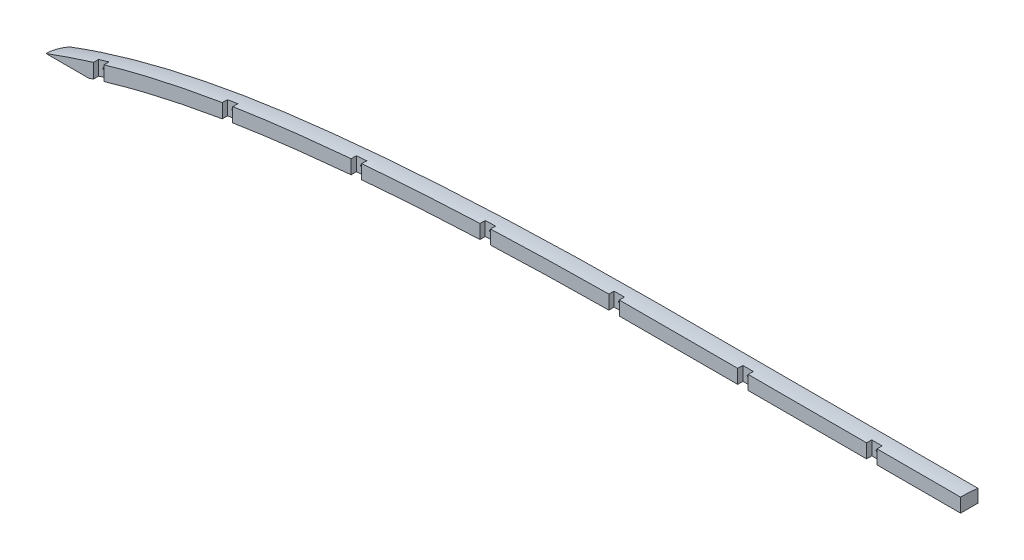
ISO-10303-21;
HEADER;
FILE_DESCRIPTION(('STEP AP214'),'2;1');
FILE_NAME('part.step','',(''),(''),'','','');
FILE_SCHEMA(('AUTOMOTIVE_DESIGN { 1 0 10303 214 1 1 1 1 }'));
ENDSEC;
DATA;
#1=APPLICATION_CONTEXT('core data for automotive mechanical design processes');
#2=APPLICATION_PROTOCOL_DEFINITION('international standard','automotive_design',2000,#1);
#3=PRODUCT_CONTEXT('',#1,'mechanical');
#4=PRODUCT('Part','Part','',(#3));
#5=PRODUCT_RELATED_PRODUCT_CATEGORY('part','',(#4));
#6=PRODUCT_DEFINITION_FORMATION('','',#4);
#7=PRODUCT_DEFINITION_CONTEXT('part definition',#1,'design');
#8=PRODUCT_DEFINITION('design','',#6,#7);
#9=PRODUCT_DEFINITION_SHAPE('','',#8);
#10=(LENGTH_UNIT() NAMED_UNIT(*) SI_UNIT(.MILLI.,.METRE.));
#11=(NAMED_UNIT(*) PLANE_ANGLE_UNIT() SI_UNIT($,.RADIAN.));
#12=(NAMED_UNIT(*) SI_UNIT($,.STERADIAN.) SOLID_ANGLE_UNIT());
#13=UNCERTAINTY_MEASURE_WITH_UNIT(LENGTH_MEASURE(1.E-05),#10,'distance_accuracy_value','');
#14=(GEOMETRIC_REPRESENTATION_CONTEXT(3) GLOBAL_UNCERTAINTY_ASSIGNED_CONTEXT((#13)) GLOBAL_UNIT_ASSIGNED_CONTEXT((#10,
#11,#12)) REPRESENTATION_CONTEXT('',''));
#15=CARTESIAN_POINT('',(0.,0.,0.));
#16=DIRECTION('',(0.,0.,1.));
#17=DIRECTION('',(1.,0.,0.));
#18=AXIS2_PLACEMENT_3D('',#15,#16,#17);
#19=CARTESIAN_POINT('',(-1096.30575446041,261.684051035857,2.4980018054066E-13));
#20=DIRECTION('',(0.,0.,-1.));
#21=DIRECTION('',(-1.,0.,0.));
#22=AXIS2_PLACEMENT_3D('',#19,#20,#21);
#23=PLANE('',#22);
#24=CARTESIAN_POINT('',(463.560601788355,234.949999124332,0.));
#25=CARTESIAN_POINT('',(447.804729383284,234.949999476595,0.));
#26=CARTESIAN_POINT('',(432.048857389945,234.949999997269,0.));
#27=CARTESIAN_POINT('',(398.067399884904,234.950000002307,0.));
#28=CARTESIAN_POINT('',(379.841791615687,234.950002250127,0.));
#29=CARTESIAN_POINT('',(352.503454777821,234.949998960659,0.));
#30=CARTESIAN_POINT('',(343.391103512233,234.949964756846,0.));
#31=CARTESIAN_POINT('',(329.721124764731,234.950002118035,0.));
#32=CARTESIAN_POINT('',(325.164668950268,234.950151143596,0.));
#33=CARTESIAN_POINT('',(316.053878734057,234.94993280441,0.));
#34=CARTESIAN_POINT('',(311.491436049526,234.949624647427,0.));
#35=CARTESIAN_POINT('',(287.165272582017,234.959512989,0.));
#36=CARTESIAN_POINT('',(267.409071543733,234.997295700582,0.));
#37=CARTESIAN_POINT('',(247.660601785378,235.046685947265,0.));
#38=B_SPLINE_CURVE_WITH_KNOTS('',3,(#24,#25,#26,#27,#28,#29,#30,#31,#32,#33,#34,#35,#36,#37),
.UNSPECIFIED.,.F.,.F.,(4,2,2,2,2,2,4),(0.0979846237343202,0.125000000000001,0.156250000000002,
0.171875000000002,0.179687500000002,0.187500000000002,0.221343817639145),.UNSPECIFIED.);
#39=CARTESIAN_POINT('',(463.560601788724,234.950074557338,0.));
#40=VERTEX_POINT('',#39);
#41=CARTESIAN_POINT('',(247.660601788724,235.046776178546,0.));
#42=VERTEX_POINT('',#41);
#43=EDGE_CURVE('E639',#40,#42,#38,.T.);
#44=ORIENTED_EDGE('',*,*,#43,.F.);
#45=DIRECTION('',(0.,-1.,0.));
#46=VECTOR('',#45,1.);
#47=CARTESIAN_POINT('',(463.560601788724,304.457522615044,0.));
#48=LINE('',#47,#46);
#49=CARTESIAN_POINT('',(463.560601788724,260.349999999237,0.));
#50=VERTEX_POINT('',#49);
#51=EDGE_CURVE('E322',#50,#40,#48,.T.);
#52=ORIENTED_EDGE('',*,*,#51,.F.);
#53=CARTESIAN_POINT('',(1492.25,0.793750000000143,-4.66136534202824E-13));
#54=CARTESIAN_POINT('',(1492.21582639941,2.14485212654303,-4.61415004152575E-13));
#55=CARTESIAN_POINT('',(1492.15078911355,4.71619414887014,-4.52429252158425E-13));
#56=CARTESIAN_POINT('',(1491.8134288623,8.75174252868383,-4.38297905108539E-13));
#57=CARTESIAN_POINT('',(1491.27507361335,12.925469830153,-4.2365949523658E-13));
#58=CARTESIAN_POINT('',(1490.40677768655,17.6656455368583,-4.07002937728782E-13));
#59=CARTESIAN_POINT('',(1489.19784787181,22.6439822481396,-3.89473131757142E-13));
#60=CARTESIAN_POINT('',(1487.61805663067,27.7630904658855,-3.71406409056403E-13));
#61=CARTESIAN_POINT('',(1485.7000462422,32.8827389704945,-3.53296381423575E-13));
#62=CARTESIAN_POINT('',(1483.25058427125,38.3646195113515,-3.3385654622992E-13));
#63=CARTESIAN_POINT('',(1480.22025005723,44.0192595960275,-3.13742390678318E-13));
#64=CARTESIAN_POINT('',(1476.79485787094,49.3799018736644,-2.94606343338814E-13));
#65=CARTESIAN_POINT('',(1467.46570449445,61.9168794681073,-2.49691291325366E-13));
#66=CARTESIAN_POINT('',(1440.70498590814,83.8406115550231,-1.69867899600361E-13));
#67=CARTESIAN_POINT('',(1399.04342763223,114.177065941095,0.));
#68=CARTESIAN_POINT('',(1347.14684056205,141.77560733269,0.));
#69=CARTESIAN_POINT('',(1296.02361845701,164.408518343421,1.29151052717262E-13));
#70=CARTESIAN_POINT('',(1245.06850637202,183.48584456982,2.01999138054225E-13));
#71=CARTESIAN_POINT('',(1177.60031716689,204.661680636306,2.84196329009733E-13));
#72=CARTESIAN_POINT('',(1092.92614512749,224.836541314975,3.65005690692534E-13));
#73=CARTESIAN_POINT('',(991.026676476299,241.848338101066,4.36880700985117E-13));
#74=CARTESIAN_POINT('',(889.176798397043,252.160122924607,4.85356685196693E-13));
#75=CARTESIAN_POINT('',(770.569527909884,259.168263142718,5.24350183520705E-13));
#76=CARTESIAN_POINT('',(682.336944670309,260.370064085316,5.39351264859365E-13));
#77=CARTESIAN_POINT('',(622.15321345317,260.348501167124,5.46646116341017E-13));
#78=CARTESIAN_POINT('',(606.614810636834,260.350515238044,5.48555991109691E-13));
#79=CARTESIAN_POINT('',(590.183466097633,260.349905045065,5.50566053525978E-13));
#80=CARTESIAN_POINT('',(574.264917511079,260.350027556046,5.52515876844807E-13));
#81=CARTESIAN_POINT('',(559.630951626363,260.349992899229,5.54307840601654E-13));
#82=CARTESIAN_POINT('',(542.301096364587,260.350002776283,5.56430100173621E-13));
#83=CARTESIAN_POINT('',(525.486068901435,260.349999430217,5.5848926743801E-13));
#84=CARTESIAN_POINT('',(508.543111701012,260.350000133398,5.6056411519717E-13));
#85=CARTESIAN_POINT('',(494.937919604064,260.349999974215,5.62230215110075E-13));
#86=CARTESIAN_POINT('',(481.71664822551,260.350000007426,5.63849300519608E-13));
#87=CARTESIAN_POINT('',(468.238709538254,260.34999999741,5.65499817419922E-13));
#88=CARTESIAN_POINT('',(454.760576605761,260.35000000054,5.67150358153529E-13));
#89=CARTESIAN_POINT('',(441.539809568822,260.349999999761,5.68769381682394E-13));
#90=CARTESIAN_POINT('',(428.575328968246,260.350000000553,5.70357020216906E-13));
#91=CARTESIAN_POINT('',(415.226602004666,260.349999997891,5.71991713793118E-13));
#92=CARTESIAN_POINT('',(401.235508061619,260.350000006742,5.73705072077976E-13));
#93=CARTESIAN_POINT('',(389.428230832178,260.349999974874,5.75150998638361E-13));
#94=CARTESIAN_POINT('',(378.51565674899,260.35000005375,5.76487359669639E-13));
#95=CARTESIAN_POINT('',(369.786879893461,260.349999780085,5.77556290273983E-13));
#96=CARTESIAN_POINT('',(360.031805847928,260.350000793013,5.78750906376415E-13));
#97=CARTESIAN_POINT('',(350.661466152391,260.349996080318,5.79898387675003E-13));
#98=CARTESIAN_POINT('',(341.037066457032,260.350010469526,5.81077048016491E-13));
#99=CARTESIAN_POINT('',(330.898025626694,260.349950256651,5.82318471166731E-13));
#100=CARTESIAN_POINT('',(321.399734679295,260.35022414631,5.83482594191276E-13));
#101=CARTESIAN_POINT('',(210.628623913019,260.34248487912,5.9702067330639E-13));
#102=CARTESIAN_POINT('',(53.4082296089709,261.683051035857,6.2095454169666E-13));
#103=CARTESIAN_POINT('',(-152.454222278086,258.183281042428,6.33945213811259E-13));
#104=CARTESIAN_POINT('',(-304.904766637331,251.81740766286,6.30388089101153E-13));
#105=CARTESIAN_POINT('',(-440.424590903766,242.866951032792,6.15733598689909E-13));
#106=CARTESIAN_POINT('',(-558.943042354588,231.266699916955,5.89745406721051E-13));
#107=CARTESIAN_POINT('',(-660.714412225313,218.924196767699,5.59114798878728E-13));
#108=CARTESIAN_POINT('',(-762.460038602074,201.879033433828,5.12061797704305E-13));
#109=CARTESIAN_POINT('',(-864.37341299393,180.000996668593,4.48155461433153E-13));
#110=CARTESIAN_POINT('',(-966.359094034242,151.355333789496,3.60628953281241E-13));
#111=CARTESIAN_POINT('',(-1050.69033612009,120.907966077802,2.64649856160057E-13));
#112=CARTESIAN_POINT('',(-1118.18156361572,92.5477985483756,1.7389593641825E-13));
#113=CARTESIAN_POINT('',(-1151.54570991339,76.1178043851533,1.20616746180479E-13));
#114=CARTESIAN_POINT('',(-1168.4,67.8180000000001,0.));
#115=B_SPLINE_CURVE_WITH_KNOTS('',3,(#53,#54,#55,#56,#57,#58,#59,#60,#61,#62,#63,#64,#65,#66,
#67,#68,#69,#70,#71,#72,#73,#74,#75,#76,#77,#78,#79,#80,#81,#82,#83,#84,#85,#86,#87,#88,#89,#90,
#91,#92,#93,#94,#95,#96,#97,#98,#99,#100,#101,#102,#103,#104,#105,#106,#107,#108,#109,#110,#111,
#112,#113,#114),.UNSPECIFIED.,.F.,.F.,(4,1,1,1,1,1,1,1,1,1,1,1,1,1,1,1,1,1,1,1,1,1,1,1,1,1,1,1,
1,1,1,1,1,1,1,1,1,1,1,1,1,1,1,1,1,1,1,1,1,1,1,1,1,1,1,1,1,1,1,4),(0.,0.00146410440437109,
0.00278640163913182,0.00438570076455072,0.00602205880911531,0.00800541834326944,
0.00993284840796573,0.0118232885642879,0.0139257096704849,0.0164340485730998,0.0187666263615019,
0.0208135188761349,0.033341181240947,0.0558426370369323,0.0767378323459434,0.0968197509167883,
0.116414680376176,0.135650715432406,0.173408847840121,0.210614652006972,0.247510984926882,
0.284271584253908,0.339322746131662,0.343083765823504,0.349481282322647,0.356158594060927,
0.360887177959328,0.36672906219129,0.372014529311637,0.379664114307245,0.384948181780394,
0.390372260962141,0.394405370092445,0.399273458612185,0.404975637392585,0.409008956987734,
0.413598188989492,0.419022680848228,0.423472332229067,0.428757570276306,0.431815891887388,
0.435296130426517,0.43821521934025,0.442385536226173,0.445448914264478,0.448643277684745,
0.453371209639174,0.455740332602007,0.568664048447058,0.623715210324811,0.678804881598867,
0.733975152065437,0.770843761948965,0.807823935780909,0.84502973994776,0.882582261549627,
0.92071299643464,0.959712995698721,0.979648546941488,1.),.UNSPECIFIED.);
#116=CARTESIAN_POINT('',(247.660601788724,260.446773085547,0.));
#117=VERTEX_POINT('',#116);
#118=EDGE_CURVE('E866',#50,#117,#115,.T.);
#119=ORIENTED_EDGE('',*,*,#118,.T.);
#120=DIRECTION('',(0.,1.,0.));
#121=VECTOR('',#120,1.);
#122=CARTESIAN_POINT('',(247.660601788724,304.457522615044,0.));
#123=LINE('',#122,#121);
#124=EDGE_CURVE('E380',#42,#117,#123,.T.);
#125=ORIENTED_EDGE('',*,*,#124,.F.);
#126=EDGE_LOOP('',(#44,#52,#119,#125));
#127=FACE_BOUND('',#126,.T.);
#128=ADVANCED_FACE('F36',(#127),#23,.F.);
#129=CARTESIAN_POINT('',(228.610601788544,235.097333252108,0.));
#130=CARTESIAN_POINT('',(218.242624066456,235.126204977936,0.));
#131=CARTESIAN_POINT('',(171.42363088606,235.263799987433,0.));
#132=CARTESIAN_POINT('',(124.648406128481,235.380281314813,0.));
#133=CARTESIAN_POINT('',(63.0611891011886,235.319587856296,0.));
#134=CARTESIAN_POINT('',(37.8801485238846,235.233549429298,0.));
#135=CARTESIAN_POINT('',(12.7106017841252,235.049950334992,0.));
#136=B_SPLINE_CURVE_WITH_KNOTS('',3,(#129,#130,#131,#132,#133,#134,#135),.UNSPECIFIED.,.F.,.F.,
(4,1,2,4),(0.232227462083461,0.250000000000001,0.312500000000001,0.35577002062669),.UNSPECIFIED.);
#137=CARTESIAN_POINT('',(228.610601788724,235.097354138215,0.));
#138=VERTEX_POINT('',#137);
#139=CARTESIAN_POINT('',(12.7106017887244,235.049919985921,0.));
#140=VERTEX_POINT('',#139);
#141=EDGE_CURVE('E616',#138,#140,#136,.T.);
#142=ORIENTED_EDGE('',*,*,#141,.F.);
#143=DIRECTION('',(0.,-1.,0.));
#144=VECTOR('',#143,1.);
#145=CARTESIAN_POINT('',(228.610601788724,304.457522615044,0.));
#146=LINE('',#145,#144);
#147=CARTESIAN_POINT('',(228.610601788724,260.497436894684,0.));
#148=VERTEX_POINT('',#147);
#149=EDGE_CURVE('E869',#148,#138,#146,.T.);
#150=ORIENTED_EDGE('',*,*,#149,.F.);
#151=CARTESIAN_POINT('',(12.7106017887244,260.451053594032,0.));
#152=VERTEX_POINT('',#151);
#153=EDGE_CURVE('E852',#148,#152,#115,.T.);
#154=ORIENTED_EDGE('',*,*,#153,.T.);
#155=DIRECTION('',(0.,1.,0.));
#156=VECTOR('',#155,1.);
#157=CARTESIAN_POINT('',(12.7106017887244,304.457522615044,0.));
#158=LINE('',#157,#156);
#159=EDGE_CURVE('E392',#140,#152,#158,.T.);
#160=ORIENTED_EDGE('',*,*,#159,.F.);
#161=EDGE_LOOP('',(#142,#150,#154,#160));
#162=FACE_BOUND('',#161,.T.);
#163=ADVANCED_FACE('F827',(#162),#23,.F.);
#164=CARTESIAN_POINT('',(-6.33939821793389,234.891757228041,0.));
#165=CARTESIAN_POINT('',(-11.1733979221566,234.846585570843,0.));
#166=CARTESIAN_POINT('',(-16.0069968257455,234.797475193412,0.));
#167=CARTESIAN_POINT('',(-57.1815201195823,234.343350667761,0.));
#168=CARTESIAN_POINT('',(-93.5034907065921,233.710158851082,0.));
#169=CARTESIAN_POINT('',(-147.947851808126,232.300633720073,0.));
#170=CARTESIAN_POINT('',(-166.088934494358,231.752766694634,0.));
#171=CARTESIAN_POINT('',(-196.900414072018,230.684486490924,0.));
#172=CARTESIAN_POINT('',(-209.570588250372,230.206077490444,0.));
#173=CARTESIAN_POINT('',(-222.239398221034,229.688815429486,0.));
#174=B_SPLINE_CURVE_WITH_KNOTS('',3,(#164,#165,#166,#167,#168,#169,#170,#171,#172,#173),
.UNSPECIFIED.,.F.,.F.,(4,2,2,2,4),(0.366687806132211,0.375,0.4375,0.46875,0.490578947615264),.UNSPECIFIED.);
#175=CARTESIAN_POINT('',(-6.3393982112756,234.891740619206,0.));
#176=VERTEX_POINT('',#175);
#177=CARTESIAN_POINT('',(-222.239398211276,229.688859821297,0.));
#178=VERTEX_POINT('',#177);
#179=EDGE_CURVE('E667',#176,#178,#174,.T.);
#180=ORIENTED_EDGE('',*,*,#179,.F.);
#181=DIRECTION('',(0.,-1.,0.));
#182=VECTOR('',#181,1.);
#183=CARTESIAN_POINT('',(-6.3393982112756,304.457522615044,0.));
#184=LINE('',#183,#182);
#185=CARTESIAN_POINT('',(-6.3393982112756,260.293045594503,0.));
#186=VERTEX_POINT('',#185);
#187=EDGE_CURVE('E388',#186,#176,#184,.T.);
#188=ORIENTED_EDGE('',*,*,#187,.F.);
#189=CARTESIAN_POINT('',(-222.239398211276,255.109891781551,0.));
#190=VERTEX_POINT('',#189);
#191=EDGE_CURVE('E850',#186,#190,#115,.T.);
#192=ORIENTED_EDGE('',*,*,#191,.T.);
#193=DIRECTION('',(0.,1.,0.));
#194=VECTOR('',#193,1.);
#195=CARTESIAN_POINT('',(-222.239398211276,304.457522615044,0.));
#196=LINE('',#195,#194);
#197=EDGE_CURVE('E440',#178,#190,#196,.T.);
#198=ORIENTED_EDGE('',*,*,#197,.F.);
#199=EDGE_LOOP('',(#180,#188,#192,#198));
#200=FACE_BOUND('',#199,.T.);
#201=ADVANCED_FACE('F832',(#200),#23,.F.);
#202=CARTESIAN_POINT('',(-241.289398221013,228.881710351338,0.));
#203=CARTESIAN_POINT('',(-258.54127595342,228.124272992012,0.));
#204=CARTESIAN_POINT('',(-275.790452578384,227.294976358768,0.));
#205=CARTESIAN_POINT('',(-311.164755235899,225.447708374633,0.));
#206=CARTESIAN_POINT('',(-329.28712723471,224.424432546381,0.));
#207=CARTESIAN_POINT('',(-383.608522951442,221.083731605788,0.));
#208=CARTESIAN_POINT('',(-419.769372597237,218.493058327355,0.));
#209=CARTESIAN_POINT('',(-456.303017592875,215.376344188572,0.));
#210=CARTESIAN_POINT('',(-456.746213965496,215.33846042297,0.));
#211=CARTESIAN_POINT('',(-457.189405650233,215.30050281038,0.));
#212=B_SPLINE_CURVE_WITH_KNOTS('',3,(#202,#203,#204,#205,#206,#207,#208,#209,#210,#211),
.UNSPECIFIED.,.F.,.F.,(4,2,2,2,4),(0.501520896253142,0.531249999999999,0.562499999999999,
0.624999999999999,0.625767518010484),.UNSPECIFIED.);
#213=CARTESIAN_POINT('',(-241.289398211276,228.881732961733,0.));
#214=VERTEX_POINT('',#213);
#215=CARTESIAN_POINT('',(-457.189398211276,215.300415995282,0.));
#216=VERTEX_POINT('',#215);
#217=EDGE_CURVE('E756',#214,#216,#212,.T.);
#218=ORIENTED_EDGE('',*,*,#217,.F.);
#219=DIRECTION('',(0.,-1.,0.));
#220=VECTOR('',#219,1.);
#221=CARTESIAN_POINT('',(-241.289398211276,304.457522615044,0.));
#222=LINE('',#221,#220);
#223=CARTESIAN_POINT('',(-241.289398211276,254.306079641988,0.));
#224=VERTEX_POINT('',#223);
#225=EDGE_CURVE('E848',#224,#214,#222,.T.);
#226=ORIENTED_EDGE('',*,*,#225,.F.);
#227=CARTESIAN_POINT('',(-457.189398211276,240.792902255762,0.));
#228=VERTEX_POINT('',#227);
#229=EDGE_CURVE('E847',#224,#228,#115,.T.);
#230=ORIENTED_EDGE('',*,*,#229,.T.);
#231=DIRECTION('',(0.,1.,0.));
#232=VECTOR('',#231,1.);
#233=CARTESIAN_POINT('',(-457.189398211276,304.457522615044,0.));
#234=LINE('',#233,#232);
#235=EDGE_CURVE('E452',#216,#228,#234,.T.);
#236=ORIENTED_EDGE('',*,*,#235,.F.);
#237=EDGE_LOOP('',(#218,#226,#230,#236));
#238=FACE_BOUND('',#237,.T.);
#239=ADVANCED_FACE('F845',(#238),#23,.F.);
#240=CARTESIAN_POINT('',(-476.239398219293,213.623457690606,0.));
#241=CARTESIAN_POINT('',(-487.4866219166,212.606604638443,0.));
#242=CARTESIAN_POINT('',(-507.747904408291,210.6899782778,0.));
#243=CARTESIAN_POINT('',(-527.99864873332,208.62601742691,0.));
#244=CARTESIAN_POINT('',(-546.019266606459,206.732008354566,0.));
#245=CARTESIAN_POINT('',(-555.029880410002,205.756762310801,0.));
#246=CARTESIAN_POINT('',(-582.034383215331,202.746635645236,0.));
#247=CARTESIAN_POINT('',(-599.997936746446,200.62308845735,0.));
#248=CARTESIAN_POINT('',(-626.869023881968,197.17997628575,0.));
#249=CARTESIAN_POINT('',(-635.813680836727,195.989314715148,0.));
#250=CARTESIAN_POINT('',(-653.675771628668,193.508401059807,0.));
#251=CARTESIAN_POINT('',(-662.591857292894,192.217383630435,0.));
#252=CARTESIAN_POINT('',(-678.385889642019,189.831818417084,0.));
#253=CARTESIAN_POINT('',(-685.265131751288,188.759982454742,0.));
#254=CARTESIAN_POINT('',(-692.139361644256,187.656151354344,0.));
#255=B_SPLINE_CURVE_WITH_KNOTS('',3,(#240,#241,#242,#243,#244,#245,#246,#247,#248,#249,#250,
#251,#252,#253,#254),.UNSPECIFIED.,.F.,.F.,(4,1,2,2,2,2,2,4),(0.636766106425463,
0.656249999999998,0.671874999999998,0.687499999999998,0.718749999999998,0.734374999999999,
0.749999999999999,0.762071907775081),.UNSPECIFIED.);
#256=CARTESIAN_POINT('',(-476.239398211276,213.623457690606,0.));
#257=VERTEX_POINT('',#256);
#258=CARTESIAN_POINT('',(-692.139398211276,187.656379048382,0.));
#259=VERTEX_POINT('',#258);
#260=EDGE_CURVE('E754',#257,#259,#255,.T.);
#261=ORIENTED_EDGE('',*,*,#260,.F.);
#262=DIRECTION('',(0.,-1.,0.));
#263=VECTOR('',#262,1.);
#264=CARTESIAN_POINT('',(-476.239398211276,304.457522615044,0.));
#265=LINE('',#264,#263);
#266=CARTESIAN_POINT('',(-476.239398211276,239.126408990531,0.));
#267=VERTEX_POINT('',#266);
#268=EDGE_CURVE('E448',#267,#257,#265,.T.);
#269=ORIENTED_EDGE('',*,*,#268,.F.);
#270=CARTESIAN_POINT('',(-692.139398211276,213.377814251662,0.));
#271=VERTEX_POINT('',#270);
#272=EDGE_CURVE('E851',#267,#271,#115,.T.);
#273=ORIENTED_EDGE('',*,*,#272,.T.);
#274=DIRECTION('',(0.,1.,0.));
#275=VECTOR('',#274,1.);
#276=CARTESIAN_POINT('',(-692.139398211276,304.457522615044,0.));
#277=LINE('',#276,#275);
#278=EDGE_CURVE('E500',#259,#271,#277,.T.);
#279=ORIENTED_EDGE('',*,*,#278,.F.);
#280=EDGE_LOOP('',(#261,#269,#273,#279));
#281=FACE_BOUND('',#280,.T.);
#282=ADVANCED_FACE('F909',(#281),#23,.F.);
#283=CARTESIAN_POINT('',(-711.189342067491,184.513136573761,0.));
#284=CARTESIAN_POINT('',(-715.749433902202,183.740631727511,0.));
#285=CARTESIAN_POINT('',(-729.187809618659,181.421390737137,0.));
#286=CARTESIAN_POINT('',(-742.605097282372,178.979863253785,0.));
#287=CARTESIAN_POINT('',(-760.318723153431,175.64645881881,0.));
#288=CARTESIAN_POINT('',(-769.164554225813,173.927395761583,0.));
#289=CARTESIAN_POINT('',(-795.649618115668,168.603682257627,0.));
#290=CARTESIAN_POINT('',(-813.241702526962,164.830737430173,0.));
#291=CARTESIAN_POINT('',(-848.266963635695,156.763334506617,0.));
#292=CARTESIAN_POINT('',(-865.698228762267,152.46701984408,0.));
#293=CARTESIAN_POINT('',(-897.792874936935,143.976034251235,0.));
#294=CARTESIAN_POINT('',(-912.477829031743,139.864804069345,0.));
#295=CARTESIAN_POINT('',(-927.089426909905,135.53361928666,0.));
#296=B_SPLINE_CURVE_WITH_KNOTS('',3,(#283,#284,#285,#286,#287,#288,#289,#290,#291,#292,#293,
#294,#295),.UNSPECIFIED.,.F.,.F.,(4,1,2,2,2,2,4),(0.773230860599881,0.781249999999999,
0.796874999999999,0.8125,0.84375,0.875,0.90156732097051),.UNSPECIFIED.);
#297=CARTESIAN_POINT('',(-711.189398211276,184.513467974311,0.));
#298=VERTEX_POINT('',#297);
#299=CARTESIAN_POINT('',(-927.089398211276,135.533522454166,0.));
#300=VERTEX_POINT('',#299);
#301=EDGE_CURVE('E751',#298,#300,#296,.T.);
#302=ORIENTED_EDGE('',*,*,#301,.F.);
#303=DIRECTION('',(0.,-1.,0.));
#304=VECTOR('',#303,1.);
#305=CARTESIAN_POINT('',(-711.189398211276,304.457522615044,0.));
#306=LINE('',#305,#304);
#307=CARTESIAN_POINT('',(-711.189398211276,210.270885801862,0.));
#308=VERTEX_POINT('',#307);
#309=EDGE_CURVE('E926',#308,#298,#306,.T.);
#310=ORIENTED_EDGE('',*,*,#309,.F.);
#311=CARTESIAN_POINT('',(-927.089398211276,162.006780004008,0.));
#312=VERTEX_POINT('',#311);
#313=EDGE_CURVE('E853',#308,#312,#115,.T.);
#314=ORIENTED_EDGE('',*,*,#313,.T.);
#315=DIRECTION('',(0.,1.,0.));
#316=VECTOR('',#315,1.);
#317=CARTESIAN_POINT('',(-927.089398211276,304.457522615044,0.));
#318=LINE('',#317,#316);
#319=EDGE_CURVE('E512',#300,#312,#318,.T.);
#320=ORIENTED_EDGE('',*,*,#319,.F.);
#321=EDGE_LOOP('',(#302,#310,#314,#320));
#322=FACE_BOUND('',#321,.T.);
#323=ADVANCED_FACE('F913',(#322),#23,.F.);
#324=CARTESIAN_POINT('',(-946.139404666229,129.748115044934,0.));
#325=CARTESIAN_POINT('',(-949.055025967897,128.841141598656,0.));
#326=CARTESIAN_POINT('',(-951.967551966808,127.925139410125,0.));
#327=CARTESIAN_POINT('',(-954.876996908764,127.000000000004,0.));
#328=B_SPLINE_CURVE_WITH_KNOTS('',3,(#324,#325,#326,#327),.UNSPECIFIED.,.F.,.F.,(4,4),
(0.913139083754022,0.918464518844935),.UNSPECIFIED.);
#329=CARTESIAN_POINT('',(-946.139398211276,129.748094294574,0.));
#330=VERTEX_POINT('',#329);
#331=CARTESIAN_POINT('',(-954.876996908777,127.,0.));
#332=VERTEX_POINT('',#331);
#333=EDGE_CURVE('E755',#330,#332,#328,.T.);
#334=ORIENTED_EDGE('',*,*,#333,.F.);
#335=DIRECTION('',(0.,-1.,0.));
#336=VECTOR('',#335,1.);
#337=CARTESIAN_POINT('',(-946.139398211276,304.457522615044,0.));
#338=LINE('',#337,#336);
#339=CARTESIAN_POINT('',(-946.139398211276,156.326867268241,0.));
#340=VERTEX_POINT('',#339);
#341=EDGE_CURVE('E508',#340,#330,#338,.T.);
#342=ORIENTED_EDGE('',*,*,#341,.F.);
#343=CARTESIAN_POINT('',(-1032.62639821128,127.000000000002,2.83707945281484E-13));
#344=VERTEX_POINT('',#343);
#345=EDGE_CURVE('E806',#340,#344,#115,.T.);
#346=ORIENTED_EDGE('',*,*,#345,.T.);
#347=DIRECTION('',(-1.,0.,0.));
#348=VECTOR('',#347,1.);
#349=CARTESIAN_POINT('',(-954.876996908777,127.,0.));
#350=LINE('',#349,#348);
#351=EDGE_CURVE('E781',#332,#344,#350,.T.);
#352=ORIENTED_EDGE('',*,*,#351,.F.);
#353=EDGE_LOOP('',(#334,#342,#346,#352));
#354=FACE_BOUND('',#353,.T.);
#355=ADVANCED_FACE('F819',(#354),#23,.F.);
#356=CARTESIAN_POINT('',(634.999999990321,261.684051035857,-31.7499999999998));
#357=DIRECTION('',(0.,0.,1.));
#358=DIRECTION('',(1.,0.,0.));
#359=AXIS2_PLACEMENT_3D('',#356,#357,#358);
#360=PLANE('',#359);
#361=CARTESIAN_POINT('',(634.98638759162,234.950003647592,-31.7499999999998));
#362=CARTESIAN_POINT('',(632.718101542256,234.951219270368,-31.7499999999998));
#363=CARTESIAN_POINT('',(630.445923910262,234.951104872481,-31.7499999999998));
#364=CARTESIAN_POINT('',(625.893740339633,234.950308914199,-31.7499999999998));
#365=CARTESIAN_POINT('',(623.612532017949,234.94976876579,-31.7499999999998));
#366=CARTESIAN_POINT('',(616.773327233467,234.949236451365,-31.7499999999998));
#367=CARTESIAN_POINT('',(612.215800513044,234.949711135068,-31.7499999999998));
#368=CARTESIAN_POINT('',(598.549116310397,234.950456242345,-31.7499999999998));
#369=CARTESIAN_POINT('',(589.436111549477,234.949951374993,-31.7499999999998));
#370=CARTESIAN_POINT('',(562.097269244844,234.950040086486,-31.7499999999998));
#371=CARTESIAN_POINT('',(543.872082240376,234.950001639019,-31.7499999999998));
#372=CARTESIAN_POINT('',(489.195318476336,234.949997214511,-31.7499999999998));
#373=CARTESIAN_POINT('',(452.744153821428,234.9499999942,-31.7499999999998));
#374=CARTESIAN_POINT('',(398.067399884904,234.950000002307,-31.7499999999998));
#375=CARTESIAN_POINT('',(379.841791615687,234.950002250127,-31.7499999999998));
#376=CARTESIAN_POINT('',(352.503454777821,234.949998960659,-31.7499999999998));
#377=CARTESIAN_POINT('',(343.391103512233,234.949964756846,-31.7499999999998));
#378=CARTESIAN_POINT('',(329.721124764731,234.950002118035,-31.7499999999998));
#379=CARTESIAN_POINT('',(325.164668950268,234.950151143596,-31.7499999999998));
#380=CARTESIAN_POINT('',(316.053878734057,234.94993280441,-31.7499999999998));
#381=CARTESIAN_POINT('',(311.491436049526,234.949624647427,-31.7499999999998));
#382=CARTESIAN_POINT('',(270.43083670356,234.966315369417,-31.7499999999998));
#383=CARTESIAN_POINT('',(197.4865553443,235.198897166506,-31.7499999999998));
#384=CARTESIAN_POINT('',(124.648406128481,235.380281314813,-31.7499999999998));
#385=CARTESIAN_POINT('',(51.8640568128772,235.308553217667,-31.7499999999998));
#386=CARTESIAN_POINT('',(15.5010947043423,235.144986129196,-31.7499999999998));
#387=CARTESIAN_POINT('',(-57.1815201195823,234.343350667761,-31.7499999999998));
#388=CARTESIAN_POINT('',(-93.5034907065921,233.710158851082,-31.7499999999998));
#389=CARTESIAN_POINT('',(-147.947851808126,232.300633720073,-31.7499999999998));
#390=CARTESIAN_POINT('',(-166.088934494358,231.752766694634,-31.7499999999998));
#391=CARTESIAN_POINT('',(-202.369184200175,230.494876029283,-31.7499999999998));
#392=CARTESIAN_POINT('',(-238.644594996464,229.076825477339,-31.7499999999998));
#393=CARTESIAN_POINT('',(-274.90817256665,227.341049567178,-31.7499999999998));
#394=CARTESIAN_POINT('',(-311.164755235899,225.447708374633,-31.7499999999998));
#395=CARTESIAN_POINT('',(-329.28712723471,224.424432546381,-31.7499999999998));
#396=CARTESIAN_POINT('',(-383.608522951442,221.083731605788,-31.7499999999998));
#397=CARTESIAN_POINT('',(-419.769372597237,218.493058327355,-31.7499999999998));
#398=CARTESIAN_POINT('',(-473.905038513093,213.874701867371,-31.7499999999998));
#399=CARTESIAN_POINT('',(-500.96123616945,211.38167717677,-31.7499999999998));
#400=CARTESIAN_POINT('',(-527.99864873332,208.62601742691,-31.7499999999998));
#401=CARTESIAN_POINT('',(-546.019266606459,206.732008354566,-31.7499999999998));
#402=CARTESIAN_POINT('',(-555.029880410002,205.756762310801,-31.7499999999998));
#403=CARTESIAN_POINT('',(-582.034383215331,202.746635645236,-31.7499999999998));
#404=CARTESIAN_POINT('',(-599.997936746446,200.62308845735,-31.7499999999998));
#405=CARTESIAN_POINT('',(-626.869023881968,197.17997628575,-31.7499999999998));
#406=CARTESIAN_POINT('',(-635.813680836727,195.989314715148,-31.7499999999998));
#407=CARTESIAN_POINT('',(-653.675771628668,193.508401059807,-31.7499999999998));
#408=CARTESIAN_POINT('',(-662.591857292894,192.217383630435,-31.7499999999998));
#409=CARTESIAN_POINT('',(-689.322107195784,188.179988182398,-31.7499999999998));
#410=CARTESIAN_POINT('',(-716.005044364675,183.820242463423,-31.7499999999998));
#411=CARTESIAN_POINT('',(-742.605097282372,178.979863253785,-31.7499999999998));
#412=CARTESIAN_POINT('',(-760.318723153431,175.64645881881,-31.7499999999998));
#413=CARTESIAN_POINT('',(-769.164554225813,173.927395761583,-31.7499999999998));
#414=CARTESIAN_POINT('',(-795.649618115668,168.603682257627,-31.7499999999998));
#415=CARTESIAN_POINT('',(-813.241702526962,164.830737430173,-31.7499999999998));
#416=CARTESIAN_POINT('',(-848.266963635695,156.763334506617,-31.7499999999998));
#417=CARTESIAN_POINT('',(-865.698228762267,152.46701984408,-31.7499999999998));
#418=CARTESIAN_POINT('',(-900.392250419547,143.28834136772,-31.7499999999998));
#419=CARTESIAN_POINT('',(-917.652536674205,138.40902597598,-31.7499999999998));
#420=CARTESIAN_POINT('',(-943.386819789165,130.629771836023,-31.7499999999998));
#421=CARTESIAN_POINT('',(-951.938109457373,127.960170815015,-31.7499999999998));
#422=CARTESIAN_POINT('',(-968.987799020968,122.46245626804,-31.7499999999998));
#423=CARTESIAN_POINT('',(-977.488585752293,119.633986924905,-31.7499999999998));
#424=CARTESIAN_POINT('',(-1002.91629389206,110.915535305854,-31.7499999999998));
#425=CARTESIAN_POINT('',(-1019.76856755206,104.792504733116,-31.7499999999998));
#426=CARTESIAN_POINT('',(-1040.70116224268,96.7696827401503,-31.7499999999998));
#427=CARTESIAN_POINT('',(-1044.8810434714,95.1466670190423,-31.7499999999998));
#428=CARTESIAN_POINT('',(-1053.22732090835,91.864218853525,-31.7499999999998));
#429=CARTESIAN_POINT('',(-1057.39589880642,90.2041893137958,-31.7499999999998));
#430=CARTESIAN_POINT('',(-1069.86155173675,85.1759499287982,-31.7499999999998));
#431=CARTESIAN_POINT('',(-1078.11772809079,81.7576918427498,-31.7499999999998));
#432=CARTESIAN_POINT('',(-1086.30695181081,78.2508255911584,-31.7499999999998));
#433=B_SPLINE_CURVE_WITH_KNOTS('',3,(#361,#362,#363,#364,#365,#366,#367,#368,#369,#370,#371,
#372,#373,#374,#375,#376,#377,#378,#379,#380,#381,#382,#383,#384,#385,#386,#387,#388,#389,#390,
#391,#392,#393,#394,#395,#396,#397,#398,#399,#400,#401,#402,#403,#404,#405,#406,#407,#408,#409,
#410,#411,#412,#413,#414,#415,#416,#417,#418,#419,#420,#421,#422,#423,#424,#425,#426,#427,#428,
#429,#430,#431,#432),.UNSPECIFIED.,.F.,.F.,(4,2,2,2,2,2,2,2,2,2,2,1,2,2,2,2,1,2,2,2,1,2,2,2,2,2,
1,2,2,2,2,2,2,2,2,2,2,4),(0.,0.00390625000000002,0.00781250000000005,0.0156250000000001,
0.0312500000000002,0.0625000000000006,0.125000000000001,0.156250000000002,0.171875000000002,
0.179687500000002,0.187500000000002,0.250000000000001,0.312500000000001,0.375,0.4375,0.46875,
0.5,0.531249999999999,0.562499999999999,0.624999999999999,0.656249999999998,0.671874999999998,
0.687499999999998,0.718749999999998,0.734374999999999,0.749999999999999,0.781249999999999,
0.796874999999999,0.8125,0.84375,0.875,0.90625,0.921875,0.9375,0.96875,0.9765625,0.984375,1.),.UNSPECIFIED.);
#434=CARTESIAN_POINT('',(634.98638759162,234.950003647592,-31.7499999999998));
#435=VERTEX_POINT('',#434);
#436=CARTESIAN_POINT('',(-954.876996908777,127.,-31.7499999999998));
#437=VERTEX_POINT('',#436);
#438=EDGE_CURVE('E788',#435,#437,#433,.T.);
#439=ORIENTED_EDGE('',*,*,#438,.T.);
#440=DIRECTION('',(-1.,0.,0.));
#441=VECTOR('',#440,1.);
#442=CARTESIAN_POINT('',(634.999999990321,127.,-31.7499999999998));
#443=LINE('',#442,#441);
#444=CARTESIAN_POINT('',(-1022.0314162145,127.,-31.7499999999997));
#445=VERTEX_POINT('',#444);
#446=EDGE_CURVE('E771',#437,#445,#443,.T.);
#447=ORIENTED_EDGE('',*,*,#446,.T.);
#448=CARTESIAN_POINT('',(-1096.30575446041,96.5116443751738,-31.7499999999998));
#449=CARTESIAN_POINT('',(-1093.74278966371,97.6670316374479,-31.7499999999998));
#450=CARTESIAN_POINT('',(-1091.17466776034,98.8109307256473,-31.7499999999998));
#451=CARTESIAN_POINT('',(-1086.02916917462,101.077529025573,-31.7499999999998));
#452=CARTESIAN_POINT('',(-1083.45179275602,102.200228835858,-31.7499999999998));
#453=CARTESIAN_POINT('',(-1078.28871066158,104.426265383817,-31.7499999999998));
#454=CARTESIAN_POINT('',(-1075.70300502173,105.529602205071,-31.7499999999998));
#455=CARTESIAN_POINT('',(-1071.81888558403,107.171379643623,-31.7499999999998));
#456=CARTESIAN_POINT('',(-1070.52326117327,107.71643046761,-31.7499999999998));
#457=CARTESIAN_POINT('',(-1067.93026422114,108.802358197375,-31.7499999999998));
#458=CARTESIAN_POINT('',(-1066.63289167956,109.343235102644,-31.7499999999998));
#459=CARTESIAN_POINT('',(-1062.73824084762,110.959818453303,-31.7499999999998));
#460=CARTESIAN_POINT('',(-1060.1384465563,112.029470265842,-31.7499999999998));
#461=CARTESIAN_POINT('',(-1054.93228546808,114.152669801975,-31.7499999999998));
#462=CARTESIAN_POINT('',(-1052.32591865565,115.206217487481,-31.7499999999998));
#463=CARTESIAN_POINT('',(-1047.10671711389,117.2973141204,-31.7499999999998));
#464=CARTESIAN_POINT('',(-1044.49388226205,118.334862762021,-31.7499999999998));
#465=CARTESIAN_POINT('',(-1039.26193621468,120.393981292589,-31.7499999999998));
#466=CARTESIAN_POINT('',(-1036.64282504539,121.415551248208,-31.7499999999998));
#467=CARTESIAN_POINT('',(-1031.39844467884,123.442744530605,-31.7499999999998));
#468=CARTESIAN_POINT('',(-1028.77317548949,124.448367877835,-31.7499999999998));
#469=CARTESIAN_POINT('',(-1022.21619723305,126.937290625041,-31.7499999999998));
#470=CARTESIAN_POINT('',(-1018.28075173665,128.410759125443,-31.7499999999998));
#471=CARTESIAN_POINT('',(-1010.39670516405,131.322081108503,-31.7499999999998));
#472=CARTESIAN_POINT('',(-1006.44810406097,132.759934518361,-31.7499999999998));
#473=CARTESIAN_POINT('',(-998.538130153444,135.599927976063,-31.7499999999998));
#474=CARTESIAN_POINT('',(-994.576757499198,137.002068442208,-31.7499999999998));
#475=CARTESIAN_POINT('',(-986.641523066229,139.770514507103,-31.7499999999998));
#476=CARTESIAN_POINT('',(-982.667661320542,141.136820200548,-31.7499999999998));
#477=CARTESIAN_POINT('',(-974.707930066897,143.833382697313,-31.7499999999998));
#478=CARTESIAN_POINT('',(-970.722061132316,145.163641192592,-31.7499999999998));
#479=CARTESIAN_POINT('',(-962.738391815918,147.787918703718,-31.7499999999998));
#480=CARTESIAN_POINT('',(-958.740591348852,149.081937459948,-31.7499999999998));
#481=CARTESIAN_POINT('',(-946.65599206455,152.934070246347,-31.7499999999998));
#482=CARTESIAN_POINT('',(-938.551643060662,155.437322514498,-31.7499999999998));
#483=CARTESIAN_POINT('',(-922.300740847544,160.30329667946,-31.7499999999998));
#484=CARTESIAN_POINT('',(-914.154186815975,162.666015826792,-31.7499999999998));
#485=CARTESIAN_POINT('',(-901.904422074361,166.108465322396,-31.7499999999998));
#486=CARTESIAN_POINT('',(-897.815476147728,167.23919501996,-31.7499999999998));
#487=CARTESIAN_POINT('',(-889.628467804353,169.467194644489,-31.7499999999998));
#488=CARTESIAN_POINT('',(-885.530405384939,170.564464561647,-31.7499999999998));
#489=CARTESIAN_POINT('',(-877.325648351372,172.726098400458,-31.7499999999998));
#490=CARTESIAN_POINT('',(-873.218953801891,173.790462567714,-31.7499999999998));
#491=CARTESIAN_POINT('',(-864.997305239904,175.886787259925,-31.7499999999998));
#492=CARTESIAN_POINT('',(-860.882351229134,176.918747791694,-31.7499999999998));
#493=CARTESIAN_POINT('',(-852.642194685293,178.951679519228,-31.7499999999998));
#494=CARTESIAN_POINT('',(-848.516987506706,179.952631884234,-31.7499999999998));
#495=CARTESIAN_POINT('',(-840.259286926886,181.923966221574,-31.7499999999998));
#496=CARTESIAN_POINT('',(-836.126793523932,182.894348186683,-31.7499999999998));
#497=CARTESIAN_POINT('',(-823.719053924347,185.76116160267,-31.7499999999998));
#498=CARTESIAN_POINT('',(-815.433515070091,187.613268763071,-31.7499999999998));
#499=CARTESIAN_POINT('',(-802.985087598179,190.309378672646,-31.7499999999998));
#500=CARTESIAN_POINT('',(-798.831064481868,191.194648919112,-31.7499999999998));
#501=CARTESIAN_POINT('',(-790.517445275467,192.938668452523,-31.7499999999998));
#502=CARTESIAN_POINT('',(-786.357849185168,193.797417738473,-31.7499999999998));
#503=CARTESIAN_POINT('',(-778.033475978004,195.489418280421,-31.7499999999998));
#504=CARTESIAN_POINT('',(-773.868698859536,196.322669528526,-31.7499999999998));
#505=CARTESIAN_POINT('',(-767.617920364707,197.554181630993,-31.7499999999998));
#506=CARTESIAN_POINT('',(-765.533724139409,197.961625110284,-31.7499999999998));
#507=CARTESIAN_POINT('',(-761.36417107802,198.770529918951,-31.7499999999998));
#508=CARTESIAN_POINT('',(-759.278814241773,199.171991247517,-31.7499999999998));
#509=CARTESIAN_POINT('',(-753.01990794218,200.367651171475,-31.7499999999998));
#510=CARTESIAN_POINT('',(-748.844645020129,201.152904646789,-31.7499999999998));
#511=CARTESIAN_POINT('',(-740.489710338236,202.699531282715,-31.7499999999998));
#512=CARTESIAN_POINT('',(-736.310038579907,203.46090445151,-31.7499999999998));
#513=CARTESIAN_POINT('',(-723.764609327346,205.709194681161,-31.7499999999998));
#514=CARTESIAN_POINT('',(-715.392389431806,207.160291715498,-31.7499999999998));
#515=CARTESIAN_POINT('',(-702.822482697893,209.265120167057,-31.7499999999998));
#516=CARTESIAN_POINT('',(-698.630761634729,209.954732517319,-31.7499999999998));
#517=CARTESIAN_POINT('',(-690.243446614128,211.310032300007,-31.7499999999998));
#518=CARTESIAN_POINT('',(-686.047852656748,211.975719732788,-31.7499999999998));
#519=CARTESIAN_POINT('',(-677.65294444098,213.283144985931,-31.7499999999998));
#520=CARTESIAN_POINT('',(-673.453630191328,213.924882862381,-31.7499999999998));
#521=CARTESIAN_POINT('',(-667.151971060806,214.869524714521,-31.7499999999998));
#522=CARTESIAN_POINT('',(-665.050969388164,215.181411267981,-31.7499999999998));
#523=CARTESIAN_POINT('',(-660.848082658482,215.799174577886,-31.7499999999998));
#524=CARTESIAN_POINT('',(-658.746197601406,216.105051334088,-31.7499999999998));
#525=CARTESIAN_POINT('',(-652.413063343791,217.017614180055,-31.7499999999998));
#526=CARTESIAN_POINT('',(-648.180515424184,217.61530995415,-31.7499999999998));
#527=CARTESIAN_POINT('',(-639.712328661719,218.788337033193,-31.7499999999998));
#528=CARTESIAN_POINT('',(-635.476689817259,219.363668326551,-31.7499999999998));
#529=CARTESIAN_POINT('',(-622.765576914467,221.058314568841,-31.7499999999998));
#530=CARTESIAN_POINT('',(-614.285905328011,222.146282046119,-31.7499999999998));
#531=CARTESIAN_POINT('',(-601.561798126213,223.724143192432,-31.7499999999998));
#532=CARTESIAN_POINT('',(-597.320665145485,224.24096615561,-31.7499999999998));
#533=CARTESIAN_POINT('',(-588.8364225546,225.258159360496,-31.7499999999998));
#534=CARTESIAN_POINT('',(-584.593312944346,225.758529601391,-31.7499999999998));
#535=CARTESIAN_POINT('',(-576.105358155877,226.744297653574,-31.7499999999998));
#536=CARTESIAN_POINT('',(-571.860512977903,227.229695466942,-31.7499999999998));
#537=CARTESIAN_POINT('',(-565.492104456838,227.947657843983,-31.7499999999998));
#538=CARTESIAN_POINT('',(-563.369111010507,228.185289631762,-31.7499999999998));
#539=CARTESIAN_POINT('',(-559.122771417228,228.657381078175,-31.7499999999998));
#540=CARTESIAN_POINT('',(-556.999425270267,228.891840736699,-31.7499999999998));
#541=CARTESIAN_POINT('',(-550.629939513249,229.590419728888,-31.7499999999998));
#542=CARTESIAN_POINT('',(-546.383285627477,230.049859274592,-31.7499999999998));
#543=CARTESIAN_POINT('',(-537.888627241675,230.956060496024,-31.7499999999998));
#544=CARTESIAN_POINT('',(-533.640622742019,231.402822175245,-31.7499999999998));
#545=CARTESIAN_POINT('',(-525.143291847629,232.283527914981,-31.7499999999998));
#546=CARTESIAN_POINT('',(-520.893965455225,232.717471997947,-31.7499999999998));
#547=CARTESIAN_POINT('',(-512.39400982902,233.572389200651,-31.7499999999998));
#548=CARTESIAN_POINT('',(-508.143380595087,233.993362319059,-31.7499999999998));
#549=CARTESIAN_POINT('',(-495.391056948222,235.236450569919,-31.7499999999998));
#550=CARTESIAN_POINT('',(-486.887431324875,236.038889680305,-31.7499999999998));
#551=CARTESIAN_POINT('',(-474.128340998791,237.202300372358,-31.7499999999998));
#552=CARTESIAN_POINT('',(-469.874699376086,237.583396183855,-31.7499999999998));
#553=CARTESIAN_POINT('',(-461.366217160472,238.331982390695,-31.7499999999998));
#554=CARTESIAN_POINT('',(-457.111376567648,238.699472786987,-31.7499999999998));
#555=CARTESIAN_POINT('',(-448.600993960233,239.420834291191,-31.7499999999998));
#556=CARTESIAN_POINT('',(-444.345452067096,239.774706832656,-31.7499999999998));
#557=CARTESIAN_POINT('',(-435.83330001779,240.469346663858,-31.7499999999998));
#558=CARTESIAN_POINT('',(-431.576689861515,240.810113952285,-31.7499999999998));
#559=CARTESIAN_POINT('',(-418.805364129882,241.813355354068,-31.7499999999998));
#560=CARTESIAN_POINT('',(-410.289144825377,242.456769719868,-31.7499999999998));
#561=CARTESIAN_POINT('',(-393.253904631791,243.696040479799,-31.7499999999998));
#562=CARTESIAN_POINT('',(-384.734884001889,244.291900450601,-31.7499999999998));
#563=CARTESIAN_POINT('',(-367.693859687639,245.439420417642,-31.7499999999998));
#564=CARTESIAN_POINT('',(-359.171856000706,245.991080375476,-31.7499999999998));
#565=CARTESIAN_POINT('',(-346.156444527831,246.802262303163,-31.7499999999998));
#566=CARTESIAN_POINT('',(-341.663950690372,247.076553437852,-31.7499999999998));
#567=CARTESIAN_POINT('',(-332.678311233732,247.614262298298,-31.7499999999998));
#568=CARTESIAN_POINT('',(-328.185165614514,247.877680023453,-31.7499999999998));
#569=CARTESIAN_POINT('',(-319.198265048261,248.394111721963,-31.7499999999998));
#570=CARTESIAN_POINT('',(-314.704510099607,248.647125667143,-31.7499999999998));
#571=CARTESIAN_POINT('',(-305.716455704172,249.143286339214,-31.7499999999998));
#572=CARTESIAN_POINT('',(-301.222156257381,249.386433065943,-31.7499999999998));
#573=CARTESIAN_POINT('',(-292.233036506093,249.863033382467,-31.7499999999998));
#574=CARTESIAN_POINT('',(-287.738216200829,250.096486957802,-31.7499999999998));
#575=CARTESIAN_POINT('',(-278.748080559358,250.553638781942,-31.7499999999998));
#576=CARTESIAN_POINT('',(-274.252765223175,250.777337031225,-31.7499999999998));
#577=CARTESIAN_POINT('',(-260.765870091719,251.433797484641,-31.7499999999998));
#578=CARTESIAN_POINT('',(-251.773572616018,251.851913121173,-31.7499999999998));
#579=CARTESIAN_POINT('',(-233.787263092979,252.648924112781,-31.7499999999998));
#580=CARTESIAN_POINT('',(-224.793251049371,253.027819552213,-31.7499999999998));
#581=CARTESIAN_POINT('',(-206.803661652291,253.746240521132,-31.7499999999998));
#582=CARTESIAN_POINT('',(-197.80808430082,254.085766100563,-31.7499999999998));
#583=CARTESIAN_POINT('',(-184.313275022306,254.565422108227,-31.7499999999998));
#584=CARTESIAN_POINT('',(-179.814565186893,254.720374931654,-31.7499999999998));
#585=CARTESIAN_POINT('',(-170.816814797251,255.020382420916,-31.7499999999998));
#586=CARTESIAN_POINT('',(-166.317774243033,255.165437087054,-31.7499999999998));
#587=CARTESIAN_POINT('',(-157.319379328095,255.445609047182,-31.7499999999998));
#588=CARTESIAN_POINT('',(-152.820024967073,255.580726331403,-31.7499999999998));
#589=CARTESIAN_POINT('',(-143.821031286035,255.841087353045,-31.7499999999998));
#590=CARTESIAN_POINT('',(-139.321391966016,255.966331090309,-31.7499999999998));
#591=CARTESIAN_POINT('',(-125.822090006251,256.327722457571,-31.7499999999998));
#592=CARTESIAN_POINT('',(-116.822040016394,256.549530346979,-31.7499999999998));
#593=CARTESIAN_POINT('',(-98.819921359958,256.957189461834,-31.7499999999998));
#594=CARTESIAN_POINT('',(-89.8178525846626,257.143035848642,-31.7499999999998));
#595=CARTESIAN_POINT('',(-71.8130855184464,257.481019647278,-31.7499999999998));
#596=CARTESIAN_POINT('',(-62.8103872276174,257.633157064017,-31.7499999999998));
#597=CARTESIAN_POINT('',(-44.8045206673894,257.905999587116,-31.7499999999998));
#598=CARTESIAN_POINT('',(-35.8013523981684,258.026704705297,-31.7499999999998));
#599=CARTESIAN_POINT('',(-17.793577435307,258.238971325,-31.7499999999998));
#600=CARTESIAN_POINT('',(-8.78897070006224,258.330529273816,-31.7499999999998));
#601=CARTESIAN_POINT('',(9.22047160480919,258.486763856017,-31.7499999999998));
#602=CARTESIAN_POINT('',(18.2253071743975,258.551440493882,-31.7499999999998));
#603=CARTESIAN_POINT('',(36.2351132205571,258.657383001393,-31.7499999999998));
#604=CARTESIAN_POINT('',(45.2400836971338,258.698648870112,-31.7499999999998));
#605=CARTESIAN_POINT('',(63.2503062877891,258.761234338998,-31.7499999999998));
#606=CARTESIAN_POINT('',(72.2555584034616,258.782553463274,-31.7499999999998));
#607=CARTESIAN_POINT('',(90.2660825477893,258.8087099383,-31.7499999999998));
#608=CARTESIAN_POINT('',(99.27135457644,258.813547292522,-31.7499999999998));
#609=CARTESIAN_POINT('',(117.281894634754,258.81020586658,-31.7499999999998));
#610=CARTESIAN_POINT('',(126.287162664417,258.802027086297,-31.7499999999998));
#611=CARTESIAN_POINT('',(144.275238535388,258.776151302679,-31.7499999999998));
#612=CARTESIAN_POINT('',(153.258046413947,258.758478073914,-31.7499999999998));
#613=CARTESIAN_POINT('',(171.223645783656,258.717068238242,-31.7499999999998));
#614=CARTESIAN_POINT('',(180.206437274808,258.693331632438,-31.7499999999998));
#615=CARTESIAN_POINT('',(198.172015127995,258.643234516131,-31.7499999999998));
#616=CARTESIAN_POINT('',(207.154801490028,258.616874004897,-31.7499999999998));
#617=CARTESIAN_POINT('',(220.628486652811,258.577946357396,-31.7499999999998));
#618=CARTESIAN_POINT('',(225.11938455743,258.565073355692,-31.7499999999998));
#619=CARTESIAN_POINT('',(234.101182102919,258.539960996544,-31.7499999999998));
#620=CARTESIAN_POINT('',(238.59208174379,258.527721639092,-31.7499999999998));
#621=CARTESIAN_POINT('',(247.573882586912,258.50430640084,-31.7499999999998));
#622=CARTESIAN_POINT('',(252.064783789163,258.493130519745,-31.7499999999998));
#623=CARTESIAN_POINT('',(261.046589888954,258.472271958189,-31.7499999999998));
#624=CARTESIAN_POINT('',(265.537494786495,258.462589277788,-31.7499999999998));
#625=CARTESIAN_POINT('',(274.519306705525,258.44514727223,-31.7499999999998));
#626=CARTESIAN_POINT('',(279.010213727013,258.437387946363,-31.7499999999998));
#627=CARTESIAN_POINT('',(287.992030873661,258.424221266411,-31.7499999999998));
#628=CARTESIAN_POINT('',(292.482940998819,258.418813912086,-31.7499999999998));
#629=CARTESIAN_POINT('',(299.219140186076,258.412792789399,-31.7499999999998));
#630=CARTESIAN_POINT('',(301.464428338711,258.41113408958,-31.7499999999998));
#631=CARTESIAN_POINT('',(305.955005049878,258.408561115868,-31.7499999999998));
#632=CARTESIAN_POINT('',(308.200293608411,258.407646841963,-31.7499999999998));
#633=CARTESIAN_POINT('',(311.568226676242,258.406891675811,-31.7499999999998));
#634=CARTESIAN_POINT('',(312.690871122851,258.406742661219,-31.7499999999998));
#635=CARTESIAN_POINT('',(314.936160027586,258.406621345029,-31.7499999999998));
#636=CARTESIAN_POINT('',(316.058804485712,258.406649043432,-31.7499999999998));
#637=CARTESIAN_POINT('',(318.304093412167,258.40672947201,-31.7499999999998));
#638=CARTESIAN_POINT('',(319.426737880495,258.406782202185,-31.7499999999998));
#639=CARTESIAN_POINT('',(321.672026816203,258.406844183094,-31.7499999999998));
#640=CARTESIAN_POINT('',(322.794671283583,258.406853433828,-31.7499999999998));
#641=CARTESIAN_POINT('',(326.162605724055,258.406852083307,-31.7499999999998));
#642=CARTESIAN_POINT('',(328.407895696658,258.406812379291,-31.7499999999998));
#643=CARTESIAN_POINT('',(332.898475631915,258.406766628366,-31.7499999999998));
#644=CARTESIAN_POINT('',(335.143765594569,258.406760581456,-31.7499999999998));
#645=CARTESIAN_POINT('',(339.63434542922,258.406763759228,-31.7499999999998));
#646=CARTESIAN_POINT('',(341.879635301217,258.406772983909,-31.7499999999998));
#647=CARTESIAN_POINT('',(346.370215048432,258.406778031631,-31.7499999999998));
#648=CARTESIAN_POINT('',(348.615504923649,258.40677385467,-31.7499999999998));
#649=CARTESIAN_POINT('',(355.351375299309,258.406767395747,-31.7499999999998));
#650=CARTESIAN_POINT('',(359.841955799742,258.406771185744,-31.7499999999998));
#651=CARTESIAN_POINT('',(368.823116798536,258.406773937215,-31.7499999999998));
#652=CARTESIAN_POINT('',(373.313697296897,258.406772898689,-31.7499999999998));
#653=CARTESIAN_POINT('',(386.785102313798,258.406771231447,-31.7499999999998));
#654=CARTESIAN_POINT('',(395.765926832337,258.406772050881,-31.7499999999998));
#655=CARTESIAN_POINT('',(413.727574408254,258.406772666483,-31.7499999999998));
#656=CARTESIAN_POINT('',(422.708397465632,258.406772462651,-31.7499999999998));
#657=CARTESIAN_POINT('',(440.67004319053,258.406772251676,-31.7499999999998));
#658=CARTESIAN_POINT('',(449.650865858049,258.406772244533,-31.7499999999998));
#659=CARTESIAN_POINT('',(467.612503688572,258.4067724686,-31.7499999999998));
#660=CARTESIAN_POINT('',(476.593318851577,258.40677269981,-31.7499999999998));
#661=CARTESIAN_POINT('',(494.554949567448,258.406772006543,-31.7499999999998));
#662=CARTESIAN_POINT('',(503.535765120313,258.406771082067,-31.7499999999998));
#663=CARTESIAN_POINT('',(521.497396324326,258.406773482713,-31.7499999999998));
#664=CARTESIAN_POINT('',(530.478211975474,258.406776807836,-31.7499999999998));
#665=CARTESIAN_POINT('',(543.949595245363,258.406771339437,-31.7499999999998));
#666=CARTESIAN_POINT('',(548.440162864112,258.4067677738,-31.7499999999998));
#667=CARTESIAN_POINT('',(557.421298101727,258.406772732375,-31.7499999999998));
#668=CARTESIAN_POINT('',(561.911865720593,258.406781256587,-31.7499999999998));
#669=CARTESIAN_POINT('',(570.893000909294,258.406778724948,-31.7499999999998));
#670=CARTESIAN_POINT('',(575.383568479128,258.406767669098,-31.7499999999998));
#671=CARTESIAN_POINT('',(582.119419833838,258.406748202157,-31.7499999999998));
#672=CARTESIAN_POINT('',(584.364703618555,258.406741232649,-31.7499999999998));
#673=CARTESIAN_POINT('',(588.855271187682,258.406773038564,-31.7499999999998));
#674=CARTESIAN_POINT('',(591.100554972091,258.406811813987,-31.7499999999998));
#675=CARTESIAN_POINT('',(597.836406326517,258.40692224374,-31.7499999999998));
#676=CARTESIAN_POINT('',(602.326973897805,258.406988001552,-31.7499999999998));
#677=CARTESIAN_POINT('',(611.308109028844,258.406562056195,-31.7499999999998));
#678=CARTESIAN_POINT('',(615.798676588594,258.406070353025,-31.7499999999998));
#679=CARTESIAN_POINT('',(621.515102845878,258.406353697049,-31.7499999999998));
#680=CARTESIAN_POINT('',(622.740961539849,258.406467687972,-31.7499999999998));
#681=CARTESIAN_POINT('',(625.192680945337,258.406868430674,-31.7499999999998));
#682=CARTESIAN_POINT('',(626.418541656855,258.407155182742,-31.7499999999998));
#683=CARTESIAN_POINT('',(628.87033634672,258.407620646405,-31.7499999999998));
#684=CARTESIAN_POINT('',(630.09627032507,258.407799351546,-31.7499999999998));
#685=CARTESIAN_POINT('',(632.548136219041,258.407707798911,-31.7499999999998));
#686=CARTESIAN_POINT('',(633.774068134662,258.407437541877,-31.7499999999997));
#687=CARTESIAN_POINT('',(634.999999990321,258.406772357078,-31.7499999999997));
#688=B_SPLINE_CURVE_WITH_KNOTS('',3,(#448,#449,#450,#451,#452,#453,#454,#455,#456,#457,#458,
#459,#460,#461,#462,#463,#464,#465,#466,#467,#468,#469,#470,#471,#472,#473,#474,#475,#476,#477,
#478,#479,#480,#481,#482,#483,#484,#485,#486,#487,#488,#489,#490,#491,#492,#493,#494,#495,#496,
#497,#498,#499,#500,#501,#502,#503,#504,#505,#506,#507,#508,#509,#510,#511,#512,#513,#514,#515,
#516,#517,#518,#519,#520,#521,#522,#523,#524,#525,#526,#527,#528,#529,#530,#531,#532,#533,#534,
#535,#536,#537,#538,#539,#540,#541,#542,#543,#544,#545,#546,#547,#548,#549,#550,#551,#552,#553,
#554,#555,#556,#557,#558,#559,#560,#561,#562,#563,#564,#565,#566,#567,#568,#569,#570,#571,#572,
#573,#574,#575,#576,#577,#578,#579,#580,#581,#582,#583,#584,#585,#586,#587,#588,#589,#590,#591,
#592,#593,#594,#595,#596,#597,#598,#599,#600,#601,#602,#603,#604,#605,#606,#607,#608,#609,#610,
#611,#612,#613,#614,#615,#616,#617,#618,#619,#620,#621,#622,#623,#624,#625,#626,#627,#628,#629,
#630,#631,#632,#633,#634,#635,#636,#637,#638,#639,#640,#641,#642,#643,#644,#645,#646,#647,#648,
#649,#650,#651,#652,#653,#654,#655,#656,#657,#658,#659,#660,#661,#662,#663,#664,#665,#666,#667,
#668,#669,#670,#671,#672,#673,#674,#675,#676,#677,#678,#679,#680,#681,#682,#683,#684,#685,#686,
#687),.UNSPECIFIED.,.F.,.F.,(4,2,2,2,2,2,2,2,2,2,2,2,2,2,2,2,2,2,2,2,2,2,2,2,2,2,2,2,2,2,2,2,2,
2,2,2,2,2,2,2,2,2,2,2,2,2,2,2,2,2,2,2,2,2,2,2,2,2,2,2,2,2,2,2,2,2,2,2,2,2,2,2,2,2,2,2,2,2,2,2,2,
2,2,2,2,2,2,2,2,2,2,2,2,2,2,2,2,2,2,2,2,2,2,2,2,2,2,2,2,2,2,2,2,2,2,2,2,2,2,4),(0.,
8.43400276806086,16.8677670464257,25.3014949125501,29.51830104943,33.7351077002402,
42.1687770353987,50.602466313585,59.0363165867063,67.4701316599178,75.9039359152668,
88.5104804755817,101.117050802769,113.723473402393,126.329862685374,138.935659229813,
151.541546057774,176.986551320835,202.432054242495,215.159160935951,227.886271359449,
240.613286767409,253.340299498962,266.074895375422,278.809494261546,304.278589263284,
317.020446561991,329.76230433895,342.504166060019,348.875104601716,355.246044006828,
367.991354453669,380.736660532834,406.227124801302,418.971280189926,431.715435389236,
444.459560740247,450.831627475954,457.203694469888,470.027245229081,482.850802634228,
508.497913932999,521.315413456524,534.132913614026,546.950411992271,553.359164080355,
559.767916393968,572.582199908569,585.396479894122,598.21073743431,611.024996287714,
636.649004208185,649.461025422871,662.273045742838,675.083713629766,687.894382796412,
713.51569564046,739.135079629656,764.754485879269,778.257053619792,791.759622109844,
805.26222716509,818.764832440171,832.267457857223,845.770082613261,872.776027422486,
899.781914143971,926.787766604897,940.291890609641,953.796014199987,967.300151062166,
980.804288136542,1007.81255222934,1034.82444777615,1061.83633938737,1088.84822084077,
1115.86339347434,1142.87856160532,1169.89373080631,1196.90954452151,1223.92535254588,
1250.94116081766,1277.88963334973,1304.83810097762,1331.7865761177,1345.25932516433,
1358.73207404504,1372.20481919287,1385.67756487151,1399.15030556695,1412.62304487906,
1419.35891107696,1426.09477715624,1429.46271050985,1432.83064387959,1436.19857728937,
1439.56651069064,1446.30238060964,1453.03825049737,1459.77412011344,1466.50998973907,
1479.98173124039,1493.45347273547,1520.39594629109,1547.33841546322,1574.28088346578,
1601.22332895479,1628.16577561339,1655.10822256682,1668.57992542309,1682.05162827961,
1695.52333098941,1702.25918234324,1708.99503369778,1722.46673640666,1735.93843910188,
1739.61601518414,1743.29359743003,1746.97139934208,1750.64919517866),.UNSPECIFIED.);
#689=CARTESIAN_POINT('',(634.999999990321,258.406772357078,-31.7499999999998));
#690=VERTEX_POINT('',#689);
#691=EDGE_CURVE('E807',#445,#690,#688,.T.);
#692=ORIENTED_EDGE('',*,*,#691,.T.);
#693=DIRECTION('',(0.,-1.,0.));
#694=VECTOR('',#693,1.);
#695=CARTESIAN_POINT('',(634.999999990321,261.684051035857,-31.7499999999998));
#696=LINE('',#695,#694);
#697=CARTESIAN_POINT('',(634.999999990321,234.950003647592,-31.7499999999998));
#698=VERTEX_POINT('',#697);
#699=EDGE_CURVE('E792',#690,#698,#696,.T.);
#700=ORIENTED_EDGE('',*,*,#699,.T.);
#701=DIRECTION('',(-1.,0.,0.));
#702=VECTOR('',#701,1.);
#703=CARTESIAN_POINT('',(634.99999999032,234.950003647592,-31.7499999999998));
#704=LINE('',#703,#702);
#705=EDGE_CURVE('E785',#698,#435,#704,.T.);
#706=ORIENTED_EDGE('',*,*,#705,.T.);
#707=EDGE_LOOP('',(#439,#447,#692,#700,#706));
#708=FACE_BOUND('',#707,.T.);
#709=ADVANCED_FACE('F815',(#708),#360,.F.);
#710=CARTESIAN_POINT('',(634.999999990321,261.684051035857,2.48065457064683E-13));
#711=DIRECTION('',(-1.,0.,0.));
#712=DIRECTION('',(0.,0.,1.));
#713=AXIS2_PLACEMENT_3D('',#710,#711,#712);
#714=PLANE('',#713);
#715=DIRECTION('',(0.,-1.,0.));
#716=VECTOR('',#715,1.);
#717=CARTESIAN_POINT('',(634.999999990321,261.684051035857,2.48065457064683E-13));
#718=LINE('',#717,#716);
#719=CARTESIAN_POINT('',(634.999999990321,260.350000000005,5.45078123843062E-13));
#720=VERTEX_POINT('',#719);
#721=CARTESIAN_POINT('',(634.999999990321,234.950003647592,0.));
#722=VERTEX_POINT('',#721);
#723=EDGE_CURVE('E810',#720,#722,#718,.T.);
#724=ORIENTED_EDGE('',*,*,#723,.T.);
#725=DIRECTION('',(0.,0.,-1.));
#726=VECTOR('',#725,1.);
#727=CARTESIAN_POINT('',(634.999999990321,234.950003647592,2.48065457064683E-13));
#728=LINE('',#727,#726);
#729=EDGE_CURVE('E782',#722,#698,#728,.T.);
#730=ORIENTED_EDGE('',*,*,#729,.T.);
#731=ORIENTED_EDGE('',*,*,#699,.F.);
#732=CARTESIAN_POINT('',(634.999999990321,0.,-2.20845509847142E-13));
#733=DIRECTION('',(-1.,0.,0.));
#734=DIRECTION('',(0.,0.,1.));
#735=AXIS2_PLACEMENT_3D('',#732,#733,#734);
#736=CIRCLE('',#735,260.350000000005);
#737=EDGE_CURVE('E800',#690,#720,#736,.F.);
#738=ORIENTED_EDGE('',*,*,#737,.T.);
#739=EDGE_LOOP('',(#724,#730,#731,#738));
#740=FACE_BOUND('',#739,.T.);
#741=ADVANCED_FACE('F818',(#740),#714,.F.);
#742=CARTESIAN_POINT('',(482.610601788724,260.34999999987,0.));
#743=VERTEX_POINT('',#742);
#744=EDGE_CURVE('E562',#720,#743,#115,.T.);
#745=ORIENTED_EDGE('',*,*,#744,.T.);
#746=DIRECTION('',(0.,1.,0.));
#747=VECTOR('',#746,1.);
#748=CARTESIAN_POINT('',(482.610601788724,304.457522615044,0.));
#749=LINE('',#748,#747);
#750=CARTESIAN_POINT('',(482.610601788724,234.950119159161,0.));
#751=VERTEX_POINT('',#750);
#752=EDGE_CURVE('E325',#751,#743,#749,.T.);
#753=ORIENTED_EDGE('',*,*,#752,.F.);
#754=CARTESIAN_POINT('',(634.98638759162,234.950003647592,0.));
#755=CARTESIAN_POINT('',(632.718101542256,234.951219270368,0.));
#756=CARTESIAN_POINT('',(630.445923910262,234.951104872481,0.));
#757=CARTESIAN_POINT('',(625.893740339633,234.950308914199,0.));
#758=CARTESIAN_POINT('',(623.612532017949,234.94976876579,0.));
#759=CARTESIAN_POINT('',(616.773327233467,234.949236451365,0.));
#760=CARTESIAN_POINT('',(612.215800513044,234.949711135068,0.));
#761=CARTESIAN_POINT('',(598.549116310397,234.950456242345,0.));
#762=CARTESIAN_POINT('',(589.436111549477,234.949951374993,0.));
#763=CARTESIAN_POINT('',(562.097269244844,234.950040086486,0.));
#764=CARTESIAN_POINT('',(543.872082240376,234.950001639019,0.));
#765=CARTESIAN_POINT('',(511.301195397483,234.949999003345,0.));
#766=CARTESIAN_POINT('',(496.955898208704,234.949998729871,0.));
#767=CARTESIAN_POINT('',(482.61060178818,234.949998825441,0.));
#768=B_SPLINE_CURVE_WITH_KNOTS('',3,(#754,#755,#756,#757,#758,#759,#760,#761,#762,#763,#764,
#765,#766,#767),.UNSPECIFIED.,.F.,.F.,(4,2,2,2,2,2,4),(0.,0.00390625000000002,
0.00781250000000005,0.0156250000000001,0.0312500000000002,0.0625000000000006,
0.0870967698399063),.UNSPECIFIED.);
#769=CARTESIAN_POINT('',(634.98638759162,234.950003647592,0.));
#770=VERTEX_POINT('',#769);
#771=EDGE_CURVE('E572',#770,#751,#768,.T.);
#772=ORIENTED_EDGE('',*,*,#771,.F.);
#773=DIRECTION('',(-1.,0.,0.));
#774=VECTOR('',#773,1.);
#775=CARTESIAN_POINT('',(710.653329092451,234.95000364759,0.));
#776=LINE('',#775,#774);
#777=EDGE_CURVE('E757',#722,#770,#776,.T.);
#778=ORIENTED_EDGE('',*,*,#777,.F.);
#779=ORIENTED_EDGE('',*,*,#723,.F.);
#780=EDGE_LOOP('',(#745,#753,#772,#778,#779));
#781=FACE_BOUND('',#780,.T.);
#782=ADVANCED_FACE('F38',(#781),#23,.F.);
#783=CARTESIAN_POINT('',(1492.25,0.793750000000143,-4.66136534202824E-13));
#784=CARTESIAN_POINT('',(1492.21582639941,2.14485212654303,-4.61415004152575E-13));
#785=CARTESIAN_POINT('',(1492.15078911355,4.71619414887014,-4.52429252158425E-13));
#786=CARTESIAN_POINT('',(1491.8134288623,8.75174252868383,-4.38297905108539E-13));
#787=CARTESIAN_POINT('',(1491.27507361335,12.925469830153,-4.2365949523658E-13));
#788=CARTESIAN_POINT('',(1490.40677768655,17.6656455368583,-4.07002937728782E-13));
#789=CARTESIAN_POINT('',(1489.19784787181,22.6439822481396,-3.89473131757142E-13));
#790=CARTESIAN_POINT('',(1487.61805663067,27.7630904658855,-3.71406409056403E-13));
#791=CARTESIAN_POINT('',(1485.7000462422,32.8827389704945,-3.53296381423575E-13));
#792=CARTESIAN_POINT('',(1483.25058427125,38.3646195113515,-3.3385654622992E-13));
#793=CARTESIAN_POINT('',(1480.22025005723,44.0192595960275,-3.13742390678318E-13));
#794=CARTESIAN_POINT('',(1476.79485787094,49.3799018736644,-2.94606343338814E-13));
#795=CARTESIAN_POINT('',(1467.46570449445,61.9168794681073,-2.49691291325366E-13));
#796=CARTESIAN_POINT('',(1440.70498590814,83.8406115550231,-1.69867899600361E-13));
#797=CARTESIAN_POINT('',(1399.04342763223,114.177065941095,0.));
#798=CARTESIAN_POINT('',(1347.14684056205,141.77560733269,0.));
#799=CARTESIAN_POINT('',(1296.02361845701,164.408518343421,1.29151052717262E-13));
#800=CARTESIAN_POINT('',(1245.06850637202,183.48584456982,2.01999138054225E-13));
#801=CARTESIAN_POINT('',(1177.60031716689,204.661680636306,2.84196329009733E-13));
#802=CARTESIAN_POINT('',(1092.92614512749,224.836541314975,3.65005690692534E-13));
#803=CARTESIAN_POINT('',(991.026676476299,241.848338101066,4.36880700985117E-13));
#804=CARTESIAN_POINT('',(889.176798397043,252.160122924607,4.85356685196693E-13));
#805=CARTESIAN_POINT('',(770.569527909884,259.168263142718,5.24350183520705E-13));
#806=CARTESIAN_POINT('',(682.336944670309,260.370064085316,5.39351264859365E-13));
#807=CARTESIAN_POINT('',(622.15321345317,260.348501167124,5.46646116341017E-13));
#808=CARTESIAN_POINT('',(606.614810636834,260.350515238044,5.48555991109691E-13));
#809=CARTESIAN_POINT('',(590.183466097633,260.349905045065,5.50566053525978E-13));
#810=CARTESIAN_POINT('',(574.264917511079,260.350027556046,5.52515876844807E-13));
#811=CARTESIAN_POINT('',(559.630951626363,260.349992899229,5.54307840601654E-13));
#812=CARTESIAN_POINT('',(542.301096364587,260.350002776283,5.56430100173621E-13));
#813=CARTESIAN_POINT('',(525.486068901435,260.349999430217,5.5848926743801E-13));
#814=CARTESIAN_POINT('',(508.543111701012,260.350000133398,5.6056411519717E-13));
#815=CARTESIAN_POINT('',(494.937919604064,260.349999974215,5.62230215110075E-13));
#816=CARTESIAN_POINT('',(481.71664822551,260.350000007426,5.63849300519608E-13));
#817=CARTESIAN_POINT('',(468.238709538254,260.34999999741,5.65499817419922E-13));
#818=CARTESIAN_POINT('',(454.760576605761,260.35000000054,5.67150358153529E-13));
#819=CARTESIAN_POINT('',(441.539809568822,260.349999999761,5.68769381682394E-13));
#820=CARTESIAN_POINT('',(428.575328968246,260.350000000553,5.70357020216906E-13));
#821=CARTESIAN_POINT('',(415.226602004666,260.349999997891,5.71991713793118E-13));
#822=CARTESIAN_POINT('',(401.235508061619,260.350000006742,5.73705072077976E-13));
#823=CARTESIAN_POINT('',(389.428230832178,260.349999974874,5.75150998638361E-13));
#824=CARTESIAN_POINT('',(378.51565674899,260.35000005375,5.76487359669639E-13));
#825=CARTESIAN_POINT('',(369.786879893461,260.349999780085,5.77556290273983E-13));
#826=CARTESIAN_POINT('',(360.031805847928,260.350000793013,5.78750906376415E-13));
#827=CARTESIAN_POINT('',(350.661466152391,260.349996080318,5.79898387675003E-13));
#828=CARTESIAN_POINT('',(341.037066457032,260.350010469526,5.81077048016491E-13));
#829=CARTESIAN_POINT('',(330.898025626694,260.349950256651,5.82318471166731E-13));
#830=CARTESIAN_POINT('',(321.399734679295,260.35022414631,5.83482594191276E-13));
#831=CARTESIAN_POINT('',(210.628623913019,260.34248487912,5.9702067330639E-13));
#832=CARTESIAN_POINT('',(53.4082296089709,261.683051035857,6.2095454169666E-13));
#833=CARTESIAN_POINT('',(-152.454222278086,258.183281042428,6.33945213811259E-13));
#834=CARTESIAN_POINT('',(-304.904766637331,251.81740766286,6.30388089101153E-13));
#835=CARTESIAN_POINT('',(-440.424590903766,242.866951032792,6.15733598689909E-13));
#836=CARTESIAN_POINT('',(-558.943042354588,231.266699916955,5.89745406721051E-13));
#837=CARTESIAN_POINT('',(-660.714412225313,218.924196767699,5.59114798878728E-13));
#838=CARTESIAN_POINT('',(-762.460038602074,201.879033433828,5.12061797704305E-13));
#839=CARTESIAN_POINT('',(-864.37341299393,180.000996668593,4.48155461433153E-13));
#840=CARTESIAN_POINT('',(-966.359094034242,151.355333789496,3.60628953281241E-13));
#841=CARTESIAN_POINT('',(-1050.69033612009,120.907966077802,2.64649856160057E-13));
#842=CARTESIAN_POINT('',(-1118.18156361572,92.5477985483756,1.7389593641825E-13));
#843=CARTESIAN_POINT('',(-1151.54570991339,76.1178043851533,1.20616746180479E-13));
#844=CARTESIAN_POINT('',(-1168.4,67.8180000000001,0.));
#845=B_SPLINE_CURVE_WITH_KNOTS('',3,(#783,#784,#785,#786,#787,#788,#789,#790,#791,#792,#793,
#794,#795,#796,#797,#798,#799,#800,#801,#802,#803,#804,#805,#806,#807,#808,#809,#810,#811,#812,
#813,#814,#815,#816,#817,#818,#819,#820,#821,#822,#823,#824,#825,#826,#827,#828,#829,#830,#831,
#832,#833,#834,#835,#836,#837,#838,#839,#840,#841,#842,#843,#844),.UNSPECIFIED.,.F.,.F.,(4,1,1,
1,1,1,1,1,1,1,1,1,1,1,1,1,1,1,1,1,1,1,1,1,1,1,1,1,1,1,1,1,1,1,1,1,1,1,1,1,1,1,1,1,1,1,1,1,1,1,1,
1,1,1,1,1,1,1,1,4),(0.,0.00146410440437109,0.00278640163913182,0.00438570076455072,
0.00602205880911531,0.00800541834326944,0.00993284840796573,0.0118232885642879,
0.0139257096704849,0.0164340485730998,0.0187666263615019,0.0208135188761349,0.033341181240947,
0.0558426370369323,0.0767378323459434,0.0968197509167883,0.116414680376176,0.135650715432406,
0.173408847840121,0.210614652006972,0.247510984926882,0.284271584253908,0.339322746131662,
0.343083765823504,0.349481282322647,0.356158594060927,0.360887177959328,0.36672906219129,
0.372014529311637,0.379664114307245,0.384948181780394,0.390372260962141,0.394405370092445,
0.399273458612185,0.404975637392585,0.409008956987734,0.413598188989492,0.419022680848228,
0.423472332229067,0.428757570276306,0.431815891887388,0.435296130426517,0.43821521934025,
0.442385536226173,0.445448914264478,0.448643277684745,0.453371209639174,0.455740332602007,
0.568664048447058,0.623715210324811,0.678804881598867,0.733975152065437,0.770843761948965,
0.807823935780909,0.84502973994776,0.882582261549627,0.92071299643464,0.959712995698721,
0.979648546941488,1.),.UNSPECIFIED.);
#846=CARTESIAN_POINT('',(-1168.4,0.,0.));
#847=DIRECTION('',(-1.,0.,0.));
#848=AXIS1_PLACEMENT('',#846,#847);
#849=SURFACE_OF_REVOLUTION('',#845,#848);
#850=ORIENTED_EDGE('',*,*,#118,.F.);
#851=CARTESIAN_POINT('',(463.560601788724,0.,-1.99850932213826E-13));
#852=DIRECTION('',(-1.,0.,0.));
#853=DIRECTION('',(0.,0.,1.));
#854=AXIS2_PLACEMENT_3D('',#851,#852,#853);
#855=CIRCLE('',#854,260.349999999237);
#856=CARTESIAN_POINT('',(463.560601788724,260.17570385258,-9.525));
#857=VERTEX_POINT('',#856);
#858=EDGE_CURVE('E941',#50,#857,#855,.T.);
#859=ORIENTED_EDGE('',*,*,#858,.T.);
#860=CARTESIAN_POINT('',(482.610601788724,260.175703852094,-9.525));
#861=CARTESIAN_POINT('',(476.260601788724,260.175703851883,-9.525));
#862=CARTESIAN_POINT('',(469.910601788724,260.175703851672,-9.525));
#863=CARTESIAN_POINT('',(463.560601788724,260.17570385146,-9.525));
#864=B_SPLINE_CURVE_WITH_KNOTS('',3,(#860,#861,#862,#863),.UNSPECIFIED.,.F.,.F.,(4,4),(0.,
19.05),.UNSPECIFIED.);
#865=CARTESIAN_POINT('',(482.610601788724,260.17570385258,-9.525));
#866=VERTEX_POINT('',#865);
#867=EDGE_CURVE('E328',#866,#857,#864,.T.);
#868=ORIENTED_EDGE('',*,*,#867,.F.);
#869=CARTESIAN_POINT('',(482.610601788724,0.,-2.02183807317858E-13));
#870=DIRECTION('',(-1.,0.,0.));
#871=DIRECTION('',(0.,0.,1.));
#872=AXIS2_PLACEMENT_3D('',#869,#870,#871);
#873=CIRCLE('',#872,260.34999999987);
#874=EDGE_CURVE('E341',#866,#743,#873,.F.);
#875=ORIENTED_EDGE('',*,*,#874,.T.);
#876=ORIENTED_EDGE('',*,*,#744,.F.);
#877=ORIENTED_EDGE('',*,*,#737,.F.);
#878=ORIENTED_EDGE('',*,*,#691,.F.);
#879=CARTESIAN_POINT('',(-1014.09136585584,127.000000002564,-42.048493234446));
#880=CARTESIAN_POINT('',(-1014.69583342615,127.000000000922,-41.358997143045));
#881=CARTESIAN_POINT('',(-1015.29210249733,127.000000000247,-40.6622558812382));
#882=CARTESIAN_POINT('',(-1016.46761678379,126.999999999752,-39.2525827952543));
#883=CARTESIAN_POINT('',(-1017.04683175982,126.999999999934,-38.5396257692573));
#884=CARTESIAN_POINT('',(-1018.18608413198,127.000000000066,-37.0974825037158));
#885=CARTESIAN_POINT('',(-1018.74610380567,127.000000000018,-36.3682822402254));
#886=CARTESIAN_POINT('',(-1019.84472615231,126.999999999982,-34.8935873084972));
#887=CARTESIAN_POINT('',(-1020.38332281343,126.999999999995,-34.1480881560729));
#888=CARTESIAN_POINT('',(-1021.44496065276,127.000000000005,-32.6290519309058));
#889=CARTESIAN_POINT('',(-1021.96763853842,127.000000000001,-31.8552605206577));
#890=CARTESIAN_POINT('',(-1022.98613960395,126.999999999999,-30.2906005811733));
#891=CARTESIAN_POINT('',(-1023.48197312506,127.,-29.4997387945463));
#892=CARTESIAN_POINT('',(-1024.44428484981,127.,-27.9007357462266));
#893=CARTESIAN_POINT('',(-1024.9107743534,127.,-27.0926012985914));
#894=CARTESIAN_POINT('',(-1025.81181807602,127.,-25.4588141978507));
#895=CARTESIAN_POINT('',(-1026.24637601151,127.,-24.6331635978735));
#896=CARTESIAN_POINT('',(-1027.11269656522,127.,-22.9004441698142));
#897=CARTESIAN_POINT('',(-1027.54169075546,127.,-21.9919861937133));
#898=CARTESIAN_POINT('',(-1028.35557242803,127.,-20.1553757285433));
#899=CARTESIAN_POINT('',(-1028.74045599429,127.,-19.2272214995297));
#900=CARTESIAN_POINT('',(-1029.4622194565,127.,-17.3521991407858));
#901=CARTESIAN_POINT('',(-1029.79909146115,127.,-16.4053279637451));
#902=CARTESIAN_POINT('',(-1030.41871240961,127.,-14.5012681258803));
#903=CARTESIAN_POINT('',(-1030.70182185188,127.,-13.5441972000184));
#904=CARTESIAN_POINT('',(-1031.21317751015,127.,-11.6156232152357));
#905=CARTESIAN_POINT('',(-1031.4414313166,127.,-10.6441221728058));
#906=CARTESIAN_POINT('',(-1031.83983592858,127.,-8.68974561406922));
#907=CARTESIAN_POINT('',(-1032.01002135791,127.,-7.70687723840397));
#908=CARTESIAN_POINT('',(-1032.20246842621,127.,-6.34950113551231));
#909=CARTESIAN_POINT('',(-1032.25072011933,127.,-5.97854427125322));
#910=CARTESIAN_POINT('',(-1032.33860837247,127.,-5.23566472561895));
#911=CARTESIAN_POINT('',(-1032.37824643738,127.,-4.86374222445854));
#912=CARTESIAN_POINT('',(-1032.4488216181,127.,-4.11911058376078));
#913=CARTESIAN_POINT('',(-1032.47975955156,127.,-3.74640152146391));
#914=CARTESIAN_POINT('',(-1032.53295066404,127.,-2.99923972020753));
#915=CARTESIAN_POINT('',(-1032.55517752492,127.,-2.62478510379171));
#916=CARTESIAN_POINT('',(-1032.59076332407,127.,-1.87541900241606));
#917=CARTESIAN_POINT('',(-1032.60412141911,127.,-1.50050747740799));
#918=CARTESIAN_POINT('',(-1032.62194159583,127.,-0.750397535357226));
#919=CARTESIAN_POINT('',(-1032.62640188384,127.,-0.375199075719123));
#920=CARTESIAN_POINT('',(-1032.62639821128,127.,-1.0482745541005E-09));
#921=B_SPLINE_CURVE_WITH_KNOTS('',3,(#879,#880,#881,#882,#883,#884,#885,#886,#887,#888,#889,
#890,#891,#892,#893,#894,#895,#896,#897,#898,#899,#900,#901,#902,#903,#904,#905,#906,#907,#908,
#909,#910,#911,#912,#913,#914,#915,#916,#917,#918,#919,#920),.UNSPECIFIED.,.F.,.F.,(4,2,2,2,2,2,
2,2,2,2,2,2,2,2,2,2,2,2,2,2,4),(0.,2.75083040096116,5.50627587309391,8.26420035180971,
11.0228933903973,13.823726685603,16.6234732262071,19.4221349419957,22.2204704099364,
25.2333403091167,28.246477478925,31.2601093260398,34.2527589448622,37.2449942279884,
40.2354422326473,41.3576160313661,42.4795936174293,43.6014657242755,44.726701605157,
45.8520444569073,46.9776141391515),.UNSPECIFIED.);
#922=EDGE_CURVE('E554',#445,#344,#921,.T.);
#923=ORIENTED_EDGE('',*,*,#922,.T.);
#924=ORIENTED_EDGE('',*,*,#345,.F.);
#925=CARTESIAN_POINT('',(-946.139398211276,0.,0.));
#926=DIRECTION('',(-1.,0.,0.));
#927=DIRECTION('',(0.,0.,1.));
#928=AXIS2_PLACEMENT_3D('',#925,#926,#927);
#929=CIRCLE('',#928,156.326867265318);
#930=CARTESIAN_POINT('',(-946.139398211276,156.036418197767,-9.525));
#931=VERTEX_POINT('',#930);
#932=EDGE_CURVE('E761',#340,#931,#929,.T.);
#933=ORIENTED_EDGE('',*,*,#932,.T.);
#934=CARTESIAN_POINT('',(-927.089398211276,161.726531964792,-9.525));
#935=CARTESIAN_POINT('',(-927.884690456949,161.494621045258,-9.525));
#936=CARTESIAN_POINT('',(-928.679795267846,161.262067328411,-9.525));
#937=CARTESIAN_POINT('',(-930.269620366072,160.795672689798,-9.525));
#938=CARTESIAN_POINT('',(-931.064340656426,160.561831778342,-9.525));
#939=CARTESIAN_POINT('',(-932.65339551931,160.092858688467,-9.525));
#940=CARTESIAN_POINT('',(-933.447730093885,159.857726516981,-9.525));
#941=CARTESIAN_POINT('',(-935.03601232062,159.386166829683,-9.525));
#942=CARTESIAN_POINT('',(-935.829959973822,159.149739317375,-9.525));
#943=CARTESIAN_POINT('',(-937.417467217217,158.67558483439,-9.525));
#944=CARTESIAN_POINT('',(-938.211026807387,158.43785786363,-9.525));
#945=CARTESIAN_POINT('',(-939.797756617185,157.961100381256,-9.525));
#946=CARTESIAN_POINT('',(-940.590926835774,157.722069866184,-9.525));
#947=CARTESIAN_POINT('',(-942.17687665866,157.242701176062,-9.525));
#948=CARTESIAN_POINT('',(-942.969656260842,157.002362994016,-9.525));
#949=CARTESIAN_POINT('',(-944.554823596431,156.520374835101,-9.525));
#950=CARTESIAN_POINT('',(-945.347211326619,156.278724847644,-9.525));
#951=CARTESIAN_POINT('',(-946.139398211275,156.036418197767,-9.525));
#952=B_SPLINE_CURVE_WITH_KNOTS('',3,(#934,#935,#936,#937,#938,#939,#940,#941,#942,#943,#944,
#945,#946,#947,#948,#949,#950,#951),.UNSPECIFIED.,.F.,.F.,(4,2,2,2,2,2,2,2,4),(0.,
2.48524658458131,4.97047329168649,7.45568666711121,9.9408933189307,12.426100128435,
14.9113135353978,17.3965402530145,19.8817870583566),.UNSPECIFIED.);
#953=CARTESIAN_POINT('',(-927.089398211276,161.726531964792,-9.525));
#954=VERTEX_POINT('',#953);
#955=EDGE_CURVE('E515',#954,#931,#952,.T.);
#956=ORIENTED_EDGE('',*,*,#955,.F.);
#957=CARTESIAN_POINT('',(-927.089398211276,0.,0.));
#958=DIRECTION('',(-1.,0.,0.));
#959=DIRECTION('',(0.,0.,1.));
#960=AXIS2_PLACEMENT_3D('',#957,#958,#959);
#961=CIRCLE('',#960,162.006780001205);
#962=EDGE_CURVE('E528',#954,#312,#961,.F.);
#963=ORIENTED_EDGE('',*,*,#962,.T.);
#964=ORIENTED_EDGE('',*,*,#313,.F.);
#965=CARTESIAN_POINT('',(-711.189398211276,0.,0.));
#966=DIRECTION('',(-1.,0.,0.));
#967=DIRECTION('',(0.,0.,1.));
#968=AXIS2_PLACEMENT_3D('',#965,#966,#967);
#969=CIRCLE('',#968,210.270885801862);
#970=CARTESIAN_POINT('',(-711.189398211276,210.055039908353,-9.525));
#971=VERTEX_POINT('',#970);
#972=EDGE_CURVE('E505',#308,#971,#969,.T.);
#973=ORIENTED_EDGE('',*,*,#972,.T.);
#974=CARTESIAN_POINT('',(-692.139398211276,213.165114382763,-9.525));
#975=CARTESIAN_POINT('',(-695.316604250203,212.66028118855,-9.525));
#976=CARTESIAN_POINT('',(-698.492707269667,212.148691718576,-9.525));
#977=CARTESIAN_POINT('',(-704.842707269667,211.112000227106,-9.525));
#978=CARTESIAN_POINT('',(-708.016604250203,210.58689820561,-9.525));
#979=CARTESIAN_POINT('',(-711.189398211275,210.055039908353,-9.525));
#980=B_SPLINE_CURVE_WITH_KNOTS('',3,(#974,#975,#976,#977,#978,#979),.UNSPECIFIED.,.F.,.F.,(4,2,
4),(0.,9.65112364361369,19.3022472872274),.UNSPECIFIED.);
#981=CARTESIAN_POINT('',(-692.139398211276,213.165114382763,-9.525));
#982=VERTEX_POINT('',#981);
#983=EDGE_CURVE('E492',#982,#971,#980,.T.);
#984=ORIENTED_EDGE('',*,*,#983,.F.);
#985=CARTESIAN_POINT('',(-692.139398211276,0.,0.));
#986=DIRECTION('',(-1.,0.,0.));
#987=DIRECTION('',(0.,0.,1.));
#988=AXIS2_PLACEMENT_3D('',#985,#986,#987);
#989=CIRCLE('',#988,213.377814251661);
#990=EDGE_CURVE('E498',#982,#271,#989,.F.);
#991=ORIENTED_EDGE('',*,*,#990,.T.);
#992=ORIENTED_EDGE('',*,*,#272,.F.);
#993=CARTESIAN_POINT('',(-476.239398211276,0.,0.));
#994=DIRECTION('',(-1.,0.,0.));
#995=DIRECTION('',(0.,0.,1.));
#996=AXIS2_PLACEMENT_3D('',#993,#994,#995);
#997=CIRCLE('',#996,239.126408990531);
#998=CARTESIAN_POINT('',(-476.239398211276,238.936631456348,-9.525));
#999=VERTEX_POINT('',#998);
#1000=EDGE_CURVE('E927',#267,#999,#997,.T.);
#1001=ORIENTED_EDGE('',*,*,#1000,.T.);
#1002=CARTESIAN_POINT('',(-457.189398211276,240.604439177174,-9.525));
#1003=CARTESIAN_POINT('',(-460.365052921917,240.333949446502,-9.525));
#1004=CARTESIAN_POINT('',(-463.540380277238,240.059720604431,-9.525));
#1005=CARTESIAN_POINT('',(-469.890380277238,239.503784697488,-9.525));
#1006=CARTESIAN_POINT('',(-473.065052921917,239.222077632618,-9.525));
#1007=CARTESIAN_POINT('',(-476.239398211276,238.936631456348,-9.525));
#1008=B_SPLINE_CURVE_WITH_KNOTS('',3,(#1002,#1003,#1004,#1005,#1006,#1007),.UNSPECIFIED.,.F.,
.F.,(4,2,4),(0.,9.56144065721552,19.1228813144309),.UNSPECIFIED.);
#1009=CARTESIAN_POINT('',(-457.189398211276,240.604439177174,-9.525));
#1010=VERTEX_POINT('',#1009);
#1011=EDGE_CURVE('E455',#1010,#999,#1008,.T.);
#1012=ORIENTED_EDGE('',*,*,#1011,.F.);
#1013=CARTESIAN_POINT('',(-457.189398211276,0.,0.));
#1014=DIRECTION('',(-1.,0.,0.));
#1015=DIRECTION('',(0.,0.,1.));
#1016=AXIS2_PLACEMENT_3D('',#1013,#1014,#1015);
#1017=CIRCLE('',#1016,240.792902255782);
#1018=EDGE_CURVE('E468',#1010,#228,#1017,.F.);
#1019=ORIENTED_EDGE('',*,*,#1018,.T.);
#1020=ORIENTED_EDGE('',*,*,#229,.F.);
#1021=CARTESIAN_POINT('',(-241.289398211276,0.,-1.13534553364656E-13));
#1022=DIRECTION('',(-1.,0.,0.));
#1023=DIRECTION('',(0.,0.,1.));
#1024=AXIS2_PLACEMENT_3D('',#1021,#1022,#1023);
#1025=CIRCLE('',#1024,254.306079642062);
#1026=CARTESIAN_POINT('',(-241.289398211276,254.127638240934,-9.525));
#1027=VERTEX_POINT('',#1026);
#1028=EDGE_CURVE('E445',#224,#1027,#1025,.T.);
#1029=ORIENTED_EDGE('',*,*,#1028,.T.);
#1030=CARTESIAN_POINT('',(-222.239398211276,254.932013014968,-9.525));
#1031=CARTESIAN_POINT('',(-225.414603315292,254.802808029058,-9.525));
#1032=CARTESIAN_POINT('',(-228.5897058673,254.671174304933,-9.525));
#1033=CARTESIAN_POINT('',(-234.9397058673,254.403049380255,-9.525));
#1034=CARTESIAN_POINT('',(-238.114603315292,254.266558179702,-9.525));
#1035=CARTESIAN_POINT('',(-241.289398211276,254.127638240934,-9.525));
#1036=B_SPLINE_CURVE_WITH_KNOTS('',3,(#1030,#1031,#1032,#1033,#1034,#1035),.UNSPECIFIED.,.F.,
.F.,(4,2,4),(0.,9.53349006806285,19.0669801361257),.UNSPECIFIED.);
#1037=CARTESIAN_POINT('',(-222.239398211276,254.932013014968,-9.525));
#1038=VERTEX_POINT('',#1037);
#1039=EDGE_CURVE('E432',#1038,#1027,#1036,.T.);
#1040=ORIENTED_EDGE('',*,*,#1039,.F.);
#1041=CARTESIAN_POINT('',(-222.239398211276,0.,-1.15867428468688E-13));
#1042=DIRECTION('',(-1.,0.,0.));
#1043=DIRECTION('',(0.,0.,1.));
#1044=AXIS2_PLACEMENT_3D('',#1041,#1042,#1043);
#1045=CIRCLE('',#1044,255.109891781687);
#1046=EDGE_CURVE('E438',#1038,#190,#1045,.F.);
#1047=ORIENTED_EDGE('',*,*,#1046,.T.);
#1048=ORIENTED_EDGE('',*,*,#191,.F.);
#1049=CARTESIAN_POINT('',(-6.3393982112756,0.,-1.42306679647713E-13));
#1050=DIRECTION('',(-1.,0.,0.));
#1051=DIRECTION('',(0.,0.,1.));
#1052=AXIS2_PLACEMENT_3D('',#1049,#1050,#1051);
#1053=CIRCLE('',#1052,260.293045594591);
#1054=CARTESIAN_POINT('',(-6.3393982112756,260.118711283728,-9.525));
#1055=VERTEX_POINT('',#1054);
#1056=EDGE_CURVE('E875',#186,#1055,#1053,.T.);
#1057=ORIENTED_EDGE('',*,*,#1056,.T.);
#1058=CARTESIAN_POINT('',(12.7106017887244,260.276825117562,-9.525));
#1059=CARTESIAN_POINT('',(11.1230887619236,260.265258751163,-9.525));
#1060=CARTESIAN_POINT('',(9.5355785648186,260.253302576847,-9.525));
#1061=CARTESIAN_POINT('',(6.36056481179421,260.228591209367,-9.525));
#1062=CARTESIAN_POINT('',(4.77306125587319,260.215836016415,-9.525));
#1063=CARTESIAN_POINT('',(1.5980609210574,260.189507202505,-9.525));
#1064=CARTESIAN_POINT('',(0.010564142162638,260.175933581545,-9.525));
#1065=CARTESIAN_POINT('',(-3.16442248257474,260.147952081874,-9.525));
#1066=CARTESIAN_POINT('',(-4.75191232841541,260.133544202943,-9.525));
#1067=CARTESIAN_POINT('',(-6.33939821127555,260.118711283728,-9.525));
#1068=B_SPLINE_CURVE_WITH_KNOTS('',3,(#1058,#1059,#1060,#1061,#1062,#1063,#1064,#1065,#1066,
#1067),.UNSPECIFIED.,.F.,.F.,(4,2,2,2,4),(0.,4.76266545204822,9.52532964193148,14.287993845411,
19.0506593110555),.UNSPECIFIED.);
#1069=CARTESIAN_POINT('',(12.7106017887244,260.276825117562,-9.525));
#1070=VERTEX_POINT('',#1069);
#1071=EDGE_CURVE('E395',#1070,#1055,#1068,.T.);
#1072=ORIENTED_EDGE('',*,*,#1071,.F.);
#1073=CARTESIAN_POINT('',(12.7106017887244,0.,-1.44639554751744E-13));
#1074=DIRECTION('',(-1.,0.,0.));
#1075=DIRECTION('',(0.,0.,1.));
#1076=AXIS2_PLACEMENT_3D('',#1073,#1074,#1075);
#1077=CIRCLE('',#1076,260.451053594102);
#1078=EDGE_CURVE('E408',#1070,#152,#1077,.F.);
#1079=ORIENTED_EDGE('',*,*,#1078,.T.);
#1080=ORIENTED_EDGE('',*,*,#153,.F.);
#1081=CARTESIAN_POINT('',(228.610601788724,0.,-1.71078805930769E-13));
#1082=DIRECTION('',(-1.,0.,0.));
#1083=DIRECTION('',(0.,0.,1.));
#1084=AXIS2_PLACEMENT_3D('',#1081,#1082,#1083);
#1085=CIRCLE('',#1084,260.497436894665);
#1086=CARTESIAN_POINT('',(228.610601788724,260.323239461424,-9.525));
#1087=VERTEX_POINT('',#1086);
#1088=EDGE_CURVE('E385',#148,#1087,#1085,.T.);
#1089=ORIENTED_EDGE('',*,*,#1088,.T.);
#1090=CARTESIAN_POINT('',(247.660601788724,260.272541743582,-9.525));
#1091=CARTESIAN_POINT('',(246.073101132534,260.276516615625,-9.525));
#1092=CARTESIAN_POINT('',(244.48560066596,260.280566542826,-9.525));
#1093=CARTESIAN_POINT('',(241.310600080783,260.28879765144,-9.525));
#1094=CARTESIAN_POINT('',(239.72309996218,260.292978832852,-9.525));
#1095=CARTESIAN_POINT('',(236.548100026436,260.301453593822,-9.525));
#1096=CARTESIAN_POINT('',(234.960600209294,260.30574717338,-9.525));
#1097=CARTESIAN_POINT('',(231.78560082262,260.314427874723,-9.525));
#1098=CARTESIAN_POINT('',(230.198101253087,260.318814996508,-9.525));
#1099=CARTESIAN_POINT('',(228.610601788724,260.323239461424,-9.525));
#1100=B_SPLINE_CURVE_WITH_KNOTS('',3,(#1090,#1091,#1092,#1093,#1094,#1095,#1096,#1097,#1098,
#1099),.UNSPECIFIED.,.F.,.F.,(4,2,2,2,4),(0.,4.7625168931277,9.52503376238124,14.2875506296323,
19.0500675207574),.UNSPECIFIED.);
#1101=CARTESIAN_POINT('',(247.660601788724,260.272541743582,-9.525));
#1102=VERTEX_POINT('',#1101);
#1103=EDGE_CURVE('E372',#1102,#1087,#1100,.T.);
#1104=ORIENTED_EDGE('',*,*,#1103,.F.);
#1105=CARTESIAN_POINT('',(247.660601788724,0.,-1.73411681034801E-13));
#1106=DIRECTION('',(-1.,0.,0.));
#1107=DIRECTION('',(0.,0.,1.));
#1108=AXIS2_PLACEMENT_3D('',#1105,#1106,#1107);
#1109=CIRCLE('',#1108,260.446773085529);
#1110=EDGE_CURVE('E378',#1102,#117,#1109,.F.);
#1111=ORIENTED_EDGE('',*,*,#1110,.T.);
#1112=EDGE_LOOP('',(#850,#859,#868,#875,#876,#877,#878,#923,#924,#933,#956,#963,#964,#973,#984,
#991,#992,#1001,#1012,#1019,#1020,#1029,#1040,#1047,#1048,#1057,#1072,#1079,#1080,#1089,#1104,#1111));
#1113=FACE_BOUND('',#1112,.T.);
#1114=ADVANCED_FACE('F343',(#1113),#849,.T.);
#1115=CARTESIAN_POINT('',(634.98638759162,234.950003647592,-82.2498271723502));
#1116=CARTESIAN_POINT('',(632.718101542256,234.951219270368,-82.2498271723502));
#1117=CARTESIAN_POINT('',(630.445923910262,234.951104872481,-82.2498271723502));
#1118=CARTESIAN_POINT('',(625.893740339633,234.950308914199,-82.2498271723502));
#1119=CARTESIAN_POINT('',(623.612532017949,234.94976876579,-82.2498271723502));
#1120=CARTESIAN_POINT('',(616.773327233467,234.949236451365,-82.2498271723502));
#1121=CARTESIAN_POINT('',(612.215800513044,234.949711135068,-82.2498271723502));
#1122=CARTESIAN_POINT('',(598.549116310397,234.950456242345,-82.2498271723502));
#1123=CARTESIAN_POINT('',(589.436111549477,234.949951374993,-82.2498271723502));
#1124=CARTESIAN_POINT('',(562.097269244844,234.950040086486,-82.2498271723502));
#1125=CARTESIAN_POINT('',(543.872082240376,234.950001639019,-82.2498271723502));
#1126=CARTESIAN_POINT('',(489.195318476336,234.949997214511,-82.2498271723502));
#1127=CARTESIAN_POINT('',(452.744153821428,234.9499999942,-82.2498271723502));
#1128=CARTESIAN_POINT('',(398.067399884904,234.950000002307,-82.2498271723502));
#1129=CARTESIAN_POINT('',(379.841791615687,234.950002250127,-82.2498271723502));
#1130=CARTESIAN_POINT('',(352.503454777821,234.949998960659,-82.2498271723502));
#1131=CARTESIAN_POINT('',(343.391103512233,234.949964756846,-82.2498271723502));
#1132=CARTESIAN_POINT('',(329.721124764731,234.950002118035,-82.2498271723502));
#1133=CARTESIAN_POINT('',(325.164668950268,234.950151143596,-82.2498271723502));
#1134=CARTESIAN_POINT('',(316.053878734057,234.94993280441,-82.2498271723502));
#1135=CARTESIAN_POINT('',(311.491436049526,234.949624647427,-82.2498271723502));
#1136=CARTESIAN_POINT('',(270.43083670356,234.966315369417,-82.2498271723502));
#1137=CARTESIAN_POINT('',(197.4865553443,235.198897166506,-82.2498271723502));
#1138=CARTESIAN_POINT('',(124.648406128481,235.380281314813,-82.2498271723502));
#1139=CARTESIAN_POINT('',(51.8640568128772,235.308553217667,-82.2498271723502));
#1140=CARTESIAN_POINT('',(15.5010947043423,235.144986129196,-82.2498271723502));
#1141=CARTESIAN_POINT('',(-57.1815201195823,234.343350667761,-82.2498271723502));
#1142=CARTESIAN_POINT('',(-93.5034907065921,233.710158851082,-82.2498271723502));
#1143=CARTESIAN_POINT('',(-147.947851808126,232.300633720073,-82.2498271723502));
#1144=CARTESIAN_POINT('',(-166.088934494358,231.752766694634,-82.2498271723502));
#1145=CARTESIAN_POINT('',(-202.369184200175,230.494876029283,-82.2498271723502));
#1146=CARTESIAN_POINT('',(-238.644594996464,229.076825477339,-82.2498271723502));
#1147=CARTESIAN_POINT('',(-274.90817256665,227.341049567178,-82.2498271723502));
#1148=CARTESIAN_POINT('',(-311.164755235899,225.447708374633,-82.2498271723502));
#1149=CARTESIAN_POINT('',(-329.28712723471,224.424432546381,-82.2498271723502));
#1150=CARTESIAN_POINT('',(-383.608522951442,221.083731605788,-82.2498271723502));
#1151=CARTESIAN_POINT('',(-419.769372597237,218.493058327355,-82.2498271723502));
#1152=CARTESIAN_POINT('',(-473.905038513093,213.874701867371,-82.2498271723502));
#1153=CARTESIAN_POINT('',(-500.96123616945,211.38167717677,-82.2498271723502));
#1154=CARTESIAN_POINT('',(-527.99864873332,208.62601742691,-82.2498271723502));
#1155=CARTESIAN_POINT('',(-546.019266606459,206.732008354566,-82.2498271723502));
#1156=CARTESIAN_POINT('',(-555.029880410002,205.756762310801,-82.2498271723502));
#1157=CARTESIAN_POINT('',(-582.034383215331,202.746635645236,-82.2498271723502));
#1158=CARTESIAN_POINT('',(-599.997936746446,200.62308845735,-82.2498271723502));
#1159=CARTESIAN_POINT('',(-626.869023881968,197.17997628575,-82.2498271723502));
#1160=CARTESIAN_POINT('',(-635.813680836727,195.989314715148,-82.2498271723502));
#1161=CARTESIAN_POINT('',(-653.675771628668,193.508401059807,-82.2498271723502));
#1162=CARTESIAN_POINT('',(-662.591857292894,192.217383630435,-82.2498271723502));
#1163=CARTESIAN_POINT('',(-689.322107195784,188.179988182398,-82.2498271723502));
#1164=CARTESIAN_POINT('',(-716.005044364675,183.820242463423,-82.2498271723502));
#1165=CARTESIAN_POINT('',(-742.605097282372,178.979863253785,-82.2498271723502));
#1166=CARTESIAN_POINT('',(-760.318723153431,175.64645881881,-82.2498271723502));
#1167=CARTESIAN_POINT('',(-769.164554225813,173.927395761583,-82.2498271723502));
#1168=CARTESIAN_POINT('',(-795.649618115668,168.603682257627,-82.2498271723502));
#1169=CARTESIAN_POINT('',(-813.241702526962,164.830737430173,-82.2498271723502));
#1170=CARTESIAN_POINT('',(-848.266963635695,156.763334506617,-82.2498271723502));
#1171=CARTESIAN_POINT('',(-865.698228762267,152.46701984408,-82.2498271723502));
#1172=CARTESIAN_POINT('',(-900.392250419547,143.28834136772,-82.2498271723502));
#1173=CARTESIAN_POINT('',(-917.652536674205,138.40902597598,-82.2498271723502));
#1174=CARTESIAN_POINT('',(-943.386819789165,130.629771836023,-82.2498271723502));
#1175=CARTESIAN_POINT('',(-951.938109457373,127.960170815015,-82.2498271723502));
#1176=CARTESIAN_POINT('',(-968.987799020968,122.46245626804,-82.2498271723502));
#1177=CARTESIAN_POINT('',(-977.488585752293,119.633986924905,-82.2498271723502));
#1178=CARTESIAN_POINT('',(-1002.91629389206,110.915535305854,-82.2498271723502));
#1179=CARTESIAN_POINT('',(-1019.76856755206,104.792504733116,-82.2498271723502));
#1180=CARTESIAN_POINT('',(-1040.70116224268,96.7696827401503,-82.2498271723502));
#1181=CARTESIAN_POINT('',(-1044.8810434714,95.1466670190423,-82.2498271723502));
#1182=CARTESIAN_POINT('',(-1053.22732090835,91.864218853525,-82.2498271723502));
#1183=CARTESIAN_POINT('',(-1057.39589880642,90.2041893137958,-82.2498271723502));
#1184=CARTESIAN_POINT('',(-1069.86155173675,85.1759499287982,-82.2498271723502));
#1185=CARTESIAN_POINT('',(-1078.11772809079,81.7576918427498,-82.2498271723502));
#1186=CARTESIAN_POINT('',(-1086.30695181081,78.2508255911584,-82.2498271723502));
#1187=B_SPLINE_CURVE_WITH_KNOTS('',3,(#1115,#1116,#1117,#1118,#1119,#1120,#1121,#1122,#1123,
#1124,#1125,#1126,#1127,#1128,#1129,#1130,#1131,#1132,#1133,#1134,#1135,#1136,#1137,#1138,#1139,
#1140,#1141,#1142,#1143,#1144,#1145,#1146,#1147,#1148,#1149,#1150,#1151,#1152,#1153,#1154,#1155,
#1156,#1157,#1158,#1159,#1160,#1161,#1162,#1163,#1164,#1165,#1166,#1167,#1168,#1169,#1170,#1171,
#1172,#1173,#1174,#1175,#1176,#1177,#1178,#1179,#1180,#1181,#1182,#1183,#1184,#1185,#1186),
.UNSPECIFIED.,.F.,.F.,(4,2,2,2,2,2,2,2,2,2,2,1,2,2,2,2,1,2,2,2,1,2,2,2,2,2,1,2,2,2,2,2,2,2,2,2,
2,4),(0.,0.00390625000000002,0.00781250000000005,0.0156250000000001,0.0312500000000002,
0.0625000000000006,0.125000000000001,0.156250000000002,0.171875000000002,0.179687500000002,
0.187500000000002,0.250000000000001,0.312500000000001,0.375,0.4375,0.46875,0.5,
0.531249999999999,0.562499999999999,0.624999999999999,0.656249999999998,0.671874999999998,
0.687499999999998,0.718749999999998,0.734374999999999,0.749999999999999,0.781249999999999,
0.796874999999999,0.8125,0.84375,0.875,0.90625,0.921875,0.9375,0.96875,0.9765625,0.984375,1.),.UNSPECIFIED.);
#1188=DIRECTION('',(0.,0.,1.));
#1189=VECTOR('',#1188,1.);
#1190=SURFACE_OF_LINEAR_EXTRUSION('',#1187,#1189);
#1191=CARTESIAN_POINT('',(634.98638759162,234.950003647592,-9.52500000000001));
#1192=CARTESIAN_POINT('',(632.718101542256,234.951219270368,-9.52500000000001));
#1193=CARTESIAN_POINT('',(630.445923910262,234.951104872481,-9.52500000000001));
#1194=CARTESIAN_POINT('',(625.893740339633,234.950308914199,-9.52500000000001));
#1195=CARTESIAN_POINT('',(623.612532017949,234.94976876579,-9.52500000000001));
#1196=CARTESIAN_POINT('',(616.773327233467,234.949236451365,-9.52500000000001));
#1197=CARTESIAN_POINT('',(612.215800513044,234.949711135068,-9.52500000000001));
#1198=CARTESIAN_POINT('',(598.549116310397,234.950456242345,-9.52500000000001));
#1199=CARTESIAN_POINT('',(589.436111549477,234.949951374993,-9.52500000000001));
#1200=CARTESIAN_POINT('',(562.097269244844,234.950040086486,-9.52500000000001));
#1201=CARTESIAN_POINT('',(543.872082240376,234.950001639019,-9.52500000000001));
#1202=CARTESIAN_POINT('',(489.195318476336,234.949997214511,-9.52500000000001));
#1203=CARTESIAN_POINT('',(452.744153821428,234.9499999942,-9.52500000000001));
#1204=CARTESIAN_POINT('',(398.067399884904,234.950000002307,-9.52500000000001));
#1205=CARTESIAN_POINT('',(379.841791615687,234.950002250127,-9.52500000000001));
#1206=CARTESIAN_POINT('',(352.503454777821,234.949998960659,-9.52500000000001));
#1207=CARTESIAN_POINT('',(343.391103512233,234.949964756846,-9.52500000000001));
#1208=CARTESIAN_POINT('',(329.721124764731,234.950002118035,-9.52500000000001));
#1209=CARTESIAN_POINT('',(325.164668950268,234.950151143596,-9.52500000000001));
#1210=CARTESIAN_POINT('',(316.053878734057,234.94993280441,-9.52500000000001));
#1211=CARTESIAN_POINT('',(311.491436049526,234.949624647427,-9.52500000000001));
#1212=CARTESIAN_POINT('',(270.43083670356,234.966315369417,-9.52500000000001));
#1213=CARTESIAN_POINT('',(197.4865553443,235.198897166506,-9.52500000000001));
#1214=CARTESIAN_POINT('',(124.648406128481,235.380281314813,-9.52500000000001));
#1215=CARTESIAN_POINT('',(51.8640568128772,235.308553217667,-9.52500000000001));
#1216=CARTESIAN_POINT('',(15.5010947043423,235.144986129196,-9.52500000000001));
#1217=CARTESIAN_POINT('',(-57.1815201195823,234.343350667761,-9.52500000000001));
#1218=CARTESIAN_POINT('',(-93.5034907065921,233.710158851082,-9.52500000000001));
#1219=CARTESIAN_POINT('',(-147.947851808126,232.300633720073,-9.52500000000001));
#1220=CARTESIAN_POINT('',(-166.088934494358,231.752766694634,-9.52500000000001));
#1221=CARTESIAN_POINT('',(-202.369184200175,230.494876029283,-9.52500000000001));
#1222=CARTESIAN_POINT('',(-238.644594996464,229.076825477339,-9.52500000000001));
#1223=CARTESIAN_POINT('',(-274.90817256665,227.341049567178,-9.52500000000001));
#1224=CARTESIAN_POINT('',(-311.164755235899,225.447708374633,-9.52500000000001));
#1225=CARTESIAN_POINT('',(-329.28712723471,224.424432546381,-9.52500000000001));
#1226=CARTESIAN_POINT('',(-383.608522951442,221.083731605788,-9.52500000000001));
#1227=CARTESIAN_POINT('',(-419.769372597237,218.493058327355,-9.52500000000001));
#1228=CARTESIAN_POINT('',(-473.905038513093,213.874701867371,-9.52500000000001));
#1229=CARTESIAN_POINT('',(-500.96123616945,211.38167717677,-9.52500000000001));
#1230=CARTESIAN_POINT('',(-527.99864873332,208.62601742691,-9.52500000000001));
#1231=CARTESIAN_POINT('',(-546.019266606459,206.732008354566,-9.52500000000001));
#1232=CARTESIAN_POINT('',(-555.029880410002,205.756762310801,-9.52500000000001));
#1233=CARTESIAN_POINT('',(-582.034383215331,202.746635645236,-9.52500000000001));
#1234=CARTESIAN_POINT('',(-599.997936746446,200.62308845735,-9.52500000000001));
#1235=CARTESIAN_POINT('',(-626.869023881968,197.17997628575,-9.52500000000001));
#1236=CARTESIAN_POINT('',(-635.813680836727,195.989314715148,-9.52500000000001));
#1237=CARTESIAN_POINT('',(-653.675771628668,193.508401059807,-9.52500000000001));
#1238=CARTESIAN_POINT('',(-662.591857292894,192.217383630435,-9.52500000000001));
#1239=CARTESIAN_POINT('',(-689.322107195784,188.179988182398,-9.52500000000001));
#1240=CARTESIAN_POINT('',(-716.005044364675,183.820242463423,-9.52500000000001));
#1241=CARTESIAN_POINT('',(-742.605097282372,178.979863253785,-9.52500000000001));
#1242=CARTESIAN_POINT('',(-760.318723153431,175.64645881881,-9.52500000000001));
#1243=CARTESIAN_POINT('',(-769.164554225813,173.927395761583,-9.52500000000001));
#1244=CARTESIAN_POINT('',(-795.649618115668,168.603682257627,-9.52500000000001));
#1245=CARTESIAN_POINT('',(-813.241702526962,164.830737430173,-9.52500000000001));
#1246=CARTESIAN_POINT('',(-848.266963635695,156.763334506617,-9.52500000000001));
#1247=CARTESIAN_POINT('',(-865.698228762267,152.46701984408,-9.52500000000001));
#1248=CARTESIAN_POINT('',(-900.392250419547,143.28834136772,-9.52500000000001));
#1249=CARTESIAN_POINT('',(-917.652536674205,138.40902597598,-9.52500000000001));
#1250=CARTESIAN_POINT('',(-943.386819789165,130.629771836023,-9.52500000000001));
#1251=CARTESIAN_POINT('',(-951.938109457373,127.960170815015,-9.52500000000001));
#1252=CARTESIAN_POINT('',(-968.987799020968,122.46245626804,-9.52500000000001));
#1253=CARTESIAN_POINT('',(-977.488585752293,119.633986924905,-9.52500000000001));
#1254=CARTESIAN_POINT('',(-1002.91629389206,110.915535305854,-9.52500000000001));
#1255=CARTESIAN_POINT('',(-1019.76856755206,104.792504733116,-9.52500000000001));
#1256=CARTESIAN_POINT('',(-1040.70116224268,96.7696827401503,-9.52500000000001));
#1257=CARTESIAN_POINT('',(-1044.8810434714,95.1466670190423,-9.52500000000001));
#1258=CARTESIAN_POINT('',(-1053.22732090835,91.864218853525,-9.52500000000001));
#1259=CARTESIAN_POINT('',(-1057.39589880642,90.2041893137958,-9.52500000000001));
#1260=CARTESIAN_POINT('',(-1069.86155173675,85.1759499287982,-9.52500000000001));
#1261=CARTESIAN_POINT('',(-1078.11772809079,81.7576918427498,-9.52500000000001));
#1262=CARTESIAN_POINT('',(-1086.30695181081,78.2508255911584,-9.52500000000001));
#1263=B_SPLINE_CURVE_WITH_KNOTS('',3,(#1191,#1192,#1193,#1194,#1195,#1196,#1197,#1198,#1199,
#1200,#1201,#1202,#1203,#1204,#1205,#1206,#1207,#1208,#1209,#1210,#1211,#1212,#1213,#1214,#1215,
#1216,#1217,#1218,#1219,#1220,#1221,#1222,#1223,#1224,#1225,#1226,#1227,#1228,#1229,#1230,#1231,
#1232,#1233,#1234,#1235,#1236,#1237,#1238,#1239,#1240,#1241,#1242,#1243,#1244,#1245,#1246,#1247,
#1248,#1249,#1250,#1251,#1252,#1253,#1254,#1255,#1256,#1257,#1258,#1259,#1260,#1261,#1262),
.UNSPECIFIED.,.F.,.F.,(4,2,2,2,2,2,2,2,2,2,2,1,2,2,2,2,1,2,2,2,1,2,2,2,2,2,1,2,2,2,2,2,2,2,2,2,
2,4),(0.,0.00390625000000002,0.00781250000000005,0.0156250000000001,0.0312500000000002,
0.0625000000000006,0.125000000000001,0.156250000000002,0.171875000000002,0.179687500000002,
0.187500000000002,0.250000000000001,0.312500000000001,0.375,0.4375,0.46875,0.5,
0.531249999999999,0.562499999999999,0.624999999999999,0.656249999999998,0.671874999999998,
0.687499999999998,0.718749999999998,0.734374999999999,0.749999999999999,0.781249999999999,
0.796874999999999,0.8125,0.84375,0.875,0.90625,0.921875,0.9375,0.96875,0.9765625,0.984375,1.),.UNSPECIFIED.);
#1264=CARTESIAN_POINT('',(463.560601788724,234.949999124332,-9.52500000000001));
#1265=VERTEX_POINT('',#1264);
#1266=CARTESIAN_POINT('',(482.610601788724,234.949998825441,-9.525));
#1267=VERTEX_POINT('',#1266);
#1268=EDGE_CURVE('E634',#1265,#1267,#1263,.F.);
#1269=ORIENTED_EDGE('',*,*,#1268,.F.);
#1270=DIRECTION('',(0.,0.,1.));
#1271=VECTOR('',#1270,1.);
#1272=CARTESIAN_POINT('',(463.560601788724,234.949999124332,-15.8749999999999));
#1273=LINE('',#1272,#1271);
#1274=EDGE_CURVE('E11',#1265,#40,#1273,.T.);
#1275=ORIENTED_EDGE('',*,*,#1274,.T.);
#1276=ORIENTED_EDGE('',*,*,#43,.T.);
#1277=DIRECTION('',(0.,0.,1.));
#1278=VECTOR('',#1277,1.);
#1279=CARTESIAN_POINT('',(247.660601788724,235.046685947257,-15.8749999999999));
#1280=LINE('',#1279,#1278);
#1281=CARTESIAN_POINT('',(247.660601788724,235.046685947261,-9.525));
#1282=VERTEX_POINT('',#1281);
#1283=EDGE_CURVE('E622',#42,#1282,#1280,.F.);
#1284=ORIENTED_EDGE('',*,*,#1283,.T.);
#1285=CARTESIAN_POINT('',(634.98638759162,234.950003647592,-9.52500000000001));
#1286=CARTESIAN_POINT('',(632.718101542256,234.951219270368,-9.52500000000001));
#1287=CARTESIAN_POINT('',(630.445923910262,234.951104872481,-9.52500000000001));
#1288=CARTESIAN_POINT('',(625.893740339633,234.950308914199,-9.52500000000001));
#1289=CARTESIAN_POINT('',(623.612532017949,234.94976876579,-9.52500000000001));
#1290=CARTESIAN_POINT('',(616.773327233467,234.949236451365,-9.52500000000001));
#1291=CARTESIAN_POINT('',(612.215800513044,234.949711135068,-9.52500000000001));
#1292=CARTESIAN_POINT('',(598.549116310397,234.950456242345,-9.52500000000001));
#1293=CARTESIAN_POINT('',(589.436111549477,234.949951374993,-9.52500000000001));
#1294=CARTESIAN_POINT('',(562.097269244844,234.950040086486,-9.52500000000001));
#1295=CARTESIAN_POINT('',(543.872082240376,234.950001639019,-9.52500000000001));
#1296=CARTESIAN_POINT('',(489.195318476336,234.949997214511,-9.52500000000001));
#1297=CARTESIAN_POINT('',(452.744153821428,234.9499999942,-9.52500000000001));
#1298=CARTESIAN_POINT('',(398.067399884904,234.950000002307,-9.52500000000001));
#1299=CARTESIAN_POINT('',(379.841791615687,234.950002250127,-9.52500000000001));
#1300=CARTESIAN_POINT('',(352.503454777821,234.949998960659,-9.52500000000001));
#1301=CARTESIAN_POINT('',(343.391103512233,234.949964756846,-9.52500000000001));
#1302=CARTESIAN_POINT('',(329.721124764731,234.950002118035,-9.52500000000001));
#1303=CARTESIAN_POINT('',(325.164668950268,234.950151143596,-9.52500000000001));
#1304=CARTESIAN_POINT('',(316.053878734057,234.94993280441,-9.52500000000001));
#1305=CARTESIAN_POINT('',(311.491436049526,234.949624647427,-9.52500000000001));
#1306=CARTESIAN_POINT('',(270.43083670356,234.966315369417,-9.52500000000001));
#1307=CARTESIAN_POINT('',(197.4865553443,235.198897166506,-9.52500000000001));
#1308=CARTESIAN_POINT('',(124.648406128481,235.380281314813,-9.52500000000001));
#1309=CARTESIAN_POINT('',(51.8640568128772,235.308553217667,-9.52500000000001));
#1310=CARTESIAN_POINT('',(15.5010947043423,235.144986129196,-9.52500000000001));
#1311=CARTESIAN_POINT('',(-57.1815201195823,234.343350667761,-9.52500000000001));
#1312=CARTESIAN_POINT('',(-93.5034907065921,233.710158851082,-9.52500000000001));
#1313=CARTESIAN_POINT('',(-147.947851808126,232.300633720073,-9.52500000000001));
#1314=CARTESIAN_POINT('',(-166.088934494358,231.752766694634,-9.52500000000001));
#1315=CARTESIAN_POINT('',(-202.369184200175,230.494876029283,-9.52500000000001));
#1316=CARTESIAN_POINT('',(-238.644594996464,229.076825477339,-9.52500000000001));
#1317=CARTESIAN_POINT('',(-274.90817256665,227.341049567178,-9.52500000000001));
#1318=CARTESIAN_POINT('',(-311.164755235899,225.447708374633,-9.52500000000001));
#1319=CARTESIAN_POINT('',(-329.28712723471,224.424432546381,-9.52500000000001));
#1320=CARTESIAN_POINT('',(-383.608522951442,221.083731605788,-9.52500000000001));
#1321=CARTESIAN_POINT('',(-419.769372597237,218.493058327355,-9.52500000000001));
#1322=CARTESIAN_POINT('',(-473.905038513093,213.874701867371,-9.52500000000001));
#1323=CARTESIAN_POINT('',(-500.96123616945,211.38167717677,-9.52500000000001));
#1324=CARTESIAN_POINT('',(-527.99864873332,208.62601742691,-9.52500000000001));
#1325=CARTESIAN_POINT('',(-546.019266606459,206.732008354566,-9.52500000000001));
#1326=CARTESIAN_POINT('',(-555.029880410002,205.756762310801,-9.52500000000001));
#1327=CARTESIAN_POINT('',(-582.034383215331,202.746635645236,-9.52500000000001));
#1328=CARTESIAN_POINT('',(-599.997936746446,200.62308845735,-9.52500000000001));
#1329=CARTESIAN_POINT('',(-626.869023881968,197.17997628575,-9.52500000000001));
#1330=CARTESIAN_POINT('',(-635.813680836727,195.989314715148,-9.52500000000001));
#1331=CARTESIAN_POINT('',(-653.675771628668,193.508401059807,-9.52500000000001));
#1332=CARTESIAN_POINT('',(-662.591857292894,192.217383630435,-9.52500000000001));
#1333=CARTESIAN_POINT('',(-689.322107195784,188.179988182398,-9.52500000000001));
#1334=CARTESIAN_POINT('',(-716.005044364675,183.820242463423,-9.52500000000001));
#1335=CARTESIAN_POINT('',(-742.605097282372,178.979863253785,-9.52500000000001));
#1336=CARTESIAN_POINT('',(-760.318723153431,175.64645881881,-9.52500000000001));
#1337=CARTESIAN_POINT('',(-769.164554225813,173.927395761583,-9.52500000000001));
#1338=CARTESIAN_POINT('',(-795.649618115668,168.603682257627,-9.52500000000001));
#1339=CARTESIAN_POINT('',(-813.241702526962,164.830737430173,-9.52500000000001));
#1340=CARTESIAN_POINT('',(-848.266963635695,156.763334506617,-9.52500000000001));
#1341=CARTESIAN_POINT('',(-865.698228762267,152.46701984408,-9.52500000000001));
#1342=CARTESIAN_POINT('',(-900.392250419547,143.28834136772,-9.52500000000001));
#1343=CARTESIAN_POINT('',(-917.652536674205,138.40902597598,-9.52500000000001));
#1344=CARTESIAN_POINT('',(-943.386819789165,130.629771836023,-9.52500000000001));
#1345=CARTESIAN_POINT('',(-951.938109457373,127.960170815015,-9.52500000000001));
#1346=CARTESIAN_POINT('',(-968.987799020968,122.46245626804,-9.52500000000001));
#1347=CARTESIAN_POINT('',(-977.488585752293,119.633986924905,-9.52500000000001));
#1348=CARTESIAN_POINT('',(-1002.91629389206,110.915535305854,-9.52500000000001));
#1349=CARTESIAN_POINT('',(-1019.76856755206,104.792504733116,-9.52500000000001));
#1350=CARTESIAN_POINT('',(-1040.70116224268,96.7696827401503,-9.52500000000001));
#1351=CARTESIAN_POINT('',(-1044.8810434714,95.1466670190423,-9.52500000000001));
#1352=CARTESIAN_POINT('',(-1053.22732090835,91.864218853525,-9.52500000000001));
#1353=CARTESIAN_POINT('',(-1057.39589880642,90.2041893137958,-9.52500000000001));
#1354=CARTESIAN_POINT('',(-1069.86155173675,85.1759499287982,-9.52500000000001));
#1355=CARTESIAN_POINT('',(-1078.11772809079,81.7576918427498,-9.52500000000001));
#1356=CARTESIAN_POINT('',(-1086.30695181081,78.2508255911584,-9.52500000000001));
#1357=B_SPLINE_CURVE_WITH_KNOTS('',3,(#1285,#1286,#1287,#1288,#1289,#1290,#1291,#1292,#1293,
#1294,#1295,#1296,#1297,#1298,#1299,#1300,#1301,#1302,#1303,#1304,#1305,#1306,#1307,#1308,#1309,
#1310,#1311,#1312,#1313,#1314,#1315,#1316,#1317,#1318,#1319,#1320,#1321,#1322,#1323,#1324,#1325,
#1326,#1327,#1328,#1329,#1330,#1331,#1332,#1333,#1334,#1335,#1336,#1337,#1338,#1339,#1340,#1341,
#1342,#1343,#1344,#1345,#1346,#1347,#1348,#1349,#1350,#1351,#1352,#1353,#1354,#1355,#1356),
.UNSPECIFIED.,.F.,.F.,(4,2,2,2,2,2,2,2,2,2,2,1,2,2,2,2,1,2,2,2,1,2,2,2,2,2,1,2,2,2,2,2,2,2,2,2,
2,4),(0.,0.00390625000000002,0.00781250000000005,0.0156250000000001,0.0312500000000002,
0.0625000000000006,0.125000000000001,0.156250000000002,0.171875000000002,0.179687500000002,
0.187500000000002,0.250000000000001,0.312500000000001,0.375,0.4375,0.46875,0.5,
0.531249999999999,0.562499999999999,0.624999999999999,0.656249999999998,0.671874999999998,
0.687499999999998,0.718749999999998,0.734374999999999,0.749999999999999,0.781249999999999,
0.796874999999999,0.8125,0.84375,0.875,0.90625,0.921875,0.9375,0.96875,0.9765625,0.984375,1.),.UNSPECIFIED.);
#1358=CARTESIAN_POINT('',(228.610601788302,235.097333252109,-9.52500000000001));
#1359=VERTEX_POINT('',#1358);
#1360=EDGE_CURVE('E618',#1359,#1282,#1357,.F.);
#1361=ORIENTED_EDGE('',*,*,#1360,.F.);
#1362=DIRECTION('',(0.,0.,1.));
#1363=VECTOR('',#1362,1.);
#1364=CARTESIAN_POINT('',(228.610601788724,235.097333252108,-15.8749999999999));
#1365=LINE('',#1364,#1363);
#1366=EDGE_CURVE('E629',#1359,#138,#1365,.T.);
#1367=ORIENTED_EDGE('',*,*,#1366,.T.);
#1368=ORIENTED_EDGE('',*,*,#141,.T.);
#1369=DIRECTION('',(0.,0.,1.));
#1370=VECTOR('',#1369,1.);
#1371=CARTESIAN_POINT('',(12.7106017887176,235.049950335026,-15.8749999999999));
#1372=LINE('',#1371,#1370);
#1373=CARTESIAN_POINT('',(12.7106017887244,235.049950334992,-9.525));
#1374=VERTEX_POINT('',#1373);
#1375=EDGE_CURVE('E872',#140,#1374,#1372,.F.);
#1376=ORIENTED_EDGE('',*,*,#1375,.T.);
#1377=CARTESIAN_POINT('',(634.98638759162,234.950003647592,-9.52500000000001));
#1378=CARTESIAN_POINT('',(632.718101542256,234.951219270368,-9.52500000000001));
#1379=CARTESIAN_POINT('',(630.445923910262,234.951104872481,-9.52500000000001));
#1380=CARTESIAN_POINT('',(625.893740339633,234.950308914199,-9.52500000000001));
#1381=CARTESIAN_POINT('',(623.612532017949,234.94976876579,-9.52500000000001));
#1382=CARTESIAN_POINT('',(616.773327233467,234.949236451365,-9.52500000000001));
#1383=CARTESIAN_POINT('',(612.215800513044,234.949711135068,-9.52500000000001));
#1384=CARTESIAN_POINT('',(598.549116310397,234.950456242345,-9.52500000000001));
#1385=CARTESIAN_POINT('',(589.436111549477,234.949951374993,-9.52500000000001));
#1386=CARTESIAN_POINT('',(562.097269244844,234.950040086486,-9.52500000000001));
#1387=CARTESIAN_POINT('',(543.872082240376,234.950001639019,-9.52500000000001));
#1388=CARTESIAN_POINT('',(489.195318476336,234.949997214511,-9.52500000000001));
#1389=CARTESIAN_POINT('',(452.744153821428,234.9499999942,-9.52500000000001));
#1390=CARTESIAN_POINT('',(398.067399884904,234.950000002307,-9.52500000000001));
#1391=CARTESIAN_POINT('',(379.841791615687,234.950002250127,-9.52500000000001));
#1392=CARTESIAN_POINT('',(352.503454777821,234.949998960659,-9.52500000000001));
#1393=CARTESIAN_POINT('',(343.391103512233,234.949964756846,-9.52500000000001));
#1394=CARTESIAN_POINT('',(329.721124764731,234.950002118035,-9.52500000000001));
#1395=CARTESIAN_POINT('',(325.164668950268,234.950151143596,-9.52500000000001));
#1396=CARTESIAN_POINT('',(316.053878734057,234.94993280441,-9.52500000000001));
#1397=CARTESIAN_POINT('',(311.491436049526,234.949624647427,-9.52500000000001));
#1398=CARTESIAN_POINT('',(270.43083670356,234.966315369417,-9.52500000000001));
#1399=CARTESIAN_POINT('',(197.4865553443,235.198897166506,-9.52500000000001));
#1400=CARTESIAN_POINT('',(124.648406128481,235.380281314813,-9.52500000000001));
#1401=CARTESIAN_POINT('',(51.8640568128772,235.308553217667,-9.52500000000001));
#1402=CARTESIAN_POINT('',(15.5010947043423,235.144986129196,-9.52500000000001));
#1403=CARTESIAN_POINT('',(-57.1815201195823,234.343350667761,-9.52500000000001));
#1404=CARTESIAN_POINT('',(-93.5034907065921,233.710158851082,-9.52500000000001));
#1405=CARTESIAN_POINT('',(-147.947851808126,232.300633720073,-9.52500000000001));
#1406=CARTESIAN_POINT('',(-166.088934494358,231.752766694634,-9.52500000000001));
#1407=CARTESIAN_POINT('',(-202.369184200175,230.494876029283,-9.52500000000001));
#1408=CARTESIAN_POINT('',(-238.644594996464,229.076825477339,-9.52500000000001));
#1409=CARTESIAN_POINT('',(-274.90817256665,227.341049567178,-9.52500000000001));
#1410=CARTESIAN_POINT('',(-311.164755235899,225.447708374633,-9.52500000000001));
#1411=CARTESIAN_POINT('',(-329.28712723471,224.424432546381,-9.52500000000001));
#1412=CARTESIAN_POINT('',(-383.608522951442,221.083731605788,-9.52500000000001));
#1413=CARTESIAN_POINT('',(-419.769372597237,218.493058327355,-9.52500000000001));
#1414=CARTESIAN_POINT('',(-473.905038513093,213.874701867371,-9.52500000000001));
#1415=CARTESIAN_POINT('',(-500.96123616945,211.38167717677,-9.52500000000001));
#1416=CARTESIAN_POINT('',(-527.99864873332,208.62601742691,-9.52500000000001));
#1417=CARTESIAN_POINT('',(-546.019266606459,206.732008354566,-9.52500000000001));
#1418=CARTESIAN_POINT('',(-555.029880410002,205.756762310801,-9.52500000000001));
#1419=CARTESIAN_POINT('',(-582.034383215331,202.746635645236,-9.52500000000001));
#1420=CARTESIAN_POINT('',(-599.997936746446,200.62308845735,-9.52500000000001));
#1421=CARTESIAN_POINT('',(-626.869023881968,197.17997628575,-9.52500000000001));
#1422=CARTESIAN_POINT('',(-635.813680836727,195.989314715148,-9.52500000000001));
#1423=CARTESIAN_POINT('',(-653.675771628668,193.508401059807,-9.52500000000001));
#1424=CARTESIAN_POINT('',(-662.591857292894,192.217383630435,-9.52500000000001));
#1425=CARTESIAN_POINT('',(-689.322107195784,188.179988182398,-9.52500000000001));
#1426=CARTESIAN_POINT('',(-716.005044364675,183.820242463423,-9.52500000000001));
#1427=CARTESIAN_POINT('',(-742.605097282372,178.979863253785,-9.52500000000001));
#1428=CARTESIAN_POINT('',(-760.318723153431,175.64645881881,-9.52500000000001));
#1429=CARTESIAN_POINT('',(-769.164554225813,173.927395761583,-9.52500000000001));
#1430=CARTESIAN_POINT('',(-795.649618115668,168.603682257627,-9.52500000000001));
#1431=CARTESIAN_POINT('',(-813.241702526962,164.830737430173,-9.52500000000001));
#1432=CARTESIAN_POINT('',(-848.266963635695,156.763334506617,-9.52500000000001));
#1433=CARTESIAN_POINT('',(-865.698228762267,152.46701984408,-9.52500000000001));
#1434=CARTESIAN_POINT('',(-900.392250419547,143.28834136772,-9.52500000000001));
#1435=CARTESIAN_POINT('',(-917.652536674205,138.40902597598,-9.52500000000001));
#1436=CARTESIAN_POINT('',(-943.386819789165,130.629771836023,-9.52500000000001));
#1437=CARTESIAN_POINT('',(-951.938109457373,127.960170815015,-9.52500000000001));
#1438=CARTESIAN_POINT('',(-968.987799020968,122.46245626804,-9.52500000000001));
#1439=CARTESIAN_POINT('',(-977.488585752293,119.633986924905,-9.52500000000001));
#1440=CARTESIAN_POINT('',(-1002.91629389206,110.915535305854,-9.52500000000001));
#1441=CARTESIAN_POINT('',(-1019.76856755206,104.792504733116,-9.52500000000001));
#1442=CARTESIAN_POINT('',(-1040.70116224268,96.7696827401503,-9.52500000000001));
#1443=CARTESIAN_POINT('',(-1044.8810434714,95.1466670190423,-9.52500000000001));
#1444=CARTESIAN_POINT('',(-1053.22732090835,91.864218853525,-9.52500000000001));
#1445=CARTESIAN_POINT('',(-1057.39589880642,90.2041893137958,-9.52500000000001));
#1446=CARTESIAN_POINT('',(-1069.86155173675,85.1759499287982,-9.52500000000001));
#1447=CARTESIAN_POINT('',(-1078.11772809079,81.7576918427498,-9.52500000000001));
#1448=CARTESIAN_POINT('',(-1086.30695181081,78.2508255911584,-9.52500000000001));
#1449=B_SPLINE_CURVE_WITH_KNOTS('',3,(#1377,#1378,#1379,#1380,#1381,#1382,#1383,#1384,#1385,
#1386,#1387,#1388,#1389,#1390,#1391,#1392,#1393,#1394,#1395,#1396,#1397,#1398,#1399,#1400,#1401,
#1402,#1403,#1404,#1405,#1406,#1407,#1408,#1409,#1410,#1411,#1412,#1413,#1414,#1415,#1416,#1417,
#1418,#1419,#1420,#1421,#1422,#1423,#1424,#1425,#1426,#1427,#1428,#1429,#1430,#1431,#1432,#1433,
#1434,#1435,#1436,#1437,#1438,#1439,#1440,#1441,#1442,#1443,#1444,#1445,#1446,#1447,#1448),
.UNSPECIFIED.,.F.,.F.,(4,2,2,2,2,2,2,2,2,2,2,1,2,2,2,2,1,2,2,2,1,2,2,2,2,2,1,2,2,2,2,2,2,2,2,2,
2,4),(0.,0.00390625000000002,0.00781250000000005,0.0156250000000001,0.0312500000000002,
0.0625000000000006,0.125000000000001,0.156250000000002,0.171875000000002,0.179687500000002,
0.187500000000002,0.250000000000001,0.312500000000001,0.375,0.4375,0.46875,0.5,
0.531249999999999,0.562499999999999,0.624999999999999,0.656249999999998,0.671874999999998,
0.687499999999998,0.718749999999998,0.734374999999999,0.749999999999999,0.781249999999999,
0.796874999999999,0.8125,0.84375,0.875,0.90625,0.921875,0.9375,0.96875,0.9765625,0.984375,1.),.UNSPECIFIED.);
#1450=CARTESIAN_POINT('',(-6.33939821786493,234.891757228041,-9.52500000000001));
#1451=VERTEX_POINT('',#1450);
#1452=EDGE_CURVE('E674',#1451,#1374,#1449,.F.);
#1453=ORIENTED_EDGE('',*,*,#1452,.F.);
#1454=DIRECTION('',(0.,0.,1.));
#1455=VECTOR('',#1454,1.);
#1456=CARTESIAN_POINT('',(-6.33939821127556,234.891757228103,-15.8749999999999));
#1457=LINE('',#1456,#1455);
#1458=EDGE_CURVE('E623',#1451,#176,#1457,.T.);
#1459=ORIENTED_EDGE('',*,*,#1458,.T.);
#1460=ORIENTED_EDGE('',*,*,#179,.T.);
#1461=DIRECTION('',(0.,0.,1.));
#1462=VECTOR('',#1461,1.);
#1463=CARTESIAN_POINT('',(-222.239398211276,229.688815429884,-15.8749999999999));
#1464=LINE('',#1463,#1462);
#1465=CARTESIAN_POINT('',(-222.239398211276,229.688815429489,-9.525));
#1466=VERTEX_POINT('',#1465);
#1467=EDGE_CURVE('E675',#178,#1466,#1464,.F.);
#1468=ORIENTED_EDGE('',*,*,#1467,.T.);
#1469=CARTESIAN_POINT('',(634.98638759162,234.950003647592,-9.52500000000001));
#1470=CARTESIAN_POINT('',(632.718101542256,234.951219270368,-9.52500000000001));
#1471=CARTESIAN_POINT('',(630.445923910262,234.951104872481,-9.52500000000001));
#1472=CARTESIAN_POINT('',(625.893740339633,234.950308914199,-9.52500000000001));
#1473=CARTESIAN_POINT('',(623.612532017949,234.94976876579,-9.52500000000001));
#1474=CARTESIAN_POINT('',(616.773327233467,234.949236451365,-9.52500000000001));
#1475=CARTESIAN_POINT('',(612.215800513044,234.949711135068,-9.52500000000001));
#1476=CARTESIAN_POINT('',(598.549116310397,234.950456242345,-9.52500000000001));
#1477=CARTESIAN_POINT('',(589.436111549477,234.949951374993,-9.52500000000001));
#1478=CARTESIAN_POINT('',(562.097269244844,234.950040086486,-9.52500000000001));
#1479=CARTESIAN_POINT('',(543.872082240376,234.950001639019,-9.52500000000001));
#1480=CARTESIAN_POINT('',(489.195318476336,234.949997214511,-9.52500000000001));
#1481=CARTESIAN_POINT('',(452.744153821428,234.9499999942,-9.52500000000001));
#1482=CARTESIAN_POINT('',(398.067399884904,234.950000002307,-9.52500000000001));
#1483=CARTESIAN_POINT('',(379.841791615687,234.950002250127,-9.52500000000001));
#1484=CARTESIAN_POINT('',(352.503454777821,234.949998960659,-9.52500000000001));
#1485=CARTESIAN_POINT('',(343.391103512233,234.949964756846,-9.52500000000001));
#1486=CARTESIAN_POINT('',(329.721124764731,234.950002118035,-9.52500000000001));
#1487=CARTESIAN_POINT('',(325.164668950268,234.950151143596,-9.52500000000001));
#1488=CARTESIAN_POINT('',(316.053878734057,234.94993280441,-9.52500000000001));
#1489=CARTESIAN_POINT('',(311.491436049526,234.949624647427,-9.52500000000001));
#1490=CARTESIAN_POINT('',(270.43083670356,234.966315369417,-9.52500000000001));
#1491=CARTESIAN_POINT('',(197.4865553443,235.198897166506,-9.52500000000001));
#1492=CARTESIAN_POINT('',(124.648406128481,235.380281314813,-9.52500000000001));
#1493=CARTESIAN_POINT('',(51.8640568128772,235.308553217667,-9.52500000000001));
#1494=CARTESIAN_POINT('',(15.5010947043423,235.144986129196,-9.52500000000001));
#1495=CARTESIAN_POINT('',(-57.1815201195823,234.343350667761,-9.52500000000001));
#1496=CARTESIAN_POINT('',(-93.5034907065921,233.710158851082,-9.52500000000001));
#1497=CARTESIAN_POINT('',(-147.947851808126,232.300633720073,-9.52500000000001));
#1498=CARTESIAN_POINT('',(-166.088934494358,231.752766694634,-9.52500000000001));
#1499=CARTESIAN_POINT('',(-202.369184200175,230.494876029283,-9.52500000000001));
#1500=CARTESIAN_POINT('',(-238.644594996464,229.076825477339,-9.52500000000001));
#1501=CARTESIAN_POINT('',(-274.90817256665,227.341049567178,-9.52500000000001));
#1502=CARTESIAN_POINT('',(-311.164755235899,225.447708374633,-9.52500000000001));
#1503=CARTESIAN_POINT('',(-329.28712723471,224.424432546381,-9.52500000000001));
#1504=CARTESIAN_POINT('',(-383.608522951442,221.083731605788,-9.52500000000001));
#1505=CARTESIAN_POINT('',(-419.769372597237,218.493058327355,-9.52500000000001));
#1506=CARTESIAN_POINT('',(-473.905038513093,213.874701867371,-9.52500000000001));
#1507=CARTESIAN_POINT('',(-500.96123616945,211.38167717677,-9.52500000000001));
#1508=CARTESIAN_POINT('',(-527.99864873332,208.62601742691,-9.52500000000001));
#1509=CARTESIAN_POINT('',(-546.019266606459,206.732008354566,-9.52500000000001));
#1510=CARTESIAN_POINT('',(-555.029880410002,205.756762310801,-9.52500000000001));
#1511=CARTESIAN_POINT('',(-582.034383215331,202.746635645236,-9.52500000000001));
#1512=CARTESIAN_POINT('',(-599.997936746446,200.62308845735,-9.52500000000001));
#1513=CARTESIAN_POINT('',(-626.869023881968,197.17997628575,-9.52500000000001));
#1514=CARTESIAN_POINT('',(-635.813680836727,195.989314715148,-9.52500000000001));
#1515=CARTESIAN_POINT('',(-653.675771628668,193.508401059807,-9.52500000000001));
#1516=CARTESIAN_POINT('',(-662.591857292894,192.217383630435,-9.52500000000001));
#1517=CARTESIAN_POINT('',(-689.322107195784,188.179988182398,-9.52500000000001));
#1518=CARTESIAN_POINT('',(-716.005044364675,183.820242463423,-9.52500000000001));
#1519=CARTESIAN_POINT('',(-742.605097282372,178.979863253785,-9.52500000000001));
#1520=CARTESIAN_POINT('',(-760.318723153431,175.64645881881,-9.52500000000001));
#1521=CARTESIAN_POINT('',(-769.164554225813,173.927395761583,-9.52500000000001));
#1522=CARTESIAN_POINT('',(-795.649618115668,168.603682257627,-9.52500000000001));
#1523=CARTESIAN_POINT('',(-813.241702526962,164.830737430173,-9.52500000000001));
#1524=CARTESIAN_POINT('',(-848.266963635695,156.763334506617,-9.52500000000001));
#1525=CARTESIAN_POINT('',(-865.698228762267,152.46701984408,-9.52500000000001));
#1526=CARTESIAN_POINT('',(-900.392250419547,143.28834136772,-9.52500000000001));
#1527=CARTESIAN_POINT('',(-917.652536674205,138.40902597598,-9.52500000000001));
#1528=CARTESIAN_POINT('',(-943.386819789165,130.629771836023,-9.52500000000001));
#1529=CARTESIAN_POINT('',(-951.938109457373,127.960170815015,-9.52500000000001));
#1530=CARTESIAN_POINT('',(-968.987799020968,122.46245626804,-9.52500000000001));
#1531=CARTESIAN_POINT('',(-977.488585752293,119.633986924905,-9.52500000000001));
#1532=CARTESIAN_POINT('',(-1002.91629389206,110.915535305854,-9.52500000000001));
#1533=CARTESIAN_POINT('',(-1019.76856755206,104.792504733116,-9.52500000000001));
#1534=CARTESIAN_POINT('',(-1040.70116224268,96.7696827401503,-9.52500000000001));
#1535=CARTESIAN_POINT('',(-1044.8810434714,95.1466670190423,-9.52500000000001));
#1536=CARTESIAN_POINT('',(-1053.22732090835,91.864218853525,-9.52500000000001));
#1537=CARTESIAN_POINT('',(-1057.39589880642,90.2041893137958,-9.52500000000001));
#1538=CARTESIAN_POINT('',(-1069.86155173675,85.1759499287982,-9.52500000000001));
#1539=CARTESIAN_POINT('',(-1078.11772809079,81.7576918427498,-9.52500000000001));
#1540=CARTESIAN_POINT('',(-1086.30695181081,78.2508255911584,-9.52500000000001));
#1541=B_SPLINE_CURVE_WITH_KNOTS('',3,(#1469,#1470,#1471,#1472,#1473,#1474,#1475,#1476,#1477,
#1478,#1479,#1480,#1481,#1482,#1483,#1484,#1485,#1486,#1487,#1488,#1489,#1490,#1491,#1492,#1493,
#1494,#1495,#1496,#1497,#1498,#1499,#1500,#1501,#1502,#1503,#1504,#1505,#1506,#1507,#1508,#1509,
#1510,#1511,#1512,#1513,#1514,#1515,#1516,#1517,#1518,#1519,#1520,#1521,#1522,#1523,#1524,#1525,
#1526,#1527,#1528,#1529,#1530,#1531,#1532,#1533,#1534,#1535,#1536,#1537,#1538,#1539,#1540),
.UNSPECIFIED.,.F.,.F.,(4,2,2,2,2,2,2,2,2,2,2,1,2,2,2,2,1,2,2,2,1,2,2,2,2,2,1,2,2,2,2,2,2,2,2,2,
2,4),(0.,0.00390625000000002,0.00781250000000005,0.0156250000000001,0.0312500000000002,
0.0625000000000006,0.125000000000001,0.156250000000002,0.171875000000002,0.179687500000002,
0.187500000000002,0.250000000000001,0.312500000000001,0.375,0.4375,0.46875,0.5,
0.531249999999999,0.562499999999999,0.624999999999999,0.656249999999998,0.671874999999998,
0.687499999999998,0.718749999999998,0.734374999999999,0.749999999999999,0.781249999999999,
0.796874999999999,0.8125,0.84375,0.875,0.90625,0.921875,0.9375,0.96875,0.9765625,0.984375,1.),.UNSPECIFIED.);
#1542=CARTESIAN_POINT('',(-241.289398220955,228.881710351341,-9.52500000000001));
#1543=VERTEX_POINT('',#1542);
#1544=EDGE_CURVE('E678',#1543,#1466,#1541,.F.);
#1545=ORIENTED_EDGE('',*,*,#1544,.F.);
#1546=DIRECTION('',(0.,0.,1.));
#1547=VECTOR('',#1546,1.);
#1548=CARTESIAN_POINT('',(-241.289398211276,228.881710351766,-15.8749999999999));
#1549=LINE('',#1548,#1547);
#1550=EDGE_CURVE('E671',#1543,#214,#1549,.T.);
#1551=ORIENTED_EDGE('',*,*,#1550,.T.);
#1552=ORIENTED_EDGE('',*,*,#217,.T.);
#1553=DIRECTION('',(0.,0.,1.));
#1554=VECTOR('',#1553,1.);
#1555=CARTESIAN_POINT('',(-457.189398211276,215.300503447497,-15.8749999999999));
#1556=LINE('',#1555,#1554);
#1557=CARTESIAN_POINT('',(-457.189398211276,215.300503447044,-9.525));
#1558=VERTEX_POINT('',#1557);
#1559=EDGE_CURVE('E690',#216,#1558,#1556,.F.);
#1560=ORIENTED_EDGE('',*,*,#1559,.T.);
#1561=CARTESIAN_POINT('',(634.98638759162,234.950003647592,-9.52500000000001));
#1562=CARTESIAN_POINT('',(632.718101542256,234.951219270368,-9.52500000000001));
#1563=CARTESIAN_POINT('',(630.445923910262,234.951104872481,-9.52500000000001));
#1564=CARTESIAN_POINT('',(625.893740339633,234.950308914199,-9.52500000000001));
#1565=CARTESIAN_POINT('',(623.612532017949,234.94976876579,-9.52500000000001));
#1566=CARTESIAN_POINT('',(616.773327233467,234.949236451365,-9.52500000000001));
#1567=CARTESIAN_POINT('',(612.215800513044,234.949711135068,-9.52500000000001));
#1568=CARTESIAN_POINT('',(598.549116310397,234.950456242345,-9.52500000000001));
#1569=CARTESIAN_POINT('',(589.436111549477,234.949951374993,-9.52500000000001));
#1570=CARTESIAN_POINT('',(562.097269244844,234.950040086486,-9.52500000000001));
#1571=CARTESIAN_POINT('',(543.872082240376,234.950001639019,-9.52500000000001));
#1572=CARTESIAN_POINT('',(489.195318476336,234.949997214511,-9.52500000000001));
#1573=CARTESIAN_POINT('',(452.744153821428,234.9499999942,-9.52500000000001));
#1574=CARTESIAN_POINT('',(398.067399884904,234.950000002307,-9.52500000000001));
#1575=CARTESIAN_POINT('',(379.841791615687,234.950002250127,-9.52500000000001));
#1576=CARTESIAN_POINT('',(352.503454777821,234.949998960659,-9.52500000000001));
#1577=CARTESIAN_POINT('',(343.391103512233,234.949964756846,-9.52500000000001));
#1578=CARTESIAN_POINT('',(329.721124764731,234.950002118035,-9.52500000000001));
#1579=CARTESIAN_POINT('',(325.164668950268,234.950151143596,-9.52500000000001));
#1580=CARTESIAN_POINT('',(316.053878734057,234.94993280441,-9.52500000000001));
#1581=CARTESIAN_POINT('',(311.491436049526,234.949624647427,-9.52500000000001));
#1582=CARTESIAN_POINT('',(270.43083670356,234.966315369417,-9.52500000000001));
#1583=CARTESIAN_POINT('',(197.4865553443,235.198897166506,-9.52500000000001));
#1584=CARTESIAN_POINT('',(124.648406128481,235.380281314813,-9.52500000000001));
#1585=CARTESIAN_POINT('',(51.8640568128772,235.308553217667,-9.52500000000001));
#1586=CARTESIAN_POINT('',(15.5010947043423,235.144986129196,-9.52500000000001));
#1587=CARTESIAN_POINT('',(-57.1815201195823,234.343350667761,-9.52500000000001));
#1588=CARTESIAN_POINT('',(-93.5034907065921,233.710158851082,-9.52500000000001));
#1589=CARTESIAN_POINT('',(-147.947851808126,232.300633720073,-9.52500000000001));
#1590=CARTESIAN_POINT('',(-166.088934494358,231.752766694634,-9.52500000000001));
#1591=CARTESIAN_POINT('',(-202.369184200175,230.494876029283,-9.52500000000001));
#1592=CARTESIAN_POINT('',(-238.644594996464,229.076825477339,-9.52500000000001));
#1593=CARTESIAN_POINT('',(-274.90817256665,227.341049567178,-9.52500000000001));
#1594=CARTESIAN_POINT('',(-311.164755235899,225.447708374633,-9.52500000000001));
#1595=CARTESIAN_POINT('',(-329.28712723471,224.424432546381,-9.52500000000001));
#1596=CARTESIAN_POINT('',(-383.608522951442,221.083731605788,-9.52500000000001));
#1597=CARTESIAN_POINT('',(-419.769372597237,218.493058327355,-9.52500000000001));
#1598=CARTESIAN_POINT('',(-473.905038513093,213.874701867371,-9.52500000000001));
#1599=CARTESIAN_POINT('',(-500.96123616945,211.38167717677,-9.52500000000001));
#1600=CARTESIAN_POINT('',(-527.99864873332,208.62601742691,-9.52500000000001));
#1601=CARTESIAN_POINT('',(-546.019266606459,206.732008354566,-9.52500000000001));
#1602=CARTESIAN_POINT('',(-555.029880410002,205.756762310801,-9.52500000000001));
#1603=CARTESIAN_POINT('',(-582.034383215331,202.746635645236,-9.52500000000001));
#1604=CARTESIAN_POINT('',(-599.997936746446,200.62308845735,-9.52500000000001));
#1605=CARTESIAN_POINT('',(-626.869023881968,197.17997628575,-9.52500000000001));
#1606=CARTESIAN_POINT('',(-635.813680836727,195.989314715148,-9.52500000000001));
#1607=CARTESIAN_POINT('',(-653.675771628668,193.508401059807,-9.52500000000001));
#1608=CARTESIAN_POINT('',(-662.591857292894,192.217383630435,-9.52500000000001));
#1609=CARTESIAN_POINT('',(-689.322107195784,188.179988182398,-9.52500000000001));
#1610=CARTESIAN_POINT('',(-716.005044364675,183.820242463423,-9.52500000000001));
#1611=CARTESIAN_POINT('',(-742.605097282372,178.979863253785,-9.52500000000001));
#1612=CARTESIAN_POINT('',(-760.318723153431,175.64645881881,-9.52500000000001));
#1613=CARTESIAN_POINT('',(-769.164554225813,173.927395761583,-9.52500000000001));
#1614=CARTESIAN_POINT('',(-795.649618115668,168.603682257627,-9.52500000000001));
#1615=CARTESIAN_POINT('',(-813.241702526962,164.830737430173,-9.52500000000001));
#1616=CARTESIAN_POINT('',(-848.266963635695,156.763334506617,-9.52500000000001));
#1617=CARTESIAN_POINT('',(-865.698228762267,152.46701984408,-9.52500000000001));
#1618=CARTESIAN_POINT('',(-900.392250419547,143.28834136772,-9.52500000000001));
#1619=CARTESIAN_POINT('',(-917.652536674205,138.40902597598,-9.52500000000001));
#1620=CARTESIAN_POINT('',(-943.386819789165,130.629771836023,-9.52500000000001));
#1621=CARTESIAN_POINT('',(-951.938109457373,127.960170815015,-9.52500000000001));
#1622=CARTESIAN_POINT('',(-968.987799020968,122.46245626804,-9.52500000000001));
#1623=CARTESIAN_POINT('',(-977.488585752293,119.633986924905,-9.52500000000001));
#1624=CARTESIAN_POINT('',(-1002.91629389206,110.915535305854,-9.52500000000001));
#1625=CARTESIAN_POINT('',(-1019.76856755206,104.792504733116,-9.52500000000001));
#1626=CARTESIAN_POINT('',(-1040.70116224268,96.7696827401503,-9.52500000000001));
#1627=CARTESIAN_POINT('',(-1044.8810434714,95.1466670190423,-9.52500000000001));
#1628=CARTESIAN_POINT('',(-1053.22732090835,91.864218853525,-9.52500000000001));
#1629=CARTESIAN_POINT('',(-1057.39589880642,90.2041893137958,-9.52500000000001));
#1630=CARTESIAN_POINT('',(-1069.86155173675,85.1759499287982,-9.52500000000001));
#1631=CARTESIAN_POINT('',(-1078.11772809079,81.7576918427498,-9.52500000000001));
#1632=CARTESIAN_POINT('',(-1086.30695181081,78.2508255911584,-9.52500000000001));
#1633=B_SPLINE_CURVE_WITH_KNOTS('',3,(#1561,#1562,#1563,#1564,#1565,#1566,#1567,#1568,#1569,
#1570,#1571,#1572,#1573,#1574,#1575,#1576,#1577,#1578,#1579,#1580,#1581,#1582,#1583,#1584,#1585,
#1586,#1587,#1588,#1589,#1590,#1591,#1592,#1593,#1594,#1595,#1596,#1597,#1598,#1599,#1600,#1601,
#1602,#1603,#1604,#1605,#1606,#1607,#1608,#1609,#1610,#1611,#1612,#1613,#1614,#1615,#1616,#1617,
#1618,#1619,#1620,#1621,#1622,#1623,#1624,#1625,#1626,#1627,#1628,#1629,#1630,#1631,#1632),
.UNSPECIFIED.,.F.,.F.,(4,2,2,2,2,2,2,2,2,2,2,1,2,2,2,2,1,2,2,2,1,2,2,2,2,2,1,2,2,2,2,2,2,2,2,2,
2,4),(0.,0.00390625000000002,0.00781250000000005,0.0156250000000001,0.0312500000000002,
0.0625000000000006,0.125000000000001,0.156250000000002,0.171875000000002,0.179687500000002,
0.187500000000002,0.250000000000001,0.312500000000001,0.375,0.4375,0.46875,0.5,
0.531249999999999,0.562499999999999,0.624999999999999,0.656249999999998,0.671874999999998,
0.687499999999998,0.718749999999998,0.734374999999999,0.749999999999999,0.781249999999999,
0.796874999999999,0.8125,0.84375,0.875,0.90625,0.921875,0.9375,0.96875,0.9765625,0.984375,1.),.UNSPECIFIED.);
#1634=CARTESIAN_POINT('',(-476.239398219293,213.623457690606,-9.52500000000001));
#1635=VERTEX_POINT('',#1634);
#1636=EDGE_CURVE('E695',#1635,#1558,#1633,.F.);
#1637=ORIENTED_EDGE('',*,*,#1636,.F.);
#1638=DIRECTION('',(0.,0.,1.));
#1639=VECTOR('',#1638,1.);
#1640=CARTESIAN_POINT('',(-476.239398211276,213.623457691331,-15.8749999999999));
#1641=LINE('',#1640,#1639);
#1642=EDGE_CURVE('E681',#1635,#257,#1641,.T.);
#1643=ORIENTED_EDGE('',*,*,#1642,.T.);
#1644=ORIENTED_EDGE('',*,*,#260,.T.);
#1645=DIRECTION('',(0.,0.,1.));
#1646=VECTOR('',#1645,1.);
#1647=CARTESIAN_POINT('',(-692.139398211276,187.656145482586,-15.8749999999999));
#1648=LINE('',#1647,#1646);
#1649=CARTESIAN_POINT('',(-692.139398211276,187.656145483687,-9.525));
#1650=VERTEX_POINT('',#1649);
#1651=EDGE_CURVE('E709',#259,#1650,#1648,.F.);
#1652=ORIENTED_EDGE('',*,*,#1651,.T.);
#1653=CARTESIAN_POINT('',(634.98638759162,234.950003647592,-9.52500000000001));
#1654=CARTESIAN_POINT('',(632.718101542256,234.951219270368,-9.52500000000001));
#1655=CARTESIAN_POINT('',(630.445923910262,234.951104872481,-9.52500000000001));
#1656=CARTESIAN_POINT('',(625.893740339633,234.950308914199,-9.52500000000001));
#1657=CARTESIAN_POINT('',(623.612532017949,234.94976876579,-9.52500000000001));
#1658=CARTESIAN_POINT('',(616.773327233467,234.949236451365,-9.52500000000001));
#1659=CARTESIAN_POINT('',(612.215800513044,234.949711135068,-9.52500000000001));
#1660=CARTESIAN_POINT('',(598.549116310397,234.950456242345,-9.52500000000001));
#1661=CARTESIAN_POINT('',(589.436111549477,234.949951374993,-9.52500000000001));
#1662=CARTESIAN_POINT('',(562.097269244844,234.950040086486,-9.52500000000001));
#1663=CARTESIAN_POINT('',(543.872082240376,234.950001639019,-9.52500000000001));
#1664=CARTESIAN_POINT('',(489.195318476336,234.949997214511,-9.52500000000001));
#1665=CARTESIAN_POINT('',(452.744153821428,234.9499999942,-9.52500000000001));
#1666=CARTESIAN_POINT('',(398.067399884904,234.950000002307,-9.52500000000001));
#1667=CARTESIAN_POINT('',(379.841791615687,234.950002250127,-9.52500000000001));
#1668=CARTESIAN_POINT('',(352.503454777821,234.949998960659,-9.52500000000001));
#1669=CARTESIAN_POINT('',(343.391103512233,234.949964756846,-9.52500000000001));
#1670=CARTESIAN_POINT('',(329.721124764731,234.950002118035,-9.52500000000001));
#1671=CARTESIAN_POINT('',(325.164668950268,234.950151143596,-9.52500000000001));
#1672=CARTESIAN_POINT('',(316.053878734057,234.94993280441,-9.52500000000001));
#1673=CARTESIAN_POINT('',(311.491436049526,234.949624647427,-9.52500000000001));
#1674=CARTESIAN_POINT('',(270.43083670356,234.966315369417,-9.52500000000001));
#1675=CARTESIAN_POINT('',(197.4865553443,235.198897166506,-9.52500000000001));
#1676=CARTESIAN_POINT('',(124.648406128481,235.380281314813,-9.52500000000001));
#1677=CARTESIAN_POINT('',(51.8640568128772,235.308553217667,-9.52500000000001));
#1678=CARTESIAN_POINT('',(15.5010947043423,235.144986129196,-9.52500000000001));
#1679=CARTESIAN_POINT('',(-57.1815201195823,234.343350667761,-9.52500000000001));
#1680=CARTESIAN_POINT('',(-93.5034907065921,233.710158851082,-9.52500000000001));
#1681=CARTESIAN_POINT('',(-147.947851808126,232.300633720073,-9.52500000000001));
#1682=CARTESIAN_POINT('',(-166.088934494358,231.752766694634,-9.52500000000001));
#1683=CARTESIAN_POINT('',(-202.369184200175,230.494876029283,-9.52500000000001));
#1684=CARTESIAN_POINT('',(-238.644594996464,229.076825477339,-9.52500000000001));
#1685=CARTESIAN_POINT('',(-274.90817256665,227.341049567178,-9.52500000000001));
#1686=CARTESIAN_POINT('',(-311.164755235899,225.447708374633,-9.52500000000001));
#1687=CARTESIAN_POINT('',(-329.28712723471,224.424432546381,-9.52500000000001));
#1688=CARTESIAN_POINT('',(-383.608522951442,221.083731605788,-9.52500000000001));
#1689=CARTESIAN_POINT('',(-419.769372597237,218.493058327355,-9.52500000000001));
#1690=CARTESIAN_POINT('',(-473.905038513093,213.874701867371,-9.52500000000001));
#1691=CARTESIAN_POINT('',(-500.96123616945,211.38167717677,-9.52500000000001));
#1692=CARTESIAN_POINT('',(-527.99864873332,208.62601742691,-9.52500000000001));
#1693=CARTESIAN_POINT('',(-546.019266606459,206.732008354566,-9.52500000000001));
#1694=CARTESIAN_POINT('',(-555.029880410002,205.756762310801,-9.52500000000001));
#1695=CARTESIAN_POINT('',(-582.034383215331,202.746635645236,-9.52500000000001));
#1696=CARTESIAN_POINT('',(-599.997936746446,200.62308845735,-9.52500000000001));
#1697=CARTESIAN_POINT('',(-626.869023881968,197.17997628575,-9.52500000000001));
#1698=CARTESIAN_POINT('',(-635.813680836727,195.989314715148,-9.52500000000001));
#1699=CARTESIAN_POINT('',(-653.675771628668,193.508401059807,-9.52500000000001));
#1700=CARTESIAN_POINT('',(-662.591857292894,192.217383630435,-9.52500000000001));
#1701=CARTESIAN_POINT('',(-689.322107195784,188.179988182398,-9.52500000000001));
#1702=CARTESIAN_POINT('',(-716.005044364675,183.820242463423,-9.52500000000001));
#1703=CARTESIAN_POINT('',(-742.605097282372,178.979863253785,-9.52500000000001));
#1704=CARTESIAN_POINT('',(-760.318723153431,175.64645881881,-9.52500000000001));
#1705=CARTESIAN_POINT('',(-769.164554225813,173.927395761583,-9.52500000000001));
#1706=CARTESIAN_POINT('',(-795.649618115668,168.603682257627,-9.52500000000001));
#1707=CARTESIAN_POINT('',(-813.241702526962,164.830737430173,-9.52500000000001));
#1708=CARTESIAN_POINT('',(-848.266963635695,156.763334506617,-9.52500000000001));
#1709=CARTESIAN_POINT('',(-865.698228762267,152.46701984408,-9.52500000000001));
#1710=CARTESIAN_POINT('',(-900.392250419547,143.28834136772,-9.52500000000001));
#1711=CARTESIAN_POINT('',(-917.652536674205,138.40902597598,-9.52500000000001));
#1712=CARTESIAN_POINT('',(-943.386819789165,130.629771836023,-9.52500000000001));
#1713=CARTESIAN_POINT('',(-951.938109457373,127.960170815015,-9.52500000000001));
#1714=CARTESIAN_POINT('',(-968.987799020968,122.46245626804,-9.52500000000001));
#1715=CARTESIAN_POINT('',(-977.488585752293,119.633986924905,-9.52500000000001));
#1716=CARTESIAN_POINT('',(-1002.91629389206,110.915535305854,-9.52500000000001));
#1717=CARTESIAN_POINT('',(-1019.76856755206,104.792504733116,-9.52500000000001));
#1718=CARTESIAN_POINT('',(-1040.70116224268,96.7696827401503,-9.52500000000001));
#1719=CARTESIAN_POINT('',(-1044.8810434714,95.1466670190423,-9.52500000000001));
#1720=CARTESIAN_POINT('',(-1053.22732090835,91.864218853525,-9.52500000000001));
#1721=CARTESIAN_POINT('',(-1057.39589880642,90.2041893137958,-9.52500000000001));
#1722=CARTESIAN_POINT('',(-1069.86155173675,85.1759499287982,-9.52500000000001));
#1723=CARTESIAN_POINT('',(-1078.11772809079,81.7576918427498,-9.52500000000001));
#1724=CARTESIAN_POINT('',(-1086.30695181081,78.2508255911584,-9.52500000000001));
#1725=B_SPLINE_CURVE_WITH_KNOTS('',3,(#1653,#1654,#1655,#1656,#1657,#1658,#1659,#1660,#1661,
#1662,#1663,#1664,#1665,#1666,#1667,#1668,#1669,#1670,#1671,#1672,#1673,#1674,#1675,#1676,#1677,
#1678,#1679,#1680,#1681,#1682,#1683,#1684,#1685,#1686,#1687,#1688,#1689,#1690,#1691,#1692,#1693,
#1694,#1695,#1696,#1697,#1698,#1699,#1700,#1701,#1702,#1703,#1704,#1705,#1706,#1707,#1708,#1709,
#1710,#1711,#1712,#1713,#1714,#1715,#1716,#1717,#1718,#1719,#1720,#1721,#1722,#1723,#1724),
.UNSPECIFIED.,.F.,.F.,(4,2,2,2,2,2,2,2,2,2,2,1,2,2,2,2,1,2,2,2,1,2,2,2,2,2,1,2,2,2,2,2,2,2,2,2,
2,4),(0.,0.00390625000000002,0.00781250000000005,0.0156250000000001,0.0312500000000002,
0.0625000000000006,0.125000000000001,0.156250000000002,0.171875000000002,0.179687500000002,
0.187500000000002,0.250000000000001,0.312500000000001,0.375,0.4375,0.46875,0.5,
0.531249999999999,0.562499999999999,0.624999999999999,0.656249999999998,0.671874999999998,
0.687499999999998,0.718749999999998,0.734374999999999,0.749999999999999,0.781249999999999,
0.796874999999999,0.8125,0.84375,0.875,0.90625,0.921875,0.9375,0.96875,0.9765625,0.984375,1.),.UNSPECIFIED.);
#1726=CARTESIAN_POINT('',(-711.189398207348,184.513127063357,-9.52500000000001));
#1727=VERTEX_POINT('',#1726);
#1728=EDGE_CURVE('E714',#1727,#1650,#1725,.F.);
#1729=ORIENTED_EDGE('',*,*,#1728,.F.);
#1730=DIRECTION('',(0.,0.,1.));
#1731=VECTOR('',#1730,1.);
#1732=CARTESIAN_POINT('',(-711.189398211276,184.513127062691,-15.8749999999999));
#1733=LINE('',#1732,#1731);
#1734=EDGE_CURVE('E702',#1727,#298,#1733,.T.);
#1735=ORIENTED_EDGE('',*,*,#1734,.T.);
#1736=ORIENTED_EDGE('',*,*,#301,.T.);
#1737=DIRECTION('',(0.,0.,1.));
#1738=VECTOR('',#1737,1.);
#1739=CARTESIAN_POINT('',(-927.089398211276,135.533627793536,-15.8749999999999));
#1740=LINE('',#1739,#1738);
#1741=CARTESIAN_POINT('',(-927.089398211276,135.533627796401,-9.525));
#1742=VERTEX_POINT('',#1741);
#1743=EDGE_CURVE('E729',#300,#1742,#1740,.F.);
#1744=ORIENTED_EDGE('',*,*,#1743,.T.);
#1745=CARTESIAN_POINT('',(634.98638759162,234.950003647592,-9.52500000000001));
#1746=CARTESIAN_POINT('',(632.718101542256,234.951219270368,-9.52500000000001));
#1747=CARTESIAN_POINT('',(630.445923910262,234.951104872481,-9.52500000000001));
#1748=CARTESIAN_POINT('',(625.893740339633,234.950308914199,-9.52500000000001));
#1749=CARTESIAN_POINT('',(623.612532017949,234.94976876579,-9.52500000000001));
#1750=CARTESIAN_POINT('',(616.773327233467,234.949236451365,-9.52500000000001));
#1751=CARTESIAN_POINT('',(612.215800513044,234.949711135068,-9.52500000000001));
#1752=CARTESIAN_POINT('',(598.549116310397,234.950456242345,-9.52500000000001));
#1753=CARTESIAN_POINT('',(589.436111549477,234.949951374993,-9.52500000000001));
#1754=CARTESIAN_POINT('',(562.097269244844,234.950040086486,-9.52500000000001));
#1755=CARTESIAN_POINT('',(543.872082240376,234.950001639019,-9.52500000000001));
#1756=CARTESIAN_POINT('',(489.195318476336,234.949997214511,-9.52500000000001));
#1757=CARTESIAN_POINT('',(452.744153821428,234.9499999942,-9.52500000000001));
#1758=CARTESIAN_POINT('',(398.067399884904,234.950000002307,-9.52500000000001));
#1759=CARTESIAN_POINT('',(379.841791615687,234.950002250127,-9.52500000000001));
#1760=CARTESIAN_POINT('',(352.503454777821,234.949998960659,-9.52500000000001));
#1761=CARTESIAN_POINT('',(343.391103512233,234.949964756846,-9.52500000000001));
#1762=CARTESIAN_POINT('',(329.721124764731,234.950002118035,-9.52500000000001));
#1763=CARTESIAN_POINT('',(325.164668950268,234.950151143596,-9.52500000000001));
#1764=CARTESIAN_POINT('',(316.053878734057,234.94993280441,-9.52500000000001));
#1765=CARTESIAN_POINT('',(311.491436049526,234.949624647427,-9.52500000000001));
#1766=CARTESIAN_POINT('',(270.43083670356,234.966315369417,-9.52500000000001));
#1767=CARTESIAN_POINT('',(197.4865553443,235.198897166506,-9.52500000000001));
#1768=CARTESIAN_POINT('',(124.648406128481,235.380281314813,-9.52500000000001));
#1769=CARTESIAN_POINT('',(51.8640568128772,235.308553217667,-9.52500000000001));
#1770=CARTESIAN_POINT('',(15.5010947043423,235.144986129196,-9.52500000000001));
#1771=CARTESIAN_POINT('',(-57.1815201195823,234.343350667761,-9.52500000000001));
#1772=CARTESIAN_POINT('',(-93.5034907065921,233.710158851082,-9.52500000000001));
#1773=CARTESIAN_POINT('',(-147.947851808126,232.300633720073,-9.52500000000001));
#1774=CARTESIAN_POINT('',(-166.088934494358,231.752766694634,-9.52500000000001));
#1775=CARTESIAN_POINT('',(-202.369184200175,230.494876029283,-9.52500000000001));
#1776=CARTESIAN_POINT('',(-238.644594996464,229.076825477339,-9.52500000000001));
#1777=CARTESIAN_POINT('',(-274.90817256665,227.341049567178,-9.52500000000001));
#1778=CARTESIAN_POINT('',(-311.164755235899,225.447708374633,-9.52500000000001));
#1779=CARTESIAN_POINT('',(-329.28712723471,224.424432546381,-9.52500000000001));
#1780=CARTESIAN_POINT('',(-383.608522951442,221.083731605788,-9.52500000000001));
#1781=CARTESIAN_POINT('',(-419.769372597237,218.493058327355,-9.52500000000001));
#1782=CARTESIAN_POINT('',(-473.905038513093,213.874701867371,-9.52500000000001));
#1783=CARTESIAN_POINT('',(-500.96123616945,211.38167717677,-9.52500000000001));
#1784=CARTESIAN_POINT('',(-527.99864873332,208.62601742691,-9.52500000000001));
#1785=CARTESIAN_POINT('',(-546.019266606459,206.732008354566,-9.52500000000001));
#1786=CARTESIAN_POINT('',(-555.029880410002,205.756762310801,-9.52500000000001));
#1787=CARTESIAN_POINT('',(-582.034383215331,202.746635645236,-9.52500000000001));
#1788=CARTESIAN_POINT('',(-599.997936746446,200.62308845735,-9.52500000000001));
#1789=CARTESIAN_POINT('',(-626.869023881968,197.17997628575,-9.52500000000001));
#1790=CARTESIAN_POINT('',(-635.813680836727,195.989314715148,-9.52500000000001));
#1791=CARTESIAN_POINT('',(-653.675771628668,193.508401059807,-9.52500000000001));
#1792=CARTESIAN_POINT('',(-662.591857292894,192.217383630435,-9.52500000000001));
#1793=CARTESIAN_POINT('',(-689.322107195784,188.179988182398,-9.52500000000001));
#1794=CARTESIAN_POINT('',(-716.005044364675,183.820242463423,-9.52500000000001));
#1795=CARTESIAN_POINT('',(-742.605097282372,178.979863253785,-9.52500000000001));
#1796=CARTESIAN_POINT('',(-760.318723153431,175.64645881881,-9.52500000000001));
#1797=CARTESIAN_POINT('',(-769.164554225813,173.927395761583,-9.52500000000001));
#1798=CARTESIAN_POINT('',(-795.649618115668,168.603682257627,-9.52500000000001));
#1799=CARTESIAN_POINT('',(-813.241702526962,164.830737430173,-9.52500000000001));
#1800=CARTESIAN_POINT('',(-848.266963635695,156.763334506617,-9.52500000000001));
#1801=CARTESIAN_POINT('',(-865.698228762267,152.46701984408,-9.52500000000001));
#1802=CARTESIAN_POINT('',(-900.392250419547,143.28834136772,-9.52500000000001));
#1803=CARTESIAN_POINT('',(-917.652536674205,138.40902597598,-9.52500000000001));
#1804=CARTESIAN_POINT('',(-943.386819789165,130.629771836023,-9.52500000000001));
#1805=CARTESIAN_POINT('',(-951.938109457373,127.960170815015,-9.52500000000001));
#1806=CARTESIAN_POINT('',(-968.987799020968,122.46245626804,-9.52500000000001));
#1807=CARTESIAN_POINT('',(-977.488585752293,119.633986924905,-9.52500000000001));
#1808=CARTESIAN_POINT('',(-1002.91629389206,110.915535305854,-9.52500000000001));
#1809=CARTESIAN_POINT('',(-1019.76856755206,104.792504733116,-9.52500000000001));
#1810=CARTESIAN_POINT('',(-1040.70116224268,96.7696827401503,-9.52500000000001));
#1811=CARTESIAN_POINT('',(-1044.8810434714,95.1466670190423,-9.52500000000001));
#1812=CARTESIAN_POINT('',(-1053.22732090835,91.864218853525,-9.52500000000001));
#1813=CARTESIAN_POINT('',(-1057.39589880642,90.2041893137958,-9.52500000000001));
#1814=CARTESIAN_POINT('',(-1069.86155173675,85.1759499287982,-9.52500000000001));
#1815=CARTESIAN_POINT('',(-1078.11772809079,81.7576918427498,-9.52500000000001));
#1816=CARTESIAN_POINT('',(-1086.30695181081,78.2508255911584,-9.52500000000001));
#1817=B_SPLINE_CURVE_WITH_KNOTS('',3,(#1745,#1746,#1747,#1748,#1749,#1750,#1751,#1752,#1753,
#1754,#1755,#1756,#1757,#1758,#1759,#1760,#1761,#1762,#1763,#1764,#1765,#1766,#1767,#1768,#1769,
#1770,#1771,#1772,#1773,#1774,#1775,#1776,#1777,#1778,#1779,#1780,#1781,#1782,#1783,#1784,#1785,
#1786,#1787,#1788,#1789,#1790,#1791,#1792,#1793,#1794,#1795,#1796,#1797,#1798,#1799,#1800,#1801,
#1802,#1803,#1804,#1805,#1806,#1807,#1808,#1809,#1810,#1811,#1812,#1813,#1814,#1815,#1816),
.UNSPECIFIED.,.F.,.F.,(4,2,2,2,2,2,2,2,2,2,2,1,2,2,2,2,1,2,2,2,1,2,2,2,2,2,1,2,2,2,2,2,2,2,2,2,
2,4),(0.,0.00390625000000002,0.00781250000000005,0.0156250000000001,0.0312500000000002,
0.0625000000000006,0.125000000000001,0.156250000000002,0.171875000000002,0.179687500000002,
0.187500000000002,0.250000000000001,0.312500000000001,0.375,0.4375,0.46875,0.5,
0.531249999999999,0.562499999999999,0.624999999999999,0.656249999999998,0.671874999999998,
0.687499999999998,0.718749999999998,0.734374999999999,0.749999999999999,0.781249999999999,
0.796874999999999,0.8125,0.84375,0.875,0.90625,0.921875,0.9375,0.96875,0.9765625,0.984375,1.),.UNSPECIFIED.);
#1818=CARTESIAN_POINT('',(-946.139398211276,129.748117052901,-9.52500000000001));
#1819=VERTEX_POINT('',#1818);
#1820=EDGE_CURVE('E561',#1819,#1742,#1817,.F.);
#1821=ORIENTED_EDGE('',*,*,#1820,.F.);
#1822=DIRECTION('',(0.,0.,1.));
#1823=VECTOR('',#1822,1.);
#1824=CARTESIAN_POINT('',(-946.139398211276,129.748117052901,-15.8749999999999));
#1825=LINE('',#1824,#1823);
#1826=EDGE_CURVE('E721',#1819,#330,#1825,.T.);
#1827=ORIENTED_EDGE('',*,*,#1826,.T.);
#1828=ORIENTED_EDGE('',*,*,#333,.T.);
#1829=DIRECTION('',(0.,0.,1.));
#1830=VECTOR('',#1829,1.);
#1831=CARTESIAN_POINT('',(-954.876996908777,127.,-82.2498271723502));
#1832=LINE('',#1831,#1830);
#1833=EDGE_CURVE('E769',#437,#332,#1832,.T.);
#1834=ORIENTED_EDGE('',*,*,#1833,.F.);
#1835=ORIENTED_EDGE('',*,*,#438,.F.);
#1836=DIRECTION('',(0.,0.,1.));
#1837=VECTOR('',#1836,1.);
#1838=CARTESIAN_POINT('',(634.98638759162,234.950003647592,-82.2498271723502));
#1839=LINE('',#1838,#1837);
#1840=EDGE_CURVE('E772',#435,#770,#1839,.T.);
#1841=ORIENTED_EDGE('',*,*,#1840,.T.);
#1842=ORIENTED_EDGE('',*,*,#771,.T.);
#1843=DIRECTION('',(0.,0.,1.));
#1844=VECTOR('',#1843,1.);
#1845=CARTESIAN_POINT('',(482.610601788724,234.949998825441,-15.8749999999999));
#1846=LINE('',#1845,#1844);
#1847=EDGE_CURVE('E46',#751,#1267,#1846,.F.);
#1848=ORIENTED_EDGE('',*,*,#1847,.T.);
#1849=EDGE_LOOP('',(#1269,#1275,#1276,#1284,#1361,#1367,#1368,#1376,#1453,#1459,#1460,#1468,
#1545,#1551,#1552,#1560,#1637,#1643,#1644,#1652,#1729,#1735,#1736,#1744,#1821,#1827,#1828,#1834,
#1835,#1841,#1842,#1848));
#1850=FACE_BOUND('',#1849,.T.);
#1851=ADVANCED_FACE('F550',(#1850),#1190,.F.);
#1852=CARTESIAN_POINT('',(710.653329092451,234.95000364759,-82.2498271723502));
#1853=DIRECTION('',(0.,1.,0.));
#1854=DIRECTION('',(-1.,0.,0.));
#1855=AXIS2_PLACEMENT_3D('',#1852,#1853,#1854);
#1856=PLANE('',#1855);
#1857=ORIENTED_EDGE('',*,*,#729,.F.);
#1858=ORIENTED_EDGE('',*,*,#777,.T.);
#1859=ORIENTED_EDGE('',*,*,#1840,.F.);
#1860=ORIENTED_EDGE('',*,*,#705,.F.);
#1861=EDGE_LOOP('',(#1857,#1858,#1859,#1860));
#1862=FACE_BOUND('',#1861,.T.);
#1863=ADVANCED_FACE('F548',(#1862),#1856,.F.);
#1864=CARTESIAN_POINT('',(-954.876996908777,127.,-82.2498271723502));
#1865=DIRECTION('',(0.,1.,0.));
#1866=DIRECTION('',(0.,0.,1.));
#1867=AXIS2_PLACEMENT_3D('',#1864,#1865,#1866);
#1868=PLANE('',#1867);
#1869=ORIENTED_EDGE('',*,*,#1833,.T.);
#1870=ORIENTED_EDGE('',*,*,#351,.T.);
#1871=ORIENTED_EDGE('',*,*,#922,.F.);
#1872=ORIENTED_EDGE('',*,*,#446,.F.);
#1873=EDGE_LOOP('',(#1869,#1870,#1871,#1872));
#1874=FACE_BOUND('',#1873,.T.);
#1875=ADVANCED_FACE('F543',(#1874),#1868,.F.);
#1876=CARTESIAN_POINT('',(-946.139398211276,304.457522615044,-9.525));
#1877=DIRECTION('',(-1.,0.,0.));
#1878=DIRECTION('',(0.,0.,1.));
#1879=AXIS2_PLACEMENT_3D('',#1876,#1877,#1878);
#1880=PLANE('',#1879);
#1881=ORIENTED_EDGE('',*,*,#341,.T.);
#1882=ORIENTED_EDGE('',*,*,#1826,.F.);
#1883=DIRECTION('',(0.,-1.,0.));
#1884=VECTOR('',#1883,1.);
#1885=CARTESIAN_POINT('',(-946.139398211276,304.457522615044,-9.525));
#1886=LINE('',#1885,#1884);
#1887=EDGE_CURVE('E509',#931,#1819,#1886,.T.);
#1888=ORIENTED_EDGE('',*,*,#1887,.F.);
#1889=ORIENTED_EDGE('',*,*,#932,.F.);
#1890=EDGE_LOOP('',(#1881,#1882,#1888,#1889));
#1891=FACE_BOUND('',#1890,.T.);
#1892=ADVANCED_FACE('F539',(#1891),#1880,.F.);
#1893=CARTESIAN_POINT('',(-927.089398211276,304.457522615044,-9.525));
#1894=DIRECTION('',(1.,0.,0.));
#1895=DIRECTION('',(0.,0.,-1.));
#1896=AXIS2_PLACEMENT_3D('',#1893,#1894,#1895);
#1897=PLANE('',#1896);
#1898=DIRECTION('',(0.,1.,0.));
#1899=VECTOR('',#1898,1.);
#1900=CARTESIAN_POINT('',(-927.089398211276,304.457522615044,-9.525));
#1901=LINE('',#1900,#1899);
#1902=EDGE_CURVE('E511',#1742,#954,#1901,.T.);
#1903=ORIENTED_EDGE('',*,*,#1902,.F.);
#1904=ORIENTED_EDGE('',*,*,#1743,.F.);
#1905=ORIENTED_EDGE('',*,*,#319,.T.);
#1906=ORIENTED_EDGE('',*,*,#962,.F.);
#1907=EDGE_LOOP('',(#1903,#1904,#1905,#1906));
#1908=FACE_BOUND('',#1907,.T.);
#1909=ADVANCED_FACE('F535',(#1908),#1897,.F.);
#1910=CARTESIAN_POINT('',(-946.139398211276,119.341747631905,-9.525));
#1911=DIRECTION('',(0.,0.,1.));
#1912=DIRECTION('',(1.,0.,0.));
#1913=AXIS2_PLACEMENT_3D('',#1910,#1911,#1912);
#1914=PLANE('',#1913);
#1915=CARTESIAN_POINT('',(-936.614398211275,145.943202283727,-9.525));
#1916=DIRECTION('',(0.,0.,1.));
#1917=DIRECTION('',(1.,0.,0.));
#1918=AXIS2_PLACEMENT_3D('',#1915,#1916,#1917);
#1919=CIRCLE('',#1918,1.72720000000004);
#1920=CARTESIAN_POINT('',(-934.887198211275,145.943202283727,-9.525));
#1921=VERTEX_POINT('',#1920);
#1922=EDGE_CURVE('E281',#1921,#1921,#1919,.T.);
#1923=ORIENTED_EDGE('',*,*,#1922,.F.);
#1924=EDGE_LOOP('',(#1923));
#1925=FACE_BOUND('',#1924,.T.);
#1926=ORIENTED_EDGE('',*,*,#955,.T.);
#1927=ORIENTED_EDGE('',*,*,#1887,.T.);
#1928=ORIENTED_EDGE('',*,*,#1820,.T.);
#1929=ORIENTED_EDGE('',*,*,#1902,.T.);
#1930=EDGE_LOOP('',(#1926,#1927,#1928,#1929));
#1931=FACE_BOUND('',#1930,.T.);
#1932=ADVANCED_FACE('F530',(#1925,#1931),#1914,.T.);
#1933=CARTESIAN_POINT('',(-711.189398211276,304.457522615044,-9.525));
#1934=DIRECTION('',(-1.,0.,0.));
#1935=DIRECTION('',(0.,0.,1.));
#1936=AXIS2_PLACEMENT_3D('',#1933,#1934,#1935);
#1937=PLANE('',#1936);
#1938=ORIENTED_EDGE('',*,*,#309,.T.);
#1939=ORIENTED_EDGE('',*,*,#1734,.F.);
#1940=DIRECTION('',(0.,-1.,0.));
#1941=VECTOR('',#1940,1.);
#1942=CARTESIAN_POINT('',(-711.189398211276,304.457522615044,-9.525));
#1943=LINE('',#1942,#1941);
#1944=EDGE_CURVE('E920',#971,#1727,#1943,.T.);
#1945=ORIENTED_EDGE('',*,*,#1944,.F.);
#1946=ORIENTED_EDGE('',*,*,#972,.F.);
#1947=EDGE_LOOP('',(#1938,#1939,#1945,#1946));
#1948=FACE_BOUND('',#1947,.T.);
#1949=ADVANCED_FACE('F534',(#1948),#1937,.F.);
#1950=CARTESIAN_POINT('',(-692.139398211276,304.457522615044,-9.525));
#1951=DIRECTION('',(1.,0.,0.));
#1952=DIRECTION('',(0.,0.,-1.));
#1953=AXIS2_PLACEMENT_3D('',#1950,#1951,#1952);
#1954=PLANE('',#1953);
#1955=DIRECTION('',(0.,1.,0.));
#1956=VECTOR('',#1955,1.);
#1957=CARTESIAN_POINT('',(-692.139398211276,304.457522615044,-9.525));
#1958=LINE('',#1957,#1956);
#1959=EDGE_CURVE('E499',#1650,#982,#1958,.T.);
#1960=ORIENTED_EDGE('',*,*,#1959,.F.);
#1961=ORIENTED_EDGE('',*,*,#1651,.F.);
#1962=ORIENTED_EDGE('',*,*,#278,.T.);
#1963=ORIENTED_EDGE('',*,*,#990,.F.);
#1964=EDGE_LOOP('',(#1960,#1961,#1962,#1963));
#1965=FACE_BOUND('',#1964,.T.);
#1966=ADVANCED_FACE('F488',(#1965),#1954,.F.);
#1967=CARTESIAN_POINT('',(-711.189398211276,119.341747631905,-9.525));
#1968=DIRECTION('',(0.,0.,1.));
#1969=DIRECTION('',(1.,0.,0.));
#1970=AXIS2_PLACEMENT_3D('',#1967,#1968,#1969);
#1971=PLANE('',#1970);
#1972=CARTESIAN_POINT('',(-701.664398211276,198.976840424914,-9.525));
#1973=DIRECTION('',(0.,0.,1.));
#1974=DIRECTION('',(1.,0.,0.));
#1975=AXIS2_PLACEMENT_3D('',#1972,#1973,#1974);
#1976=CIRCLE('',#1975,1.72720000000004);
#1977=CARTESIAN_POINT('',(-699.937198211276,198.976840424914,-9.525));
#1978=VERTEX_POINT('',#1977);
#1979=EDGE_CURVE('E289',#1978,#1978,#1976,.T.);
#1980=ORIENTED_EDGE('',*,*,#1979,.F.);
#1981=EDGE_LOOP('',(#1980));
#1982=FACE_BOUND('',#1981,.T.);
#1983=ORIENTED_EDGE('',*,*,#983,.T.);
#1984=ORIENTED_EDGE('',*,*,#1944,.T.);
#1985=ORIENTED_EDGE('',*,*,#1728,.T.);
#1986=ORIENTED_EDGE('',*,*,#1959,.T.);
#1987=EDGE_LOOP('',(#1983,#1984,#1985,#1986));
#1988=FACE_BOUND('',#1987,.T.);
#1989=ADVANCED_FACE('F483',(#1982,#1988),#1971,.T.);
#1990=CARTESIAN_POINT('',(-476.239398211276,304.457522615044,-9.525));
#1991=DIRECTION('',(-1.,0.,0.));
#1992=DIRECTION('',(0.,0.,1.));
#1993=AXIS2_PLACEMENT_3D('',#1990,#1991,#1992);
#1994=PLANE('',#1993);
#1995=ORIENTED_EDGE('',*,*,#268,.T.);
#1996=ORIENTED_EDGE('',*,*,#1642,.F.);
#1997=DIRECTION('',(0.,-1.,0.));
#1998=VECTOR('',#1997,1.);
#1999=CARTESIAN_POINT('',(-476.239398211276,304.457522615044,-9.525));
#2000=LINE('',#1999,#1998);
#2001=EDGE_CURVE('E449',#999,#1635,#2000,.T.);
#2002=ORIENTED_EDGE('',*,*,#2001,.F.);
#2003=ORIENTED_EDGE('',*,*,#1000,.F.);
#2004=EDGE_LOOP('',(#1995,#1996,#2002,#2003));
#2005=FACE_BOUND('',#2004,.T.);
#2006=ADVANCED_FACE('F479',(#2005),#1994,.F.);
#2007=CARTESIAN_POINT('',(-457.189398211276,304.457522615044,-9.525));
#2008=DIRECTION('',(1.,0.,0.));
#2009=DIRECTION('',(0.,0.,-1.));
#2010=AXIS2_PLACEMENT_3D('',#2007,#2008,#2009);
#2011=PLANE('',#2010);
#2012=DIRECTION('',(0.,1.,0.));
#2013=VECTOR('',#2012,1.);
#2014=CARTESIAN_POINT('',(-457.189398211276,304.457522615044,-9.525));
#2015=LINE('',#2014,#2013);
#2016=EDGE_CURVE('E451',#1558,#1010,#2015,.T.);
#2017=ORIENTED_EDGE('',*,*,#2016,.F.);
#2018=ORIENTED_EDGE('',*,*,#1559,.F.);
#2019=ORIENTED_EDGE('',*,*,#235,.T.);
#2020=ORIENTED_EDGE('',*,*,#1018,.F.);
#2021=EDGE_LOOP('',(#2017,#2018,#2019,#2020));
#2022=FACE_BOUND('',#2021,.T.);
#2023=ADVANCED_FACE('F475',(#2022),#2011,.F.);
#2024=CARTESIAN_POINT('',(-476.239398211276,119.341747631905,-9.525));
#2025=DIRECTION('',(0.,0.,1.));
#2026=DIRECTION('',(1.,0.,0.));
#2027=AXIS2_PLACEMENT_3D('',#2024,#2025,#2026);
#2028=PLANE('',#2027);
#2029=CARTESIAN_POINT('',(-466.714398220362,227.222283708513,-9.525));
#2030=DIRECTION('',(0.,0.,1.));
#2031=DIRECTION('',(1.,0.,0.));
#2032=AXIS2_PLACEMENT_3D('',#2029,#2030,#2031);
#2033=CIRCLE('',#2032,1.72719999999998);
#2034=CARTESIAN_POINT('',(-464.987198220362,227.222283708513,-9.525));
#2035=VERTEX_POINT('',#2034);
#2036=EDGE_CURVE('E295',#2035,#2035,#2033,.T.);
#2037=ORIENTED_EDGE('',*,*,#2036,.F.);
#2038=EDGE_LOOP('',(#2037));
#2039=FACE_BOUND('',#2038,.T.);
#2040=ORIENTED_EDGE('',*,*,#1011,.T.);
#2041=ORIENTED_EDGE('',*,*,#2001,.T.);
#2042=ORIENTED_EDGE('',*,*,#1636,.T.);
#2043=ORIENTED_EDGE('',*,*,#2016,.T.);
#2044=EDGE_LOOP('',(#2040,#2041,#2042,#2043));
#2045=FACE_BOUND('',#2044,.T.);
#2046=ADVANCED_FACE('F470',(#2039,#2045),#2028,.T.);
#2047=CARTESIAN_POINT('',(-241.289398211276,304.457522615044,-9.525));
#2048=DIRECTION('',(-1.,0.,0.));
#2049=DIRECTION('',(0.,0.,1.));
#2050=AXIS2_PLACEMENT_3D('',#2047,#2048,#2049);
#2051=PLANE('',#2050);
#2052=ORIENTED_EDGE('',*,*,#225,.T.);
#2053=ORIENTED_EDGE('',*,*,#1550,.F.);
#2054=DIRECTION('',(0.,-1.,0.));
#2055=VECTOR('',#2054,1.);
#2056=CARTESIAN_POINT('',(-241.289398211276,304.457522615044,-9.525));
#2057=LINE('',#2056,#2055);
#2058=EDGE_CURVE('E878',#1027,#1543,#2057,.T.);
#2059=ORIENTED_EDGE('',*,*,#2058,.F.);
#2060=ORIENTED_EDGE('',*,*,#1028,.F.);
#2061=EDGE_LOOP('',(#2052,#2053,#2059,#2060));
#2062=FACE_BOUND('',#2061,.T.);
#2063=ADVANCED_FACE('F474',(#2062),#2051,.F.);
#2064=CARTESIAN_POINT('',(-222.239398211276,304.457522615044,-9.525));
#2065=DIRECTION('',(1.,0.,0.));
#2066=DIRECTION('',(0.,0.,-1.));
#2067=AXIS2_PLACEMENT_3D('',#2064,#2065,#2066);
#2068=PLANE('',#2067);
#2069=DIRECTION('',(0.,1.,0.));
#2070=VECTOR('',#2069,1.);
#2071=CARTESIAN_POINT('',(-222.239398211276,304.457522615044,-9.525));
#2072=LINE('',#2071,#2070);
#2073=EDGE_CURVE('E439',#1466,#1038,#2072,.T.);
#2074=ORIENTED_EDGE('',*,*,#2073,.F.);
#2075=ORIENTED_EDGE('',*,*,#1467,.F.);
#2076=ORIENTED_EDGE('',*,*,#197,.T.);
#2077=ORIENTED_EDGE('',*,*,#1046,.F.);
#2078=EDGE_LOOP('',(#2074,#2075,#2076,#2077));
#2079=FACE_BOUND('',#2078,.T.);
#2080=ADVANCED_FACE('F428',(#2079),#2068,.F.);
#2081=CARTESIAN_POINT('',(-241.289398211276,119.341747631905,-9.525));
#2082=DIRECTION('',(0.,0.,1.));
#2083=DIRECTION('',(1.,0.,0.));
#2084=AXIS2_PLACEMENT_3D('',#2081,#2082,#2083);
#2085=PLANE('',#2084);
#2086=CARTESIAN_POINT('',(-231.764398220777,242.004023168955,-9.525));
#2087=DIRECTION('',(0.,0.,1.));
#2088=DIRECTION('',(1.,0.,0.));
#2089=AXIS2_PLACEMENT_3D('',#2086,#2087,#2088);
#2090=CIRCLE('',#2089,1.72719999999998);
#2091=CARTESIAN_POINT('',(-230.037198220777,242.004023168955,-9.525));
#2092=VERTEX_POINT('',#2091);
#2093=EDGE_CURVE('E301',#2092,#2092,#2090,.T.);
#2094=ORIENTED_EDGE('',*,*,#2093,.F.);
#2095=EDGE_LOOP('',(#2094));
#2096=FACE_BOUND('',#2095,.T.);
#2097=ORIENTED_EDGE('',*,*,#1039,.T.);
#2098=ORIENTED_EDGE('',*,*,#2058,.T.);
#2099=ORIENTED_EDGE('',*,*,#1544,.T.);
#2100=ORIENTED_EDGE('',*,*,#2073,.T.);
#2101=EDGE_LOOP('',(#2097,#2098,#2099,#2100));
#2102=FACE_BOUND('',#2101,.T.);
#2103=ADVANCED_FACE('F423',(#2096,#2102),#2085,.T.);
#2104=CARTESIAN_POINT('',(-6.3393982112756,304.457522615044,-9.525));
#2105=DIRECTION('',(-1.,0.,0.));
#2106=DIRECTION('',(0.,0.,1.));
#2107=AXIS2_PLACEMENT_3D('',#2104,#2105,#2106);
#2108=PLANE('',#2107);
#2109=ORIENTED_EDGE('',*,*,#187,.T.);
#2110=ORIENTED_EDGE('',*,*,#1458,.F.);
#2111=DIRECTION('',(0.,-1.,0.));
#2112=VECTOR('',#2111,1.);
#2113=CARTESIAN_POINT('',(-6.3393982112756,304.457522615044,-9.525));
#2114=LINE('',#2113,#2112);
#2115=EDGE_CURVE('E389',#1055,#1451,#2114,.T.);
#2116=ORIENTED_EDGE('',*,*,#2115,.F.);
#2117=ORIENTED_EDGE('',*,*,#1056,.F.);
#2118=EDGE_LOOP('',(#2109,#2110,#2116,#2117));
#2119=FACE_BOUND('',#2118,.T.);
#2120=ADVANCED_FACE('F419',(#2119),#2108,.F.);
#2121=CARTESIAN_POINT('',(12.7106017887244,304.457522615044,-9.525));
#2122=DIRECTION('',(1.,0.,0.));
#2123=DIRECTION('',(0.,0.,-1.));
#2124=AXIS2_PLACEMENT_3D('',#2121,#2122,#2123);
#2125=PLANE('',#2124);
#2126=DIRECTION('',(0.,1.,0.));
#2127=VECTOR('',#2126,1.);
#2128=CARTESIAN_POINT('',(12.7106017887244,304.457522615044,-9.525));
#2129=LINE('',#2128,#2127);
#2130=EDGE_CURVE('E391',#1374,#1070,#2129,.T.);
#2131=ORIENTED_EDGE('',*,*,#2130,.F.);
#2132=ORIENTED_EDGE('',*,*,#1375,.F.);
#2133=ORIENTED_EDGE('',*,*,#159,.T.);
#2134=ORIENTED_EDGE('',*,*,#1078,.F.);
#2135=EDGE_LOOP('',(#2131,#2132,#2133,#2134));
#2136=FACE_BOUND('',#2135,.T.);
#2137=ADVANCED_FACE('F415',(#2136),#2125,.F.);
#2138=CARTESIAN_POINT('',(-6.3393982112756,119.341747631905,-9.525));
#2139=DIRECTION('',(0.,0.,1.));
#2140=DIRECTION('',(1.,0.,0.));
#2141=AXIS2_PLACEMENT_3D('',#2138,#2139,#2140);
#2142=PLANE('',#2141);
#2143=CARTESIAN_POINT('',(3.18560177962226,247.675522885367,-9.525));
#2144=DIRECTION('',(0.,0.,1.));
#2145=DIRECTION('',(1.,0.,0.));
#2146=AXIS2_PLACEMENT_3D('',#2143,#2144,#2145);
#2147=CIRCLE('',#2146,1.7272);
#2148=CARTESIAN_POINT('',(4.91280177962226,247.675522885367,-9.525));
#2149=VERTEX_POINT('',#2148);
#2150=EDGE_CURVE('E307',#2149,#2149,#2147,.T.);
#2151=ORIENTED_EDGE('',*,*,#2150,.F.);
#2152=EDGE_LOOP('',(#2151));
#2153=FACE_BOUND('',#2152,.T.);
#2154=ORIENTED_EDGE('',*,*,#1071,.T.);
#2155=ORIENTED_EDGE('',*,*,#2115,.T.);
#2156=ORIENTED_EDGE('',*,*,#1452,.T.);
#2157=ORIENTED_EDGE('',*,*,#2130,.T.);
#2158=EDGE_LOOP('',(#2154,#2155,#2156,#2157));
#2159=FACE_BOUND('',#2158,.T.);
#2160=ADVANCED_FACE('F410',(#2153,#2159),#2142,.T.);
#2161=CARTESIAN_POINT('',(228.610601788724,304.457522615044,-9.525));
#2162=DIRECTION('',(-1.,0.,0.));
#2163=DIRECTION('',(0.,0.,1.));
#2164=AXIS2_PLACEMENT_3D('',#2161,#2162,#2163);
#2165=PLANE('',#2164);
#2166=ORIENTED_EDGE('',*,*,#149,.T.);
#2167=ORIENTED_EDGE('',*,*,#1366,.F.);
#2168=DIRECTION('',(0.,-1.,0.));
#2169=VECTOR('',#2168,1.);
#2170=CARTESIAN_POINT('',(228.610601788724,304.457522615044,-9.525));
#2171=LINE('',#2170,#2169);
#2172=EDGE_CURVE('E61',#1087,#1359,#2171,.T.);
#2173=ORIENTED_EDGE('',*,*,#2172,.F.);
#2174=ORIENTED_EDGE('',*,*,#1088,.F.);
#2175=EDGE_LOOP('',(#2166,#2167,#2173,#2174));
#2176=FACE_BOUND('',#2175,.T.);
#2177=ADVANCED_FACE('F414',(#2176),#2165,.F.);
#2178=CARTESIAN_POINT('',(247.660601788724,304.457522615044,-9.525));
#2179=DIRECTION('',(1.,0.,0.));
#2180=DIRECTION('',(0.,0.,-1.));
#2181=AXIS2_PLACEMENT_3D('',#2178,#2179,#2180);
#2182=PLANE('',#2181);
#2183=DIRECTION('',(0.,1.,0.));
#2184=VECTOR('',#2183,1.);
#2185=CARTESIAN_POINT('',(247.660601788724,304.457522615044,-9.525));
#2186=LINE('',#2185,#2184);
#2187=EDGE_CURVE('E379',#1282,#1102,#2186,.T.);
#2188=ORIENTED_EDGE('',*,*,#2187,.F.);
#2189=ORIENTED_EDGE('',*,*,#1283,.F.);
#2190=ORIENTED_EDGE('',*,*,#124,.T.);
#2191=ORIENTED_EDGE('',*,*,#1110,.F.);
#2192=EDGE_LOOP('',(#2188,#2189,#2190,#2191));
#2193=FACE_BOUND('',#2192,.T.);
#2194=ADVANCED_FACE('F368',(#2193),#2182,.F.);
#2195=CARTESIAN_POINT('',(228.610601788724,119.341747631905,-9.525));
#2196=DIRECTION('',(0.,0.,1.));
#2197=DIRECTION('',(1.,0.,0.));
#2198=AXIS2_PLACEMENT_3D('',#2195,#2196,#2197);
#2199=PLANE('',#2198);
#2200=CARTESIAN_POINT('',(238.135601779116,247.771379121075,-9.525));
#2201=DIRECTION('',(0.,0.,1.));
#2202=DIRECTION('',(1.,0.,0.));
#2203=AXIS2_PLACEMENT_3D('',#2200,#2201,#2202);
#2204=CIRCLE('',#2203,1.72719999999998);
#2205=CARTESIAN_POINT('',(239.862801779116,247.771379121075,-9.525));
#2206=VERTEX_POINT('',#2205);
#2207=EDGE_CURVE('E313',#2206,#2206,#2204,.T.);
#2208=ORIENTED_EDGE('',*,*,#2207,.F.);
#2209=EDGE_LOOP('',(#2208));
#2210=FACE_BOUND('',#2209,.T.);
#2211=ORIENTED_EDGE('',*,*,#1103,.T.);
#2212=ORIENTED_EDGE('',*,*,#2172,.T.);
#2213=ORIENTED_EDGE('',*,*,#1360,.T.);
#2214=ORIENTED_EDGE('',*,*,#2187,.T.);
#2215=EDGE_LOOP('',(#2211,#2212,#2213,#2214));
#2216=FACE_BOUND('',#2215,.T.);
#2217=ADVANCED_FACE('F363',(#2210,#2216),#2199,.T.);
#2218=CARTESIAN_POINT('',(463.560601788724,304.457522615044,-9.525));
#2219=DIRECTION('',(-1.,0.,0.));
#2220=DIRECTION('',(0.,0.,1.));
#2221=AXIS2_PLACEMENT_3D('',#2218,#2219,#2220);
#2222=PLANE('',#2221);
#2223=ORIENTED_EDGE('',*,*,#51,.T.);
#2224=ORIENTED_EDGE('',*,*,#1274,.F.);
#2225=DIRECTION('',(0.,-1.,0.));
#2226=VECTOR('',#2225,1.);
#2227=CARTESIAN_POINT('',(463.560601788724,304.457522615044,-9.525));
#2228=LINE('',#2227,#2226);
#2229=EDGE_CURVE('E53',#857,#1265,#2228,.T.);
#2230=ORIENTED_EDGE('',*,*,#2229,.F.);
#2231=ORIENTED_EDGE('',*,*,#858,.F.);
#2232=EDGE_LOOP('',(#2223,#2224,#2230,#2231));
#2233=FACE_BOUND('',#2232,.T.);
#2234=ADVANCED_FACE('F359',(#2233),#2222,.F.);
#2235=CARTESIAN_POINT('',(482.610601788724,304.457522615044,-9.525));
#2236=DIRECTION('',(1.,0.,0.));
#2237=DIRECTION('',(0.,0.,-1.));
#2238=AXIS2_PLACEMENT_3D('',#2235,#2236,#2237);
#2239=PLANE('',#2238);
#2240=DIRECTION('',(0.,1.,0.));
#2241=VECTOR('',#2240,1.);
#2242=CARTESIAN_POINT('',(482.610601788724,304.457522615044,-9.525));
#2243=LINE('',#2242,#2241);
#2244=EDGE_CURVE('E324',#1267,#866,#2243,.T.);
#2245=ORIENTED_EDGE('',*,*,#2244,.F.);
#2246=ORIENTED_EDGE('',*,*,#1847,.F.);
#2247=ORIENTED_EDGE('',*,*,#752,.T.);
#2248=ORIENTED_EDGE('',*,*,#874,.F.);
#2249=EDGE_LOOP('',(#2245,#2246,#2247,#2248));
#2250=FACE_BOUND('',#2249,.T.);
#2251=ADVANCED_FACE('F354',(#2250),#2239,.F.);
#2252=CARTESIAN_POINT('',(463.560601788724,119.341747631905,-9.525));
#2253=DIRECTION('',(0.,0.,1.));
#2254=DIRECTION('',(1.,0.,0.));
#2255=AXIS2_PLACEMENT_3D('',#2252,#2253,#2254);
#2256=PLANE('',#2255);
#2257=CARTESIAN_POINT('',(473.085601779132,247.649995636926,-9.525));
#2258=DIRECTION('',(0.,0.,1.));
#2259=DIRECTION('',(1.,0.,0.));
#2260=AXIS2_PLACEMENT_3D('',#2257,#2258,#2259);
#2261=CIRCLE('',#2260,1.72719999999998);
#2262=CARTESIAN_POINT('',(474.812801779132,247.649995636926,-9.525));
#2263=VERTEX_POINT('',#2262);
#2264=EDGE_CURVE('E319',#2263,#2263,#2261,.T.);
#2265=ORIENTED_EDGE('',*,*,#2264,.F.);
#2266=EDGE_LOOP('',(#2265));
#2267=FACE_BOUND('',#2266,.T.);
#2268=ORIENTED_EDGE('',*,*,#867,.T.);
#2269=ORIENTED_EDGE('',*,*,#2229,.T.);
#2270=ORIENTED_EDGE('',*,*,#1268,.T.);
#2271=ORIENTED_EDGE('',*,*,#2244,.T.);
#2272=EDGE_LOOP('',(#2268,#2269,#2270,#2271));
#2273=FACE_BOUND('',#2272,.T.);
#2274=ADVANCED_FACE('F348',(#2267,#2273),#2256,.T.);
#2275=CARTESIAN_POINT('',(473.085601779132,247.649995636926,-9.525));
#2276=DIRECTION('',(0.,0.,1.));
#2277=DIRECTION('',(1.,0.,0.));
#2278=AXIS2_PLACEMENT_3D('',#2275,#2276,#2277);
#2279=CYLINDRICAL_SURFACE('',#2278,1.72719999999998);
#2280=CARTESIAN_POINT('',(473.085601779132,247.649995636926,-20.23364));
#2281=DIRECTION('',(0.,0.,1.));
#2282=DIRECTION('',(1.,0.,0.));
#2283=AXIS2_PLACEMENT_3D('',#2280,#2281,#2282);
#2284=CIRCLE('',#2283,1.72719999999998);
#2285=CARTESIAN_POINT('',(474.812801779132,247.649995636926,-20.23364));
#2286=VERTEX_POINT('',#2285);
#2287=EDGE_CURVE('E316',#2286,#2286,#2284,.T.);
#2288=ORIENTED_EDGE('',*,*,#2287,.F.);
#2289=EDGE_LOOP('',(#2288));
#2290=FACE_BOUND('',#2289,.T.);
#2291=ORIENTED_EDGE('',*,*,#2264,.T.);
#2292=EDGE_LOOP('',(#2291));
#2293=FACE_BOUND('',#2292,.T.);
#2294=ADVANCED_FACE('F353',(#2290,#2293),#2279,.F.);
#2295=CARTESIAN_POINT('',(473.085601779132,247.649995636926,-20.23364));
#2296=DIRECTION('',(0.,0.,1.));
#2297=DIRECTION('',(1.,0.,0.));
#2298=AXIS2_PLACEMENT_3D('',#2295,#2296,#2297);
#2299=CONICAL_SURFACE('',#2298,1.72719999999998,1.02974425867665);
#2300=CARTESIAN_POINT('',(473.085601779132,247.649995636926,-21.2714464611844));
#2301=VERTEX_POINT('',#2300);
#2302=VERTEX_LOOP('',#2301);
#2303=FACE_BOUND('',#2302,.T.);
#2304=ORIENTED_EDGE('',*,*,#2287,.T.);
#2305=EDGE_LOOP('',(#2304));
#2306=FACE_BOUND('',#2305,.T.);
#2307=ADVANCED_FACE('F1148',(#2303,#2306),#2299,.F.);
#2308=CARTESIAN_POINT('',(238.135601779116,247.771379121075,-9.525));
#2309=DIRECTION('',(0.,0.,1.));
#2310=DIRECTION('',(1.,0.,0.));
#2311=AXIS2_PLACEMENT_3D('',#2308,#2309,#2310);
#2312=CYLINDRICAL_SURFACE('',#2311,1.72719999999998);
#2313=CARTESIAN_POINT('',(238.135601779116,247.771379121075,-20.23364));
#2314=DIRECTION('',(0.,0.,1.));
#2315=DIRECTION('',(1.,0.,0.));
#2316=AXIS2_PLACEMENT_3D('',#2313,#2314,#2315);
#2317=CIRCLE('',#2316,1.72719999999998);
#2318=CARTESIAN_POINT('',(239.862801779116,247.771379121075,-20.23364));
#2319=VERTEX_POINT('',#2318);
#2320=EDGE_CURVE('E310',#2319,#2319,#2317,.T.);
#2321=ORIENTED_EDGE('',*,*,#2320,.F.);
#2322=EDGE_LOOP('',(#2321));
#2323=FACE_BOUND('',#2322,.T.);
#2324=ORIENTED_EDGE('',*,*,#2207,.T.);
#2325=EDGE_LOOP('',(#2324));
#2326=FACE_BOUND('',#2325,.T.);
#2327=ADVANCED_FACE('F1157',(#2323,#2326),#2312,.F.);
#2328=CARTESIAN_POINT('',(238.135601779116,247.771379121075,-20.23364));
#2329=DIRECTION('',(0.,0.,1.));
#2330=DIRECTION('',(1.,0.,0.));
#2331=AXIS2_PLACEMENT_3D('',#2328,#2329,#2330);
#2332=CONICAL_SURFACE('',#2331,1.72719999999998,1.02974425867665);
#2333=CARTESIAN_POINT('',(238.135601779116,247.771379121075,-21.2714464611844));
#2334=VERTEX_POINT('',#2333);
#2335=VERTEX_LOOP('',#2334);
#2336=FACE_BOUND('',#2335,.T.);
#2337=ORIENTED_EDGE('',*,*,#2320,.T.);
#2338=EDGE_LOOP('',(#2337));
#2339=FACE_BOUND('',#2338,.T.);
#2340=ADVANCED_FACE('F1165',(#2336,#2339),#2332,.F.);
#2341=CARTESIAN_POINT('',(3.18560177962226,247.675522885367,-9.525));
#2342=DIRECTION('',(0.,0.,1.));
#2343=DIRECTION('',(1.,0.,0.));
#2344=AXIS2_PLACEMENT_3D('',#2341,#2342,#2343);
#2345=CYLINDRICAL_SURFACE('',#2344,1.7272);
#2346=CARTESIAN_POINT('',(3.18560177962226,247.675522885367,-20.23364));
#2347=DIRECTION('',(0.,0.,1.));
#2348=DIRECTION('',(1.,0.,0.));
#2349=AXIS2_PLACEMENT_3D('',#2346,#2347,#2348);
#2350=CIRCLE('',#2349,1.7272);
#2351=CARTESIAN_POINT('',(4.91280177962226,247.675522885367,-20.23364));
#2352=VERTEX_POINT('',#2351);
#2353=EDGE_CURVE('E304',#2352,#2352,#2350,.T.);
#2354=ORIENTED_EDGE('',*,*,#2353,.F.);
#2355=EDGE_LOOP('',(#2354));
#2356=FACE_BOUND('',#2355,.T.);
#2357=ORIENTED_EDGE('',*,*,#2150,.T.);
#2358=EDGE_LOOP('',(#2357));
#2359=FACE_BOUND('',#2358,.T.);
#2360=ADVANCED_FACE('F1175',(#2356,#2359),#2345,.F.);
#2361=CARTESIAN_POINT('',(3.18560177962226,247.675522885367,-20.23364));
#2362=DIRECTION('',(0.,0.,1.));
#2363=DIRECTION('',(1.,0.,0.));
#2364=AXIS2_PLACEMENT_3D('',#2361,#2362,#2363);
#2365=CONICAL_SURFACE('',#2364,1.7272,1.02974425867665);
#2366=CARTESIAN_POINT('',(3.18560177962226,247.675522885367,-21.2714464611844));
#2367=VERTEX_POINT('',#2366);
#2368=VERTEX_LOOP('',#2367);
#2369=FACE_BOUND('',#2368,.T.);
#2370=ORIENTED_EDGE('',*,*,#2353,.T.);
#2371=EDGE_LOOP('',(#2370));
#2372=FACE_BOUND('',#2371,.T.);
#2373=ADVANCED_FACE('F1184',(#2369,#2372),#2365,.F.);
#2374=CARTESIAN_POINT('',(-231.764398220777,242.004023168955,-9.525));
#2375=DIRECTION('',(0.,0.,1.));
#2376=DIRECTION('',(1.,0.,0.));
#2377=AXIS2_PLACEMENT_3D('',#2374,#2375,#2376);
#2378=CYLINDRICAL_SURFACE('',#2377,1.72719999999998);
#2379=CARTESIAN_POINT('',(-231.764398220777,242.004023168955,-20.23364));
#2380=DIRECTION('',(0.,0.,1.));
#2381=DIRECTION('',(1.,0.,0.));
#2382=AXIS2_PLACEMENT_3D('',#2379,#2380,#2381);
#2383=CIRCLE('',#2382,1.72719999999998);
#2384=CARTESIAN_POINT('',(-230.037198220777,242.004023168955,-20.23364));
#2385=VERTEX_POINT('',#2384);
#2386=EDGE_CURVE('E298',#2385,#2385,#2383,.T.);
#2387=ORIENTED_EDGE('',*,*,#2386,.F.);
#2388=EDGE_LOOP('',(#2387));
#2389=FACE_BOUND('',#2388,.T.);
#2390=ORIENTED_EDGE('',*,*,#2093,.T.);
#2391=EDGE_LOOP('',(#2390));
#2392=FACE_BOUND('',#2391,.T.);
#2393=ADVANCED_FACE('F1194',(#2389,#2392),#2378,.F.);
#2394=CARTESIAN_POINT('',(-231.764398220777,242.004023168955,-20.23364));
#2395=DIRECTION('',(0.,0.,1.));
#2396=DIRECTION('',(1.,0.,0.));
#2397=AXIS2_PLACEMENT_3D('',#2394,#2395,#2396);
#2398=CONICAL_SURFACE('',#2397,1.72719999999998,1.02974425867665);
#2399=CARTESIAN_POINT('',(-231.764398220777,242.004023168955,-21.2714464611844));
#2400=VERTEX_POINT('',#2399);
#2401=VERTEX_LOOP('',#2400);
#2402=FACE_BOUND('',#2401,.T.);
#2403=ORIENTED_EDGE('',*,*,#2386,.T.);
#2404=EDGE_LOOP('',(#2403));
#2405=FACE_BOUND('',#2404,.T.);
#2406=ADVANCED_FACE('F1203',(#2402,#2405),#2398,.F.);
#2407=CARTESIAN_POINT('',(-466.714398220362,227.222283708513,-9.525));
#2408=DIRECTION('',(0.,0.,1.));
#2409=DIRECTION('',(1.,0.,0.));
#2410=AXIS2_PLACEMENT_3D('',#2407,#2408,#2409);
#2411=CYLINDRICAL_SURFACE('',#2410,1.72719999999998);
#2412=CARTESIAN_POINT('',(-466.714398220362,227.222283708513,-20.23364));
#2413=DIRECTION('',(0.,0.,1.));
#2414=DIRECTION('',(1.,0.,0.));
#2415=AXIS2_PLACEMENT_3D('',#2412,#2413,#2414);
#2416=CIRCLE('',#2415,1.72719999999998);
#2417=CARTESIAN_POINT('',(-464.987198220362,227.222283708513,-20.23364));
#2418=VERTEX_POINT('',#2417);
#2419=EDGE_CURVE('E292',#2418,#2418,#2416,.T.);
#2420=ORIENTED_EDGE('',*,*,#2419,.F.);
#2421=EDGE_LOOP('',(#2420));
#2422=FACE_BOUND('',#2421,.T.);
#2423=ORIENTED_EDGE('',*,*,#2036,.T.);
#2424=EDGE_LOOP('',(#2423));
#2425=FACE_BOUND('',#2424,.T.);
#2426=ADVANCED_FACE('F1213',(#2422,#2425),#2411,.F.);
#2427=CARTESIAN_POINT('',(-466.714398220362,227.222283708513,-20.23364));
#2428=DIRECTION('',(0.,0.,1.));
#2429=DIRECTION('',(1.,0.,0.));
#2430=AXIS2_PLACEMENT_3D('',#2427,#2428,#2429);
#2431=CONICAL_SURFACE('',#2430,1.72719999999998,1.02974425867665);
#2432=CARTESIAN_POINT('',(-466.714398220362,227.222283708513,-21.2714464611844));
#2433=VERTEX_POINT('',#2432);
#2434=VERTEX_LOOP('',#2433);
#2435=FACE_BOUND('',#2434,.T.);
#2436=ORIENTED_EDGE('',*,*,#2419,.T.);
#2437=EDGE_LOOP('',(#2436));
#2438=FACE_BOUND('',#2437,.T.);
#2439=ADVANCED_FACE('F1222',(#2435,#2438),#2431,.F.);
#2440=CARTESIAN_POINT('',(-701.664398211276,198.976840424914,-9.525));
#2441=DIRECTION('',(0.,0.,1.));
#2442=DIRECTION('',(1.,0.,0.));
#2443=AXIS2_PLACEMENT_3D('',#2440,#2441,#2442);
#2444=CYLINDRICAL_SURFACE('',#2443,1.72720000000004);
#2445=CARTESIAN_POINT('',(-701.664398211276,198.976840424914,-20.23364));
#2446=DIRECTION('',(0.,0.,1.));
#2447=DIRECTION('',(1.,0.,0.));
#2448=AXIS2_PLACEMENT_3D('',#2445,#2446,#2447);
#2449=CIRCLE('',#2448,1.72720000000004);
#2450=CARTESIAN_POINT('',(-699.937198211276,198.976840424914,-20.23364));
#2451=VERTEX_POINT('',#2450);
#2452=EDGE_CURVE('E284',#2451,#2451,#2449,.T.);
#2453=ORIENTED_EDGE('',*,*,#2452,.F.);
#2454=EDGE_LOOP('',(#2453));
#2455=FACE_BOUND('',#2454,.T.);
#2456=ORIENTED_EDGE('',*,*,#1979,.T.);
#2457=EDGE_LOOP('',(#2456));
#2458=FACE_BOUND('',#2457,.T.);
#2459=ADVANCED_FACE('F1232',(#2455,#2458),#2444,.F.);
#2460=CARTESIAN_POINT('',(-701.664398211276,198.976840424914,-20.23364));
#2461=DIRECTION('',(0.,0.,1.));
#2462=DIRECTION('',(1.,0.,0.));
#2463=AXIS2_PLACEMENT_3D('',#2460,#2461,#2462);
#2464=CONICAL_SURFACE('',#2463,1.72720000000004,1.02974425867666);
#2465=CARTESIAN_POINT('',(-701.664398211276,198.976840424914,-21.2714464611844));
#2466=VERTEX_POINT('',#2465);
#2467=VERTEX_LOOP('',#2466);
#2468=FACE_BOUND('',#2467,.T.);
#2469=ORIENTED_EDGE('',*,*,#2452,.T.);
#2470=EDGE_LOOP('',(#2469));
#2471=FACE_BOUND('',#2470,.T.);
#2472=ADVANCED_FACE('F1241',(#2468,#2471),#2464,.F.);
#2473=CARTESIAN_POINT('',(-936.614398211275,145.943202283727,-9.525));
#2474=DIRECTION('',(0.,0.,1.));
#2475=DIRECTION('',(1.,0.,0.));
#2476=AXIS2_PLACEMENT_3D('',#2473,#2474,#2475);
#2477=CYLINDRICAL_SURFACE('',#2476,1.72720000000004);
#2478=CARTESIAN_POINT('',(-936.614398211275,145.943202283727,-20.23364));
#2479=DIRECTION('',(0.,0.,1.));
#2480=DIRECTION('',(1.,0.,0.));
#2481=AXIS2_PLACEMENT_3D('',#2478,#2479,#2480);
#2482=CIRCLE('',#2481,1.72720000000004);
#2483=CARTESIAN_POINT('',(-934.887198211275,145.943202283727,-20.23364));
#2484=VERTEX_POINT('',#2483);
#2485=EDGE_CURVE('E279',#2484,#2484,#2482,.T.);
#2486=ORIENTED_EDGE('',*,*,#2485,.F.);
#2487=EDGE_LOOP('',(#2486));
#2488=FACE_BOUND('',#2487,.T.);
#2489=ORIENTED_EDGE('',*,*,#1922,.T.);
#2490=EDGE_LOOP('',(#2489));
#2491=FACE_BOUND('',#2490,.T.);
#2492=ADVANCED_FACE('F275',(#2488,#2491),#2477,.F.);
#2493=CARTESIAN_POINT('',(-936.614398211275,145.943202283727,-20.23364));
#2494=DIRECTION('',(0.,0.,1.));
#2495=DIRECTION('',(1.,0.,0.));
#2496=AXIS2_PLACEMENT_3D('',#2493,#2494,#2495);
#2497=CONICAL_SURFACE('',#2496,1.72720000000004,1.02974425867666);
#2498=CARTESIAN_POINT('',(-936.614398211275,145.943202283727,-21.2714464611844));
#2499=VERTEX_POINT('',#2498);
#2500=VERTEX_LOOP('',#2499);
#2501=FACE_BOUND('',#2500,.T.);
#2502=ORIENTED_EDGE('',*,*,#2485,.T.);
#2503=EDGE_LOOP('',(#2502));
#2504=FACE_BOUND('',#2503,.T.);
#2505=ADVANCED_FACE('F272',(#2501,#2504),#2497,.F.);
#2506=CLOSED_SHELL('',(#128,#163,#201,#239,#282,#323,#355,#709,#741,#782,#1114,#1851,#1863,
#1875,#1892,#1909,#1932,#1949,#1966,#1989,#2006,#2023,#2046,#2063,#2080,#2103,#2120,#2137,#2160,
#2177,#2194,#2217,#2234,#2251,#2274,#2294,#2307,#2327,#2340,#2360,#2373,#2393,#2406,#2426,#2439,
#2459,#2472,#2492,#2505));
#2507=MANIFOLD_SOLID_BREP('B2',#2506);
#2508=ADVANCED_BREP_SHAPE_REPRESENTATION('',(#18,#2507),#14);
#2509=SHAPE_DEFINITION_REPRESENTATION(#9,#2508);
ENDSEC;
END-ISO-10303-21;
